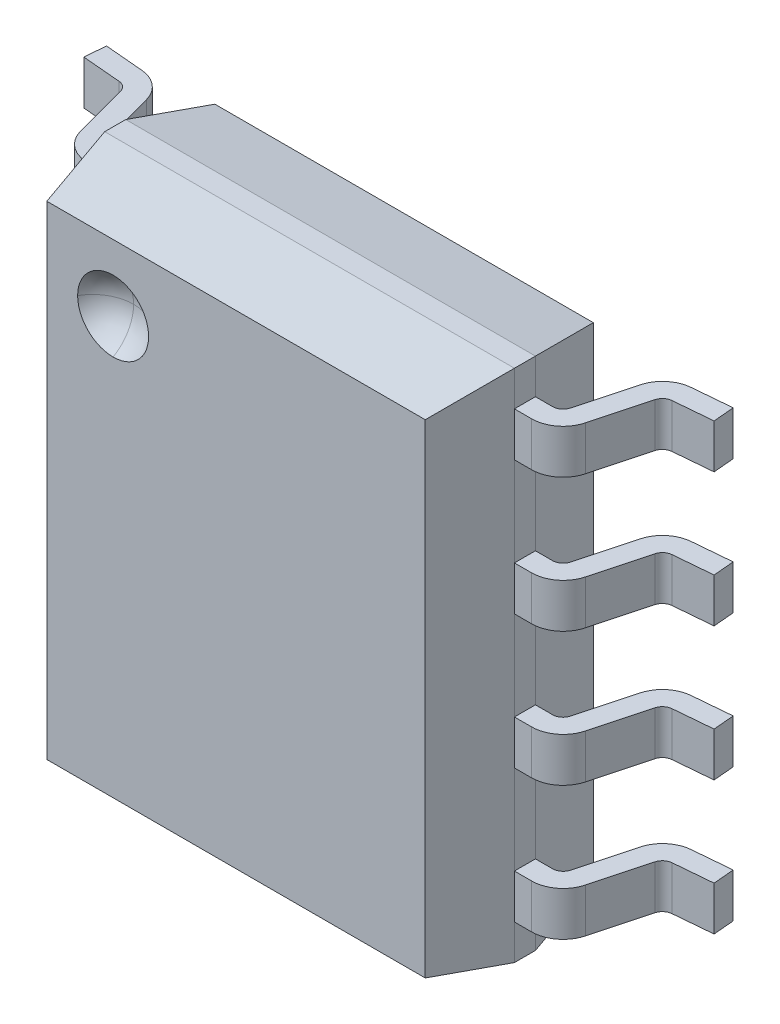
ISO-10303-21;
HEADER;
FILE_DESCRIPTION(('STEP AP214'),'2;1');
FILE_NAME('part.step','',(''),(''),'','','');
FILE_SCHEMA(('AUTOMOTIVE_DESIGN { 1 0 10303 214 1 1 1 1 }'));
ENDSEC;
DATA;
#1=APPLICATION_CONTEXT('core data for automotive mechanical design processes');
#2=APPLICATION_PROTOCOL_DEFINITION('international standard','automotive_design',2000,#1);
#3=PRODUCT_CONTEXT('',#1,'mechanical');
#4=PRODUCT('Part','Part','',(#3));
#5=PRODUCT_RELATED_PRODUCT_CATEGORY('part','',(#4));
#6=PRODUCT_DEFINITION_FORMATION('','',#4);
#7=PRODUCT_DEFINITION_CONTEXT('part definition',#1,'design');
#8=PRODUCT_DEFINITION('design','',#6,#7);
#9=PRODUCT_DEFINITION_SHAPE('','',#8);
#10=(LENGTH_UNIT() NAMED_UNIT(*) SI_UNIT(.MILLI.,.METRE.));
#11=(NAMED_UNIT(*) PLANE_ANGLE_UNIT() SI_UNIT($,.RADIAN.));
#12=(NAMED_UNIT(*) SI_UNIT($,.STERADIAN.) SOLID_ANGLE_UNIT());
#13=UNCERTAINTY_MEASURE_WITH_UNIT(LENGTH_MEASURE(1.E-05),#10,'distance_accuracy_value','');
#14=(GEOMETRIC_REPRESENTATION_CONTEXT(3) GLOBAL_UNCERTAINTY_ASSIGNED_CONTEXT((#13)) GLOBAL_UNIT_ASSIGNED_CONTEXT((#10,
#11,#12)) REPRESENTATION_CONTEXT('',''));
#15=CARTESIAN_POINT('',(0.,0.,0.));
#16=DIRECTION('',(0.,0.,1.));
#17=DIRECTION('',(1.,0.,0.));
#18=AXIS2_PLACEMENT_3D('',#15,#16,#17);
#19=CARTESIAN_POINT('',(6.83,15.57,1.945));
#20=DIRECTION('',(0.,-1.,0.));
#21=DIRECTION('',(0.,0.,1.));
#22=AXIS2_PLACEMENT_3D('',#19,#20,#21);
#23=SPHERICAL_SURFACE('',#22,0.39);
#24=CARTESIAN_POINT('',(6.83,15.57,1.945));
#25=DIRECTION('',(-1.,0.,0.));
#26=DIRECTION('',(0.,0.,1.));
#27=AXIS2_PLACEMENT_3D('',#24,#25,#26);
#28=CIRCLE('',#27,0.39);
#29=CARTESIAN_POINT('',(6.83,15.57,1.555));
#30=VERTEX_POINT('',#29);
#31=CARTESIAN_POINT('',(6.83,15.2322500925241,1.75));
#32=VERTEX_POINT('',#31);
#33=EDGE_CURVE('E2192',#30,#32,#28,.T.);
#34=ORIENTED_EDGE('',*,*,#33,.T.);
#35=CARTESIAN_POINT('',(6.83,15.57,1.75));
#36=DIRECTION('',(0.,0.,1.));
#37=DIRECTION('',(0.,1.,0.));
#38=AXIS2_PLACEMENT_3D('',#35,#36,#37);
#39=CIRCLE('',#38,0.337749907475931);
#40=CARTESIAN_POINT('',(7.16774990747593,15.57,1.75));
#41=VERTEX_POINT('',#40);
#42=EDGE_CURVE('E1761',#32,#41,#39,.T.);
#43=ORIENTED_EDGE('',*,*,#42,.T.);
#44=CARTESIAN_POINT('',(6.83,15.57,1.945));
#45=DIRECTION('',(0.,-1.,0.));
#46=DIRECTION('',(0.,0.,-1.));
#47=AXIS2_PLACEMENT_3D('',#44,#45,#46);
#48=CIRCLE('',#47,0.39);
#49=EDGE_CURVE('E2161',#30,#41,#48,.T.);
#50=ORIENTED_EDGE('',*,*,#49,.F.);
#51=EDGE_LOOP('',(#34,#43,#50));
#52=FACE_BOUND('',#51,.T.);
#53=ADVANCED_FACE('F18',(#52),#23,.F.);
#54=CARTESIAN_POINT('',(5.01743114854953,11.785,0.));
#55=DIRECTION('',(0.996194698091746,0.,0.0871557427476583));
#56=DIRECTION('',(0.,-1.,0.));
#57=AXIS2_PLACEMENT_3D('',#54,#55,#56);
#58=PLANE('',#57);
#59=DIRECTION('',(0.0871557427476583,0.,-0.996194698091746));
#60=VECTOR('',#59,1.);
#61=CARTESIAN_POINT('',(5.01743114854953,12.205,0.));
#62=LINE('',#61,#60);
#63=CARTESIAN_POINT('',(5.,12.205,0.199238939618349));
#64=VERTEX_POINT('',#63);
#65=CARTESIAN_POINT('',(5.01743114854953,12.205,0.));
#66=VERTEX_POINT('',#65);
#67=EDGE_CURVE('E1558',#64,#66,#62,.T.);
#68=ORIENTED_EDGE('',*,*,#67,.T.);
#69=DIRECTION('',(0.,1.,0.));
#70=VECTOR('',#69,1.);
#71=CARTESIAN_POINT('',(5.01743114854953,11.785,0.));
#72=LINE('',#71,#70);
#73=CARTESIAN_POINT('',(5.01743114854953,11.785,0.));
#74=VERTEX_POINT('',#73);
#75=EDGE_CURVE('E1027',#74,#66,#72,.T.);
#76=ORIENTED_EDGE('',*,*,#75,.F.);
#77=DIRECTION('',(0.0871557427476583,0.,-0.996194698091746));
#78=VECTOR('',#77,1.);
#79=CARTESIAN_POINT('',(5.01743114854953,11.785,0.));
#80=LINE('',#79,#78);
#81=CARTESIAN_POINT('',(5.,11.785,0.199238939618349));
#82=VERTEX_POINT('',#81);
#83=EDGE_CURVE('E1634',#82,#74,#80,.T.);
#84=ORIENTED_EDGE('',*,*,#83,.F.);
#85=DIRECTION('',(0.,1.,0.));
#86=VECTOR('',#85,1.);
#87=CARTESIAN_POINT('',(5.,11.785,0.199238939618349));
#88=LINE('',#87,#86);
#89=EDGE_CURVE('E11',#82,#64,#88,.T.);
#90=ORIENTED_EDGE('',*,*,#89,.T.);
#91=EDGE_LOOP('',(#68,#76,#84,#90));
#92=FACE_BOUND('',#91,.T.);
#93=ADVANCED_FACE('F1718',(#92),#58,.F.);
#94=CARTESIAN_POINT('',(5.,11.785,0.199238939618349));
#95=DIRECTION('',(0.0871557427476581,0.,-0.996194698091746));
#96=DIRECTION('',(0.,-1.,0.));
#97=AXIS2_PLACEMENT_3D('',#94,#95,#96);
#98=PLANE('',#97);
#99=DIRECTION('',(-0.996194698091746,0.,-0.0871557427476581));
#100=VECTOR('',#99,1.);
#101=CARTESIAN_POINT('',(5.,12.205,0.199238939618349));
#102=LINE('',#101,#100);
#103=CARTESIAN_POINT('',(5.36893782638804,12.205,0.231516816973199));
#104=VERTEX_POINT('',#103);
#105=EDGE_CURVE('E1553',#104,#64,#102,.T.);
#106=ORIENTED_EDGE('',*,*,#105,.T.);
#107=ORIENTED_EDGE('',*,*,#89,.F.);
#108=DIRECTION('',(-0.996194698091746,0.,-0.0871557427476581));
#109=VECTOR('',#108,1.);
#110=CARTESIAN_POINT('',(5.,11.785,0.199238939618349));
#111=LINE('',#110,#109);
#112=CARTESIAN_POINT('',(5.36893782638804,11.785,0.231516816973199));
#113=VERTEX_POINT('',#112);
#114=EDGE_CURVE('E1630',#113,#82,#111,.T.);
#115=ORIENTED_EDGE('',*,*,#114,.F.);
#116=DIRECTION('',(0.,1.,0.));
#117=VECTOR('',#116,1.);
#118=CARTESIAN_POINT('',(5.36893782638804,11.785,0.231516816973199));
#119=LINE('',#118,#117);
#120=EDGE_CURVE('E26',#113,#104,#119,.T.);
#121=ORIENTED_EDGE('',*,*,#120,.T.);
#122=EDGE_LOOP('',(#106,#107,#115,#121));
#123=FACE_BOUND('',#122,.T.);
#124=ADVANCED_FACE('F1707',(#123),#98,.F.);
#125=CARTESIAN_POINT('',(5.36022225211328,11.785,0.331136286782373));
#126=DIRECTION('',(0.,-1.,0.));
#127=DIRECTION('',(0.,0.,1.));
#128=AXIS2_PLACEMENT_3D('',#125,#126,#127);
#129=CYLINDRICAL_SURFACE('',#128,0.1);
#130=CARTESIAN_POINT('',(5.36022225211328,12.205,0.331136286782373));
#131=DIRECTION('',(0.,1.,0.));
#132=DIRECTION('',(0.,0.,-1.));
#133=AXIS2_PLACEMENT_3D('',#130,#131,#132);
#134=CIRCLE('',#133,0.1);
#135=CARTESIAN_POINT('',(5.45681483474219,12.205,0.305254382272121));
#136=VERTEX_POINT('',#135);
#137=EDGE_CURVE('E1557',#136,#104,#134,.T.);
#138=ORIENTED_EDGE('',*,*,#137,.T.);
#139=ORIENTED_EDGE('',*,*,#120,.F.);
#140=CARTESIAN_POINT('',(5.36022225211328,11.785,0.331136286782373));
#141=DIRECTION('',(0.,1.,0.));
#142=DIRECTION('',(0.,0.,-1.));
#143=AXIS2_PLACEMENT_3D('',#140,#141,#142);
#144=CIRCLE('',#143,0.1);
#145=CARTESIAN_POINT('',(5.45681483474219,11.785,0.305254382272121));
#146=VERTEX_POINT('',#145);
#147=EDGE_CURVE('E1626',#146,#113,#144,.T.);
#148=ORIENTED_EDGE('',*,*,#147,.F.);
#149=DIRECTION('',(0.,1.,0.));
#150=VECTOR('',#149,1.);
#151=CARTESIAN_POINT('',(5.45681483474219,11.785,0.305254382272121));
#152=LINE('',#151,#150);
#153=EDGE_CURVE('E50',#146,#136,#152,.T.);
#154=ORIENTED_EDGE('',*,*,#153,.T.);
#155=EDGE_LOOP('',(#138,#139,#148,#154));
#156=FACE_BOUND('',#155,.T.);
#157=ADVANCED_FACE('F1711',(#156),#129,.F.);
#158=CARTESIAN_POINT('',(5.45681483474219,11.785,0.305254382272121));
#159=DIRECTION('',(0.965925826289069,0.,-0.258819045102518));
#160=DIRECTION('',(0.,-1.,0.));
#161=AXIS2_PLACEMENT_3D('',#158,#159,#160);
#162=PLANE('',#161);
#163=DIRECTION('',(-0.258819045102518,0.,-0.965925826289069));
#164=VECTOR('',#163,1.);
#165=CARTESIAN_POINT('',(5.45681483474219,12.205,0.305254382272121));
#166=LINE('',#165,#164);
#167=CARTESIAN_POINT('',(5.59678917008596,12.205,0.827645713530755));
#168=VERTEX_POINT('',#167);
#169=EDGE_CURVE('E1635',#168,#136,#166,.T.);
#170=ORIENTED_EDGE('',*,*,#169,.T.);
#171=ORIENTED_EDGE('',*,*,#153,.F.);
#172=DIRECTION('',(-0.258819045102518,0.,-0.965925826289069));
#173=VECTOR('',#172,1.);
#174=CARTESIAN_POINT('',(5.45681483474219,11.785,0.305254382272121));
#175=LINE('',#174,#173);
#176=CARTESIAN_POINT('',(5.59678917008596,11.785,0.827645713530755));
#177=VERTEX_POINT('',#176);
#178=EDGE_CURVE('E1622',#177,#146,#175,.T.);
#179=ORIENTED_EDGE('',*,*,#178,.F.);
#180=DIRECTION('',(0.,1.,0.));
#181=VECTOR('',#180,1.);
#182=CARTESIAN_POINT('',(5.59678917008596,11.785,0.827645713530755));
#183=LINE('',#182,#181);
#184=EDGE_CURVE('E39',#177,#168,#183,.T.);
#185=ORIENTED_EDGE('',*,*,#184,.T.);
#186=EDGE_LOOP('',(#170,#171,#179,#185));
#187=FACE_BOUND('',#186,.T.);
#188=ADVANCED_FACE('F1725',(#187),#162,.F.);
#189=CARTESIAN_POINT('',(5.88656691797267,11.785,0.75));
#190=DIRECTION('',(0.,-1.,0.));
#191=DIRECTION('',(0.,0.,1.));
#192=AXIS2_PLACEMENT_3D('',#189,#190,#191);
#193=CYLINDRICAL_SURFACE('',#192,0.3);
#194=CARTESIAN_POINT('',(5.88656691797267,12.205,0.75));
#195=DIRECTION('',(0.,-1.,0.));
#196=DIRECTION('',(0.,0.,1.));
#197=AXIS2_PLACEMENT_3D('',#194,#195,#196);
#198=CIRCLE('',#197,0.3);
#199=CARTESIAN_POINT('',(5.88656691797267,12.205,1.05));
#200=VERTEX_POINT('',#199);
#201=EDGE_CURVE('E1638',#200,#168,#198,.T.);
#202=ORIENTED_EDGE('',*,*,#201,.T.);
#203=ORIENTED_EDGE('',*,*,#184,.F.);
#204=CARTESIAN_POINT('',(5.88656691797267,11.785,0.75));
#205=DIRECTION('',(0.,-1.,0.));
#206=DIRECTION('',(0.,0.,1.));
#207=AXIS2_PLACEMENT_3D('',#204,#205,#206);
#208=CIRCLE('',#207,0.3);
#209=CARTESIAN_POINT('',(5.88656691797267,11.785,1.05));
#210=VERTEX_POINT('',#209);
#211=EDGE_CURVE('E1618',#210,#177,#208,.T.);
#212=ORIENTED_EDGE('',*,*,#211,.F.);
#213=DIRECTION('',(0.,1.,0.));
#214=VECTOR('',#213,1.);
#215=CARTESIAN_POINT('',(5.88656691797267,11.785,1.05));
#216=LINE('',#215,#214);
#217=EDGE_CURVE('E1687',#210,#200,#216,.T.);
#218=ORIENTED_EDGE('',*,*,#217,.T.);
#219=EDGE_LOOP('',(#202,#203,#212,#218));
#220=FACE_BOUND('',#219,.T.);
#221=ADVANCED_FACE('F4288',(#220),#193,.T.);
#222=CARTESIAN_POINT('',(10.1134330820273,11.785,0.85));
#223=DIRECTION('',(0.,0.,1.));
#224=DIRECTION('',(1.,0.,0.));
#225=AXIS2_PLACEMENT_3D('',#222,#223,#224);
#226=PLANE('',#225);
#227=DIRECTION('',(0.,-1.,0.));
#228=VECTOR('',#227,1.);
#229=CARTESIAN_POINT('',(6.05,11.45,0.850000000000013));
#230=LINE('',#229,#228);
#231=CARTESIAN_POINT('',(6.05,12.205,0.850000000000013));
#232=VERTEX_POINT('',#231);
#233=CARTESIAN_POINT('',(6.05,11.785,0.850000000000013));
#234=VERTEX_POINT('',#233);
#235=EDGE_CURVE('E1830',#232,#234,#230,.T.);
#236=ORIENTED_EDGE('',*,*,#235,.T.);
#237=DIRECTION('',(1.,0.,0.));
#238=VECTOR('',#237,1.);
#239=CARTESIAN_POINT('',(10.1134330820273,11.785,0.85));
#240=LINE('',#239,#238);
#241=CARTESIAN_POINT('',(5.88656691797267,11.785,0.85));
#242=VERTEX_POINT('',#241);
#243=EDGE_CURVE('E1658',#242,#234,#240,.T.);
#244=ORIENTED_EDGE('',*,*,#243,.F.);
#245=DIRECTION('',(0.,1.,0.));
#246=VECTOR('',#245,1.);
#247=CARTESIAN_POINT('',(5.88656691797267,11.785,0.85));
#248=LINE('',#247,#246);
#249=CARTESIAN_POINT('',(5.88656691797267,12.205,0.85));
#250=VERTEX_POINT('',#249);
#251=EDGE_CURVE('E1696',#242,#250,#248,.T.);
#252=ORIENTED_EDGE('',*,*,#251,.T.);
#253=DIRECTION('',(1.,0.,0.));
#254=VECTOR('',#253,1.);
#255=CARTESIAN_POINT('',(10.1134330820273,12.205,0.85));
#256=LINE('',#255,#254);
#257=EDGE_CURVE('E1665',#250,#232,#256,.T.);
#258=ORIENTED_EDGE('',*,*,#257,.T.);
#259=EDGE_LOOP('',(#236,#244,#252,#258));
#260=FACE_BOUND('',#259,.T.);
#261=ADVANCED_FACE('F4283',(#260),#226,.F.);
#262=CARTESIAN_POINT('',(5.88656691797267,11.785,0.75));
#263=DIRECTION('',(0.,-1.,0.));
#264=DIRECTION('',(0.,0.,1.));
#265=AXIS2_PLACEMENT_3D('',#262,#263,#264);
#266=CYLINDRICAL_SURFACE('',#265,0.1);
#267=CARTESIAN_POINT('',(5.88656691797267,12.205,0.75));
#268=DIRECTION('',(0.,1.,0.));
#269=DIRECTION('',(0.,0.,-1.));
#270=AXIS2_PLACEMENT_3D('',#267,#268,#269);
#271=CIRCLE('',#270,0.1);
#272=CARTESIAN_POINT('',(5.78997433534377,12.205,0.775881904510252));
#273=VERTEX_POINT('',#272);
#274=EDGE_CURVE('E1668',#273,#250,#271,.T.);
#275=ORIENTED_EDGE('',*,*,#274,.T.);
#276=ORIENTED_EDGE('',*,*,#251,.F.);
#277=CARTESIAN_POINT('',(5.88656691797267,11.785,0.75));
#278=DIRECTION('',(0.,1.,0.));
#279=DIRECTION('',(0.,0.,-1.));
#280=AXIS2_PLACEMENT_3D('',#277,#278,#279);
#281=CIRCLE('',#280,0.1);
#282=CARTESIAN_POINT('',(5.78997433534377,11.785,0.775881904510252));
#283=VERTEX_POINT('',#282);
#284=EDGE_CURVE('E1654',#283,#242,#281,.T.);
#285=ORIENTED_EDGE('',*,*,#284,.F.);
#286=DIRECTION('',(0.,1.,0.));
#287=VECTOR('',#286,1.);
#288=CARTESIAN_POINT('',(5.78997433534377,11.785,0.775881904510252));
#289=LINE('',#288,#287);
#290=EDGE_CURVE('E1026',#283,#273,#289,.T.);
#291=ORIENTED_EDGE('',*,*,#290,.T.);
#292=EDGE_LOOP('',(#275,#276,#285,#291));
#293=FACE_BOUND('',#292,.T.);
#294=ADVANCED_FACE('F4287',(#293),#266,.F.);
#295=CARTESIAN_POINT('',(5.78997433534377,11.785,0.775881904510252));
#296=DIRECTION('',(-0.965925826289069,0.,0.258819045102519));
#297=DIRECTION('',(0.,1.,0.));
#298=AXIS2_PLACEMENT_3D('',#295,#296,#297);
#299=PLANE('',#298);
#300=DIRECTION('',(0.258819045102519,0.,0.965925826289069));
#301=VECTOR('',#300,1.);
#302=CARTESIAN_POINT('',(5.78997433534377,12.205,0.775881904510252));
#303=LINE('',#302,#301);
#304=CARTESIAN_POINT('',(5.65,12.205,0.253490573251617));
#305=VERTEX_POINT('',#304);
#306=EDGE_CURVE('E1669',#305,#273,#303,.T.);
#307=ORIENTED_EDGE('',*,*,#306,.T.);
#308=ORIENTED_EDGE('',*,*,#290,.F.);
#309=DIRECTION('',(0.258819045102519,0.,0.965925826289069));
#310=VECTOR('',#309,1.);
#311=CARTESIAN_POINT('',(5.78997433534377,11.785,0.775881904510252));
#312=LINE('',#311,#310);
#313=CARTESIAN_POINT('',(5.65,11.785,0.253490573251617));
#314=VERTEX_POINT('',#313);
#315=EDGE_CURVE('E1650',#314,#283,#312,.T.);
#316=ORIENTED_EDGE('',*,*,#315,.F.);
#317=DIRECTION('',(0.,1.,0.));
#318=VECTOR('',#317,1.);
#319=CARTESIAN_POINT('',(5.65,11.785,0.253490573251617));
#320=LINE('',#319,#318);
#321=EDGE_CURVE('E1023',#314,#305,#320,.T.);
#322=ORIENTED_EDGE('',*,*,#321,.T.);
#323=EDGE_LOOP('',(#307,#308,#316,#322));
#324=FACE_BOUND('',#323,.T.);
#325=ADVANCED_FACE('F4859',(#324),#299,.F.);
#326=CARTESIAN_POINT('',(5.36022225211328,11.785,0.331136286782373));
#327=DIRECTION('',(0.,-1.,0.));
#328=DIRECTION('',(0.,0.,1.));
#329=AXIS2_PLACEMENT_3D('',#326,#327,#328);
#330=CYLINDRICAL_SURFACE('',#329,0.3);
#331=CARTESIAN_POINT('',(5.36022225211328,12.205,0.331136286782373));
#332=DIRECTION('',(0.,-1.,0.));
#333=DIRECTION('',(0.,0.,1.));
#334=AXIS2_PLACEMENT_3D('',#331,#332,#333);
#335=CIRCLE('',#334,0.3);
#336=CARTESIAN_POINT('',(5.38636897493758,12.205,0.0322778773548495));
#337=VERTEX_POINT('',#336);
#338=EDGE_CURVE('E1673',#337,#305,#335,.T.);
#339=ORIENTED_EDGE('',*,*,#338,.T.);
#340=ORIENTED_EDGE('',*,*,#321,.F.);
#341=CARTESIAN_POINT('',(5.36022225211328,11.785,0.331136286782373));
#342=DIRECTION('',(0.,-1.,0.));
#343=DIRECTION('',(0.,0.,1.));
#344=AXIS2_PLACEMENT_3D('',#341,#342,#343);
#345=CIRCLE('',#344,0.3);
#346=CARTESIAN_POINT('',(5.38636897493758,11.785,0.0322778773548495));
#347=VERTEX_POINT('',#346);
#348=EDGE_CURVE('E1646',#347,#314,#345,.T.);
#349=ORIENTED_EDGE('',*,*,#348,.F.);
#350=DIRECTION('',(0.,1.,0.));
#351=VECTOR('',#350,1.);
#352=CARTESIAN_POINT('',(5.38636897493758,11.785,0.0322778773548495));
#353=LINE('',#352,#351);
#354=EDGE_CURVE('E1684',#347,#337,#353,.T.);
#355=ORIENTED_EDGE('',*,*,#354,.T.);
#356=EDGE_LOOP('',(#339,#340,#349,#355));
#357=FACE_BOUND('',#356,.T.);
#358=ADVANCED_FACE('F3864',(#357),#330,.T.);
#359=CARTESIAN_POINT('',(5.38636897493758,11.785,0.0322778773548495));
#360=DIRECTION('',(-0.0871557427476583,0.,0.996194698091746));
#361=DIRECTION('',(0.,1.,0.));
#362=AXIS2_PLACEMENT_3D('',#359,#360,#361);
#363=PLANE('',#362);
#364=DIRECTION('',(0.996194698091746,0.,0.0871557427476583));
#365=VECTOR('',#364,1.);
#366=CARTESIAN_POINT('',(5.38636897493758,12.205,0.0322778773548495));
#367=LINE('',#366,#365);
#368=EDGE_CURVE('E1677',#66,#337,#367,.T.);
#369=ORIENTED_EDGE('',*,*,#368,.T.);
#370=ORIENTED_EDGE('',*,*,#354,.F.);
#371=DIRECTION('',(0.996194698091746,0.,0.0871557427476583));
#372=VECTOR('',#371,1.);
#373=CARTESIAN_POINT('',(5.38636897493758,11.785,0.0322778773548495));
#374=LINE('',#373,#372);
#375=EDGE_CURVE('E1642',#74,#347,#374,.T.);
#376=ORIENTED_EDGE('',*,*,#375,.F.);
#377=ORIENTED_EDGE('',*,*,#75,.T.);
#378=EDGE_LOOP('',(#369,#370,#376,#377));
#379=FACE_BOUND('',#378,.T.);
#380=ADVANCED_FACE('F3859',(#379),#363,.F.);
#381=CARTESIAN_POINT('',(5.88656691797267,11.785,1.05));
#382=DIRECTION('',(0.,0.,-1.));
#383=DIRECTION('',(0.,-1.,0.));
#384=AXIS2_PLACEMENT_3D('',#381,#382,#383);
#385=PLANE('',#384);
#386=DIRECTION('',(0.,-1.,0.));
#387=VECTOR('',#386,1.);
#388=CARTESIAN_POINT('',(6.05,11.45,1.05));
#389=LINE('',#388,#387);
#390=CARTESIAN_POINT('',(6.05,12.205,1.05));
#391=VERTEX_POINT('',#390);
#392=CARTESIAN_POINT('',(6.05,11.785,1.05));
#393=VERTEX_POINT('',#392);
#394=EDGE_CURVE('E1733',#391,#393,#389,.T.);
#395=ORIENTED_EDGE('',*,*,#394,.F.);
#396=DIRECTION('',(-1.,0.,0.));
#397=VECTOR('',#396,1.);
#398=CARTESIAN_POINT('',(5.88656691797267,12.205,1.05));
#399=LINE('',#398,#397);
#400=EDGE_CURVE('E1661',#391,#200,#399,.T.);
#401=ORIENTED_EDGE('',*,*,#400,.T.);
#402=ORIENTED_EDGE('',*,*,#217,.F.);
#403=DIRECTION('',(-1.,0.,0.));
#404=VECTOR('',#403,1.);
#405=CARTESIAN_POINT('',(5.88656691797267,11.785,1.05));
#406=LINE('',#405,#404);
#407=EDGE_CURVE('E1614',#393,#210,#406,.T.);
#408=ORIENTED_EDGE('',*,*,#407,.F.);
#409=EDGE_LOOP('',(#395,#401,#402,#408));
#410=FACE_BOUND('',#409,.T.);
#411=ADVANCED_FACE('F1731',(#410),#385,.F.);
#412=CARTESIAN_POINT('',(5.36022225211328,12.205,0.331136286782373));
#413=DIRECTION('',(0.,-1.,0.));
#414=DIRECTION('',(-1.,0.,0.));
#415=AXIS2_PLACEMENT_3D('',#412,#413,#414);
#416=PLANE('',#415);
#417=ORIENTED_EDGE('',*,*,#400,.F.);
#418=DIRECTION('',(0.,0.,-1.));
#419=VECTOR('',#418,1.);
#420=CARTESIAN_POINT('',(6.05,12.205,1.75));
#421=LINE('',#420,#419);
#422=EDGE_CURVE('E1753',#391,#232,#421,.T.);
#423=ORIENTED_EDGE('',*,*,#422,.T.);
#424=ORIENTED_EDGE('',*,*,#257,.F.);
#425=ORIENTED_EDGE('',*,*,#274,.F.);
#426=ORIENTED_EDGE('',*,*,#306,.F.);
#427=ORIENTED_EDGE('',*,*,#338,.F.);
#428=ORIENTED_EDGE('',*,*,#368,.F.);
#429=ORIENTED_EDGE('',*,*,#67,.F.);
#430=ORIENTED_EDGE('',*,*,#105,.F.);
#431=ORIENTED_EDGE('',*,*,#137,.F.);
#432=ORIENTED_EDGE('',*,*,#169,.F.);
#433=ORIENTED_EDGE('',*,*,#201,.F.);
#434=EDGE_LOOP('',(#417,#423,#424,#425,#426,#427,#428,#429,#430,#431,#432,#433));
#435=FACE_BOUND('',#434,.T.);
#436=ADVANCED_FACE('F1714',(#435),#416,.F.);
#437=CARTESIAN_POINT('',(5.36022225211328,11.785,0.331136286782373));
#438=DIRECTION('',(0.,-1.,0.));
#439=DIRECTION('',(-1.,0.,0.));
#440=AXIS2_PLACEMENT_3D('',#437,#438,#439);
#441=PLANE('',#440);
#442=DIRECTION('',(0.,0.,-1.));
#443=VECTOR('',#442,1.);
#444=CARTESIAN_POINT('',(6.05,11.785,1.75));
#445=LINE('',#444,#443);
#446=EDGE_CURVE('E1959',#393,#234,#445,.T.);
#447=ORIENTED_EDGE('',*,*,#446,.F.);
#448=ORIENTED_EDGE('',*,*,#407,.T.);
#449=ORIENTED_EDGE('',*,*,#211,.T.);
#450=ORIENTED_EDGE('',*,*,#178,.T.);
#451=ORIENTED_EDGE('',*,*,#147,.T.);
#452=ORIENTED_EDGE('',*,*,#114,.T.);
#453=ORIENTED_EDGE('',*,*,#83,.T.);
#454=ORIENTED_EDGE('',*,*,#375,.T.);
#455=ORIENTED_EDGE('',*,*,#348,.T.);
#456=ORIENTED_EDGE('',*,*,#315,.T.);
#457=ORIENTED_EDGE('',*,*,#284,.T.);
#458=ORIENTED_EDGE('',*,*,#243,.T.);
#459=EDGE_LOOP('',(#447,#448,#449,#450,#451,#452,#453,#454,#455,#456,#457,#458));
#460=FACE_BOUND('',#459,.T.);
#461=ADVANCED_FACE('F1723',(#460),#441,.T.);
#462=CARTESIAN_POINT('',(5.36022225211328,11.785,0.331136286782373));
#463=DIRECTION('',(0.,-1.,0.));
#464=DIRECTION('',(-1.,0.,0.));
#465=AXIS2_PLACEMENT_3D('',#462,#463,#464);
#466=PLANE('',#465);
#467=DIRECTION('',(0.,0.,1.));
#468=VECTOR('',#467,1.);
#469=CARTESIAN_POINT('',(9.95,11.785,1.75));
#470=LINE('',#469,#468);
#471=CARTESIAN_POINT('',(9.95,11.785,0.850000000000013));
#472=VERTEX_POINT('',#471);
#473=CARTESIAN_POINT('',(9.95,11.785,1.05));
#474=VERTEX_POINT('',#473);
#475=EDGE_CURVE('E1899',#472,#474,#470,.T.);
#476=ORIENTED_EDGE('',*,*,#475,.F.);
#477=DIRECTION('',(1.,0.,0.));
#478=VECTOR('',#477,1.);
#479=CARTESIAN_POINT('',(10.1134330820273,11.785,0.85));
#480=LINE('',#479,#478);
#481=CARTESIAN_POINT('',(10.1134330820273,11.785,0.85));
#482=VERTEX_POINT('',#481);
#483=EDGE_CURVE('E1611',#472,#482,#480,.T.);
#484=ORIENTED_EDGE('',*,*,#483,.T.);
#485=CARTESIAN_POINT('',(10.1134330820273,11.785,0.75));
#486=DIRECTION('',(0.,1.,0.));
#487=DIRECTION('',(0.,0.,-1.));
#488=AXIS2_PLACEMENT_3D('',#485,#486,#487);
#489=CIRCLE('',#488,0.1);
#490=CARTESIAN_POINT('',(10.2100256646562,11.785,0.775881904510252));
#491=VERTEX_POINT('',#490);
#492=EDGE_CURVE('E1588',#482,#491,#489,.T.);
#493=ORIENTED_EDGE('',*,*,#492,.T.);
#494=DIRECTION('',(0.258819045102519,0.,-0.965925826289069));
#495=VECTOR('',#494,1.);
#496=CARTESIAN_POINT('',(10.35,11.785,0.253490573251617));
#497=LINE('',#496,#495);
#498=CARTESIAN_POINT('',(10.35,11.785,0.253490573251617));
#499=VERTEX_POINT('',#498);
#500=EDGE_CURVE('E1546',#491,#499,#497,.T.);
#501=ORIENTED_EDGE('',*,*,#500,.T.);
#502=CARTESIAN_POINT('',(10.6397777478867,11.785,0.331136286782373));
#503=DIRECTION('',(0.,-1.,0.));
#504=DIRECTION('',(0.,0.,1.));
#505=AXIS2_PLACEMENT_3D('',#502,#503,#504);
#506=CIRCLE('',#505,0.3);
#507=CARTESIAN_POINT('',(10.6136310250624,11.785,0.0322778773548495));
#508=VERTEX_POINT('',#507);
#509=EDGE_CURVE('E1535',#499,#508,#506,.T.);
#510=ORIENTED_EDGE('',*,*,#509,.T.);
#511=DIRECTION('',(0.996194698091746,0.,-0.0871557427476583));
#512=VECTOR('',#511,1.);
#513=CARTESIAN_POINT('',(10.9825688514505,11.785,0.));
#514=LINE('',#513,#512);
#515=CARTESIAN_POINT('',(10.9825688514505,11.785,0.));
#516=VERTEX_POINT('',#515);
#517=EDGE_CURVE('E1036',#508,#516,#514,.T.);
#518=ORIENTED_EDGE('',*,*,#517,.T.);
#519=DIRECTION('',(0.0871557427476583,0.,0.996194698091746));
#520=VECTOR('',#519,1.);
#521=CARTESIAN_POINT('',(11.,11.785,0.199238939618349));
#522=LINE('',#521,#520);
#523=CARTESIAN_POINT('',(11.,11.785,0.199238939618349));
#524=VERTEX_POINT('',#523);
#525=EDGE_CURVE('E1200',#516,#524,#522,.T.);
#526=ORIENTED_EDGE('',*,*,#525,.T.);
#527=DIRECTION('',(-0.996194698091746,0.,0.0871557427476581));
#528=VECTOR('',#527,1.);
#529=CARTESIAN_POINT('',(10.631062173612,11.785,0.231516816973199));
#530=LINE('',#529,#528);
#531=CARTESIAN_POINT('',(10.631062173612,11.785,0.231516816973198));
#532=VERTEX_POINT('',#531);
#533=EDGE_CURVE('E983',#524,#532,#530,.T.);
#534=ORIENTED_EDGE('',*,*,#533,.T.);
#535=CARTESIAN_POINT('',(10.6397777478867,11.785,0.331136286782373));
#536=DIRECTION('',(0.,1.,0.));
#537=DIRECTION('',(0.,0.,-1.));
#538=AXIS2_PLACEMENT_3D('',#535,#536,#537);
#539=CIRCLE('',#538,0.1);
#540=CARTESIAN_POINT('',(10.5431851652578,11.785,0.305254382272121));
#541=VERTEX_POINT('',#540);
#542=EDGE_CURVE('E1116',#532,#541,#539,.T.);
#543=ORIENTED_EDGE('',*,*,#542,.T.);
#544=DIRECTION('',(-0.258819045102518,0.,0.965925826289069));
#545=VECTOR('',#544,1.);
#546=CARTESIAN_POINT('',(10.403210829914,11.785,0.827645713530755));
#547=LINE('',#546,#545);
#548=CARTESIAN_POINT('',(10.403210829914,11.785,0.827645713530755));
#549=VERTEX_POINT('',#548);
#550=EDGE_CURVE('E1125',#541,#549,#547,.T.);
#551=ORIENTED_EDGE('',*,*,#550,.T.);
#552=CARTESIAN_POINT('',(10.1134330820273,11.785,0.75));
#553=DIRECTION('',(0.,-1.,0.));
#554=DIRECTION('',(0.,0.,1.));
#555=AXIS2_PLACEMENT_3D('',#552,#553,#554);
#556=CIRCLE('',#555,0.3);
#557=CARTESIAN_POINT('',(10.1134330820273,11.785,1.05));
#558=VERTEX_POINT('',#557);
#559=EDGE_CURVE('E1395',#549,#558,#556,.T.);
#560=ORIENTED_EDGE('',*,*,#559,.T.);
#561=DIRECTION('',(-1.,0.,0.));
#562=VECTOR('',#561,1.);
#563=CARTESIAN_POINT('',(5.88656691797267,11.785,1.05));
#564=LINE('',#563,#562);
#565=EDGE_CURVE('E1391',#558,#474,#564,.T.);
#566=ORIENTED_EDGE('',*,*,#565,.T.);
#567=EDGE_LOOP('',(#476,#484,#493,#501,#510,#518,#526,#534,#543,#551,#560,#566));
#568=FACE_BOUND('',#567,.T.);
#569=ADVANCED_FACE('F4299',(#568),#466,.T.);
#570=CARTESIAN_POINT('',(5.36022225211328,12.205,0.331136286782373));
#571=DIRECTION('',(0.,-1.,0.));
#572=DIRECTION('',(-1.,0.,0.));
#573=AXIS2_PLACEMENT_3D('',#570,#571,#572);
#574=PLANE('',#573);
#575=DIRECTION('',(1.,0.,0.));
#576=VECTOR('',#575,1.);
#577=CARTESIAN_POINT('',(10.1134330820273,12.205,0.85));
#578=LINE('',#577,#576);
#579=CARTESIAN_POINT('',(9.95,12.205,0.850000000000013));
#580=VERTEX_POINT('',#579);
#581=CARTESIAN_POINT('',(10.1134330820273,12.205,0.85));
#582=VERTEX_POINT('',#581);
#583=EDGE_CURVE('E1608',#580,#582,#578,.T.);
#584=ORIENTED_EDGE('',*,*,#583,.F.);
#585=DIRECTION('',(0.,0.,1.));
#586=VECTOR('',#585,1.);
#587=CARTESIAN_POINT('',(9.95,12.205,1.75));
#588=LINE('',#587,#586);
#589=CARTESIAN_POINT('',(9.95,12.205,1.05));
#590=VERTEX_POINT('',#589);
#591=EDGE_CURVE('E1784',#580,#590,#588,.T.);
#592=ORIENTED_EDGE('',*,*,#591,.T.);
#593=DIRECTION('',(-1.,0.,0.));
#594=VECTOR('',#593,1.);
#595=CARTESIAN_POINT('',(5.88656691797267,12.205,1.05));
#596=LINE('',#595,#594);
#597=CARTESIAN_POINT('',(10.1134330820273,12.205,1.05));
#598=VERTEX_POINT('',#597);
#599=EDGE_CURVE('E1394',#598,#590,#596,.T.);
#600=ORIENTED_EDGE('',*,*,#599,.F.);
#601=CARTESIAN_POINT('',(10.1134330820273,12.205,0.75));
#602=DIRECTION('',(0.,-1.,0.));
#603=DIRECTION('',(0.,0.,1.));
#604=AXIS2_PLACEMENT_3D('',#601,#602,#603);
#605=CIRCLE('',#604,0.3);
#606=CARTESIAN_POINT('',(10.403210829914,12.205,0.827645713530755));
#607=VERTEX_POINT('',#606);
#608=EDGE_CURVE('E1595',#607,#598,#605,.T.);
#609=ORIENTED_EDGE('',*,*,#608,.F.);
#610=DIRECTION('',(-0.258819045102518,0.,0.965925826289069));
#611=VECTOR('',#610,1.);
#612=CARTESIAN_POINT('',(10.403210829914,12.205,0.827645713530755));
#613=LINE('',#612,#611);
#614=CARTESIAN_POINT('',(10.5431851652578,12.205,0.305254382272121));
#615=VERTEX_POINT('',#614);
#616=EDGE_CURVE('E1120',#615,#607,#613,.T.);
#617=ORIENTED_EDGE('',*,*,#616,.F.);
#618=CARTESIAN_POINT('',(10.6397777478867,12.205,0.331136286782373));
#619=DIRECTION('',(0.,1.,0.));
#620=DIRECTION('',(0.,0.,-1.));
#621=AXIS2_PLACEMENT_3D('',#618,#619,#620);
#622=CIRCLE('',#621,0.1);
#623=CARTESIAN_POINT('',(10.631062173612,12.205,0.231516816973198));
#624=VERTEX_POINT('',#623);
#625=EDGE_CURVE('E1576',#624,#615,#622,.T.);
#626=ORIENTED_EDGE('',*,*,#625,.F.);
#627=DIRECTION('',(-0.996194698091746,0.,0.0871557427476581));
#628=VECTOR('',#627,1.);
#629=CARTESIAN_POINT('',(10.631062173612,12.205,0.231516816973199));
#630=LINE('',#629,#628);
#631=CARTESIAN_POINT('',(11.,12.205,0.199238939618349));
#632=VERTEX_POINT('',#631);
#633=EDGE_CURVE('E984',#632,#624,#630,.T.);
#634=ORIENTED_EDGE('',*,*,#633,.F.);
#635=DIRECTION('',(0.0871557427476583,0.,0.996194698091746));
#636=VECTOR('',#635,1.);
#637=CARTESIAN_POINT('',(11.,12.205,0.199238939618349));
#638=LINE('',#637,#636);
#639=CARTESIAN_POINT('',(10.9825688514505,12.205,0.));
#640=VERTEX_POINT('',#639);
#641=EDGE_CURVE('E1565',#640,#632,#638,.T.);
#642=ORIENTED_EDGE('',*,*,#641,.F.);
#643=DIRECTION('',(0.996194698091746,0.,-0.0871557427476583));
#644=VECTOR('',#643,1.);
#645=CARTESIAN_POINT('',(10.9825688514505,12.205,0.));
#646=LINE('',#645,#644);
#647=CARTESIAN_POINT('',(10.6136310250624,12.205,0.0322778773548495));
#648=VERTEX_POINT('',#647);
#649=EDGE_CURVE('E1037',#648,#640,#646,.T.);
#650=ORIENTED_EDGE('',*,*,#649,.F.);
#651=CARTESIAN_POINT('',(10.6397777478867,12.205,0.331136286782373));
#652=DIRECTION('',(0.,-1.,0.));
#653=DIRECTION('',(0.,0.,1.));
#654=AXIS2_PLACEMENT_3D('',#651,#652,#653);
#655=CIRCLE('',#654,0.3);
#656=CARTESIAN_POINT('',(10.35,12.205,0.253490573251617));
#657=VERTEX_POINT('',#656);
#658=EDGE_CURVE('E1482',#657,#648,#655,.T.);
#659=ORIENTED_EDGE('',*,*,#658,.F.);
#660=DIRECTION('',(0.258819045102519,0.,-0.965925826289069));
#661=VECTOR('',#660,1.);
#662=CARTESIAN_POINT('',(10.35,12.205,0.253490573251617));
#663=LINE('',#662,#661);
#664=CARTESIAN_POINT('',(10.2100256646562,12.205,0.775881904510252));
#665=VERTEX_POINT('',#664);
#666=EDGE_CURVE('E1538',#665,#657,#663,.T.);
#667=ORIENTED_EDGE('',*,*,#666,.F.);
#668=CARTESIAN_POINT('',(10.1134330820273,12.205,0.75));
#669=DIRECTION('',(0.,1.,0.));
#670=DIRECTION('',(0.,0.,-1.));
#671=AXIS2_PLACEMENT_3D('',#668,#669,#670);
#672=CIRCLE('',#671,0.1);
#673=EDGE_CURVE('E1129',#582,#665,#672,.T.);
#674=ORIENTED_EDGE('',*,*,#673,.F.);
#675=EDGE_LOOP('',(#584,#592,#600,#609,#617,#626,#634,#642,#650,#659,#667,#674));
#676=FACE_BOUND('',#675,.T.);
#677=ADVANCED_FACE('F4457',(#676),#574,.F.);
#678=CARTESIAN_POINT('',(10.1134330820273,11.785,0.85));
#679=DIRECTION('',(0.,0.,1.));
#680=DIRECTION('',(1.,0.,0.));
#681=AXIS2_PLACEMENT_3D('',#678,#679,#680);
#682=PLANE('',#681);
#683=DIRECTION('',(0.,-1.,0.));
#684=VECTOR('',#683,1.);
#685=CARTESIAN_POINT('',(9.95,11.45,0.85));
#686=LINE('',#685,#684);
#687=EDGE_CURVE('E2002',#580,#472,#686,.T.);
#688=ORIENTED_EDGE('',*,*,#687,.F.);
#689=ORIENTED_EDGE('',*,*,#583,.T.);
#690=DIRECTION('',(0.,1.,0.));
#691=VECTOR('',#690,1.);
#692=CARTESIAN_POINT('',(10.1134330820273,11.785,0.85));
#693=LINE('',#692,#691);
#694=EDGE_CURVE('E1591',#482,#582,#693,.T.);
#695=ORIENTED_EDGE('',*,*,#694,.F.);
#696=ORIENTED_EDGE('',*,*,#483,.F.);
#697=EDGE_LOOP('',(#688,#689,#695,#696));
#698=FACE_BOUND('',#697,.T.);
#699=ADVANCED_FACE('F4461',(#698),#682,.F.);
#700=CARTESIAN_POINT('',(5.88656691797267,11.785,1.05));
#701=DIRECTION('',(0.,0.,-1.));
#702=DIRECTION('',(0.,-1.,0.));
#703=AXIS2_PLACEMENT_3D('',#700,#701,#702);
#704=PLANE('',#703);
#705=DIRECTION('',(0.,-1.,0.));
#706=VECTOR('',#705,1.);
#707=CARTESIAN_POINT('',(9.95,11.45,1.05));
#708=LINE('',#707,#706);
#709=EDGE_CURVE('E1929',#590,#474,#708,.T.);
#710=ORIENTED_EDGE('',*,*,#709,.T.);
#711=ORIENTED_EDGE('',*,*,#565,.F.);
#712=DIRECTION('',(0.,1.,0.));
#713=VECTOR('',#712,1.);
#714=CARTESIAN_POINT('',(10.1134330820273,11.785,1.05));
#715=LINE('',#714,#713);
#716=EDGE_CURVE('E1599',#558,#598,#715,.T.);
#717=ORIENTED_EDGE('',*,*,#716,.T.);
#718=ORIENTED_EDGE('',*,*,#599,.T.);
#719=EDGE_LOOP('',(#710,#711,#717,#718));
#720=FACE_BOUND('',#719,.T.);
#721=ADVANCED_FACE('F4502',(#720),#704,.F.);
#722=CARTESIAN_POINT('',(10.1134330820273,11.785,0.75));
#723=DIRECTION('',(0.,-1.,0.));
#724=DIRECTION('',(0.,0.,1.));
#725=AXIS2_PLACEMENT_3D('',#722,#723,#724);
#726=CYLINDRICAL_SURFACE('',#725,0.3);
#727=ORIENTED_EDGE('',*,*,#608,.T.);
#728=ORIENTED_EDGE('',*,*,#716,.F.);
#729=ORIENTED_EDGE('',*,*,#559,.F.);
#730=DIRECTION('',(0.,1.,0.));
#731=VECTOR('',#730,1.);
#732=CARTESIAN_POINT('',(10.403210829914,11.785,0.827645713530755));
#733=LINE('',#732,#731);
#734=EDGE_CURVE('E1130',#549,#607,#733,.T.);
#735=ORIENTED_EDGE('',*,*,#734,.T.);
#736=EDGE_LOOP('',(#727,#728,#729,#735));
#737=FACE_BOUND('',#736,.T.);
#738=ADVANCED_FACE('F3741',(#737),#726,.T.);
#739=CARTESIAN_POINT('',(10.1134330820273,11.785,0.75));
#740=DIRECTION('',(0.,-1.,0.));
#741=DIRECTION('',(0.,0.,1.));
#742=AXIS2_PLACEMENT_3D('',#739,#740,#741);
#743=CYLINDRICAL_SURFACE('',#742,0.1);
#744=ORIENTED_EDGE('',*,*,#673,.T.);
#745=DIRECTION('',(0.,1.,0.));
#746=VECTOR('',#745,1.);
#747=CARTESIAN_POINT('',(10.2100256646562,11.785,0.775881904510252));
#748=LINE('',#747,#746);
#749=EDGE_CURVE('E1487',#491,#665,#748,.T.);
#750=ORIENTED_EDGE('',*,*,#749,.F.);
#751=ORIENTED_EDGE('',*,*,#492,.F.);
#752=ORIENTED_EDGE('',*,*,#694,.T.);
#753=EDGE_LOOP('',(#744,#750,#751,#752));
#754=FACE_BOUND('',#753,.T.);
#755=ADVANCED_FACE('F3737',(#754),#743,.F.);
#756=CARTESIAN_POINT('',(10.403210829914,11.785,0.827645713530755));
#757=DIRECTION('',(-0.965925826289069,0.,-0.258819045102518));
#758=DIRECTION('',(-0.258819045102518,0.,0.965925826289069));
#759=AXIS2_PLACEMENT_3D('',#756,#757,#758);
#760=PLANE('',#759);
#761=ORIENTED_EDGE('',*,*,#616,.T.);
#762=ORIENTED_EDGE('',*,*,#734,.F.);
#763=ORIENTED_EDGE('',*,*,#550,.F.);
#764=DIRECTION('',(0.,1.,0.));
#765=VECTOR('',#764,1.);
#766=CARTESIAN_POINT('',(10.5431851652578,11.785,0.305254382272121));
#767=LINE('',#766,#765);
#768=EDGE_CURVE('E1121',#541,#615,#767,.T.);
#769=ORIENTED_EDGE('',*,*,#768,.T.);
#770=EDGE_LOOP('',(#761,#762,#763,#769));
#771=FACE_BOUND('',#770,.T.);
#772=ADVANCED_FACE('F3729',(#771),#760,.F.);
#773=CARTESIAN_POINT('',(10.6397777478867,11.785,0.331136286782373));
#774=DIRECTION('',(0.,-1.,0.));
#775=DIRECTION('',(0.,0.,1.));
#776=AXIS2_PLACEMENT_3D('',#773,#774,#775);
#777=CYLINDRICAL_SURFACE('',#776,0.1);
#778=ORIENTED_EDGE('',*,*,#625,.T.);
#779=ORIENTED_EDGE('',*,*,#768,.F.);
#780=ORIENTED_EDGE('',*,*,#542,.F.);
#781=DIRECTION('',(0.,1.,0.));
#782=VECTOR('',#781,1.);
#783=CARTESIAN_POINT('',(10.631062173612,11.785,0.231516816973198));
#784=LINE('',#783,#782);
#785=EDGE_CURVE('E979',#532,#624,#784,.T.);
#786=ORIENTED_EDGE('',*,*,#785,.T.);
#787=EDGE_LOOP('',(#778,#779,#780,#786));
#788=FACE_BOUND('',#787,.T.);
#789=ADVANCED_FACE('F3723',(#788),#777,.F.);
#790=CARTESIAN_POINT('',(10.631062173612,11.785,0.231516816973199));
#791=DIRECTION('',(-0.0871557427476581,0.,-0.996194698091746));
#792=DIRECTION('',(-0.996194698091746,0.,0.0871557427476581));
#793=AXIS2_PLACEMENT_3D('',#790,#791,#792);
#794=PLANE('',#793);
#795=ORIENTED_EDGE('',*,*,#633,.T.);
#796=ORIENTED_EDGE('',*,*,#785,.F.);
#797=ORIENTED_EDGE('',*,*,#533,.F.);
#798=DIRECTION('',(0.,1.,0.));
#799=VECTOR('',#798,1.);
#800=CARTESIAN_POINT('',(11.,11.785,0.199238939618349));
#801=LINE('',#800,#799);
#802=EDGE_CURVE('E1569',#524,#632,#801,.T.);
#803=ORIENTED_EDGE('',*,*,#802,.T.);
#804=EDGE_LOOP('',(#795,#796,#797,#803));
#805=FACE_BOUND('',#804,.T.);
#806=ADVANCED_FACE('F3728',(#805),#794,.F.);
#807=CARTESIAN_POINT('',(11.,11.785,0.199238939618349));
#808=DIRECTION('',(-0.996194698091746,0.,0.0871557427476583));
#809=DIRECTION('',(0.,1.,0.));
#810=AXIS2_PLACEMENT_3D('',#807,#808,#809);
#811=PLANE('',#810);
#812=ORIENTED_EDGE('',*,*,#641,.T.);
#813=ORIENTED_EDGE('',*,*,#802,.F.);
#814=ORIENTED_EDGE('',*,*,#525,.F.);
#815=DIRECTION('',(0.,1.,0.));
#816=VECTOR('',#815,1.);
#817=CARTESIAN_POINT('',(10.9825688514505,11.785,0.));
#818=LINE('',#817,#816);
#819=EDGE_CURVE('E1032',#516,#640,#818,.T.);
#820=ORIENTED_EDGE('',*,*,#819,.T.);
#821=EDGE_LOOP('',(#812,#813,#814,#820));
#822=FACE_BOUND('',#821,.T.);
#823=ADVANCED_FACE('F4373',(#822),#811,.F.);
#824=CARTESIAN_POINT('',(10.9825688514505,11.785,0.));
#825=DIRECTION('',(0.0871557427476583,0.,0.996194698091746));
#826=DIRECTION('',(0.,-1.,0.));
#827=AXIS2_PLACEMENT_3D('',#824,#825,#826);
#828=PLANE('',#827);
#829=ORIENTED_EDGE('',*,*,#649,.T.);
#830=ORIENTED_EDGE('',*,*,#819,.F.);
#831=ORIENTED_EDGE('',*,*,#517,.F.);
#832=DIRECTION('',(0.,1.,0.));
#833=VECTOR('',#832,1.);
#834=CARTESIAN_POINT('',(10.6136310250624,11.785,0.0322778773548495));
#835=LINE('',#834,#833);
#836=EDGE_CURVE('E1486',#508,#648,#835,.T.);
#837=ORIENTED_EDGE('',*,*,#836,.T.);
#838=EDGE_LOOP('',(#829,#830,#831,#837));
#839=FACE_BOUND('',#838,.T.);
#840=ADVANCED_FACE('F4362',(#839),#828,.F.);
#841=CARTESIAN_POINT('',(10.6397777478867,11.785,0.331136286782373));
#842=DIRECTION('',(0.,-1.,0.));
#843=DIRECTION('',(0.,0.,1.));
#844=AXIS2_PLACEMENT_3D('',#841,#842,#843);
#845=CYLINDRICAL_SURFACE('',#844,0.3);
#846=ORIENTED_EDGE('',*,*,#658,.T.);
#847=ORIENTED_EDGE('',*,*,#836,.F.);
#848=ORIENTED_EDGE('',*,*,#509,.F.);
#849=DIRECTION('',(0.,1.,0.));
#850=VECTOR('',#849,1.);
#851=CARTESIAN_POINT('',(10.35,11.785,0.253490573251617));
#852=LINE('',#851,#850);
#853=EDGE_CURVE('E1542',#499,#657,#852,.T.);
#854=ORIENTED_EDGE('',*,*,#853,.T.);
#855=EDGE_LOOP('',(#846,#847,#848,#854));
#856=FACE_BOUND('',#855,.T.);
#857=ADVANCED_FACE('F4357',(#856),#845,.T.);
#858=CARTESIAN_POINT('',(10.35,11.785,0.253490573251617));
#859=DIRECTION('',(0.965925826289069,0.,0.258819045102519));
#860=DIRECTION('',(0.,-1.,0.));
#861=AXIS2_PLACEMENT_3D('',#858,#859,#860);
#862=PLANE('',#861);
#863=ORIENTED_EDGE('',*,*,#666,.T.);
#864=ORIENTED_EDGE('',*,*,#853,.F.);
#865=ORIENTED_EDGE('',*,*,#500,.F.);
#866=ORIENTED_EDGE('',*,*,#749,.T.);
#867=EDGE_LOOP('',(#863,#864,#865,#866));
#868=FACE_BOUND('',#867,.T.);
#869=ADVANCED_FACE('F4361',(#868),#862,.F.);
#870=CARTESIAN_POINT('',(5.01743114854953,13.055,0.));
#871=DIRECTION('',(0.996194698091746,0.,0.0871557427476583));
#872=DIRECTION('',(0.,-1.,0.));
#873=AXIS2_PLACEMENT_3D('',#870,#871,#872);
#874=PLANE('',#873);
#875=DIRECTION('',(0.0871557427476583,0.,-0.996194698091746));
#876=VECTOR('',#875,1.);
#877=CARTESIAN_POINT('',(5.01743114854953,13.475,0.));
#878=LINE('',#877,#876);
#879=CARTESIAN_POINT('',(5.,13.475,0.199238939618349));
#880=VERTEX_POINT('',#879);
#881=CARTESIAN_POINT('',(5.01743114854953,13.475,0.));
#882=VERTEX_POINT('',#881);
#883=EDGE_CURVE('E1495',#880,#882,#878,.T.);
#884=ORIENTED_EDGE('',*,*,#883,.T.);
#885=DIRECTION('',(0.,1.,0.));
#886=VECTOR('',#885,1.);
#887=CARTESIAN_POINT('',(5.01743114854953,13.055,0.));
#888=LINE('',#887,#886);
#889=CARTESIAN_POINT('',(5.01743114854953,13.055,0.));
#890=VERTEX_POINT('',#889);
#891=EDGE_CURVE('E1515',#890,#882,#888,.T.);
#892=ORIENTED_EDGE('',*,*,#891,.F.);
#893=DIRECTION('',(0.0871557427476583,0.,-0.996194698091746));
#894=VECTOR('',#893,1.);
#895=CARTESIAN_POINT('',(5.01743114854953,13.055,0.));
#896=LINE('',#895,#894);
#897=CARTESIAN_POINT('',(5.,13.055,0.199238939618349));
#898=VERTEX_POINT('',#897);
#899=EDGE_CURVE('E1453',#898,#890,#896,.T.);
#900=ORIENTED_EDGE('',*,*,#899,.F.);
#901=DIRECTION('',(0.,1.,0.));
#902=VECTOR('',#901,1.);
#903=CARTESIAN_POINT('',(5.,13.055,0.199238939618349));
#904=LINE('',#903,#902);
#905=EDGE_CURVE('E1333',#898,#880,#904,.T.);
#906=ORIENTED_EDGE('',*,*,#905,.T.);
#907=EDGE_LOOP('',(#884,#892,#900,#906));
#908=FACE_BOUND('',#907,.T.);
#909=ADVANCED_FACE('F4391',(#908),#874,.F.);
#910=CARTESIAN_POINT('',(5.,13.055,0.199238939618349));
#911=DIRECTION('',(0.0871557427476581,0.,-0.996194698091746));
#912=DIRECTION('',(0.,-1.,0.));
#913=AXIS2_PLACEMENT_3D('',#910,#911,#912);
#914=PLANE('',#913);
#915=DIRECTION('',(-0.996194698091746,0.,-0.0871557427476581));
#916=VECTOR('',#915,1.);
#917=CARTESIAN_POINT('',(5.,13.475,0.199238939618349));
#918=LINE('',#917,#916);
#919=CARTESIAN_POINT('',(5.36893782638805,13.475,0.231516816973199));
#920=VERTEX_POINT('',#919);
#921=EDGE_CURVE('E1499',#920,#880,#918,.T.);
#922=ORIENTED_EDGE('',*,*,#921,.T.);
#923=ORIENTED_EDGE('',*,*,#905,.F.);
#924=DIRECTION('',(-0.996194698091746,0.,-0.0871557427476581));
#925=VECTOR('',#924,1.);
#926=CARTESIAN_POINT('',(5.,13.055,0.199238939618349));
#927=LINE('',#926,#925);
#928=CARTESIAN_POINT('',(5.36893782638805,13.055,0.231516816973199));
#929=VERTEX_POINT('',#928);
#930=EDGE_CURVE('E1449',#929,#898,#927,.T.);
#931=ORIENTED_EDGE('',*,*,#930,.F.);
#932=DIRECTION('',(0.,1.,0.));
#933=VECTOR('',#932,1.);
#934=CARTESIAN_POINT('',(5.36893782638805,13.055,0.231516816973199));
#935=LINE('',#934,#933);
#936=EDGE_CURVE('E1330',#929,#920,#935,.T.);
#937=ORIENTED_EDGE('',*,*,#936,.T.);
#938=EDGE_LOOP('',(#922,#923,#931,#937));
#939=FACE_BOUND('',#938,.T.);
#940=ADVANCED_FACE('F4395',(#939),#914,.F.);
#941=CARTESIAN_POINT('',(5.36022225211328,13.055,0.331136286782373));
#942=DIRECTION('',(0.,-1.,0.));
#943=DIRECTION('',(0.,0.,1.));
#944=AXIS2_PLACEMENT_3D('',#941,#942,#943);
#945=CYLINDRICAL_SURFACE('',#944,0.1);
#946=CARTESIAN_POINT('',(5.36022225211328,13.475,0.331136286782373));
#947=DIRECTION('',(0.,1.,0.));
#948=DIRECTION('',(0.,0.,-1.));
#949=AXIS2_PLACEMENT_3D('',#946,#947,#948);
#950=CIRCLE('',#949,0.1);
#951=CARTESIAN_POINT('',(5.45681483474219,13.475,0.305254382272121));
#952=VERTEX_POINT('',#951);
#953=EDGE_CURVE('E1263',#952,#920,#950,.T.);
#954=ORIENTED_EDGE('',*,*,#953,.T.);
#955=ORIENTED_EDGE('',*,*,#936,.F.);
#956=CARTESIAN_POINT('',(5.36022225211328,13.055,0.331136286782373));
#957=DIRECTION('',(0.,1.,0.));
#958=DIRECTION('',(0.,0.,-1.));
#959=AXIS2_PLACEMENT_3D('',#956,#957,#958);
#960=CIRCLE('',#959,0.1);
#961=CARTESIAN_POINT('',(5.45681483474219,13.055,0.305254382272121));
#962=VERTEX_POINT('',#961);
#963=EDGE_CURVE('E1327',#962,#929,#960,.T.);
#964=ORIENTED_EDGE('',*,*,#963,.F.);
#965=DIRECTION('',(0.,1.,0.));
#966=VECTOR('',#965,1.);
#967=CARTESIAN_POINT('',(5.45681483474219,13.055,0.305254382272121));
#968=LINE('',#967,#966);
#969=EDGE_CURVE('E1334',#962,#952,#968,.T.);
#970=ORIENTED_EDGE('',*,*,#969,.T.);
#971=EDGE_LOOP('',(#954,#955,#964,#970));
#972=FACE_BOUND('',#971,.T.);
#973=ADVANCED_FACE('F4523',(#972),#945,.F.);
#974=CARTESIAN_POINT('',(5.45681483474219,13.055,0.305254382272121));
#975=DIRECTION('',(0.965925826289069,0.,-0.258819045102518));
#976=DIRECTION('',(0.,-1.,0.));
#977=AXIS2_PLACEMENT_3D('',#974,#975,#976);
#978=PLANE('',#977);
#979=DIRECTION('',(-0.258819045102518,0.,-0.965925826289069));
#980=VECTOR('',#979,1.);
#981=CARTESIAN_POINT('',(5.45681483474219,13.475,0.305254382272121));
#982=LINE('',#981,#980);
#983=CARTESIAN_POINT('',(5.59678917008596,13.475,0.827645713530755));
#984=VERTEX_POINT('',#983);
#985=EDGE_CURVE('E1258',#984,#952,#982,.T.);
#986=ORIENTED_EDGE('',*,*,#985,.T.);
#987=ORIENTED_EDGE('',*,*,#969,.F.);
#988=DIRECTION('',(-0.258819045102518,0.,-0.965925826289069));
#989=VECTOR('',#988,1.);
#990=CARTESIAN_POINT('',(5.45681483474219,13.055,0.305254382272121));
#991=LINE('',#990,#989);
#992=CARTESIAN_POINT('',(5.59678917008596,13.055,0.827645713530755));
#993=VERTEX_POINT('',#992);
#994=EDGE_CURVE('E1323',#993,#962,#991,.T.);
#995=ORIENTED_EDGE('',*,*,#994,.F.);
#996=DIRECTION('',(0.,1.,0.));
#997=VECTOR('',#996,1.);
#998=CARTESIAN_POINT('',(5.59678917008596,13.055,0.827645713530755));
#999=LINE('',#998,#997);
#1000=EDGE_CURVE('E1527',#993,#984,#999,.T.);
#1001=ORIENTED_EDGE('',*,*,#1000,.T.);
#1002=EDGE_LOOP('',(#986,#987,#995,#1001));
#1003=FACE_BOUND('',#1002,.T.);
#1004=ADVANCED_FACE('F4017',(#1003),#978,.F.);
#1005=CARTESIAN_POINT('',(5.88656691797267,13.055,0.75));
#1006=DIRECTION('',(0.,-1.,0.));
#1007=DIRECTION('',(0.,0.,1.));
#1008=AXIS2_PLACEMENT_3D('',#1005,#1006,#1007);
#1009=CYLINDRICAL_SURFACE('',#1008,0.3);
#1010=CARTESIAN_POINT('',(5.88656691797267,13.475,0.75));
#1011=DIRECTION('',(0.,-1.,0.));
#1012=DIRECTION('',(0.,0.,1.));
#1013=AXIS2_PLACEMENT_3D('',#1010,#1011,#1012);
#1014=CIRCLE('',#1013,0.3);
#1015=CARTESIAN_POINT('',(5.88656691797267,13.475,1.05));
#1016=VERTEX_POINT('',#1015);
#1017=EDGE_CURVE('E1262',#1016,#984,#1014,.T.);
#1018=ORIENTED_EDGE('',*,*,#1017,.T.);
#1019=ORIENTED_EDGE('',*,*,#1000,.F.);
#1020=CARTESIAN_POINT('',(5.88656691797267,13.055,0.75));
#1021=DIRECTION('',(0.,-1.,0.));
#1022=DIRECTION('',(0.,0.,1.));
#1023=AXIS2_PLACEMENT_3D('',#1020,#1021,#1022);
#1024=CIRCLE('',#1023,0.3);
#1025=CARTESIAN_POINT('',(5.88656691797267,13.055,1.05));
#1026=VERTEX_POINT('',#1025);
#1027=EDGE_CURVE('E1249',#1026,#993,#1024,.T.);
#1028=ORIENTED_EDGE('',*,*,#1027,.F.);
#1029=DIRECTION('',(0.,1.,0.));
#1030=VECTOR('',#1029,1.);
#1031=CARTESIAN_POINT('',(5.88656691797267,13.055,1.05));
#1032=LINE('',#1031,#1030);
#1033=EDGE_CURVE('E1509',#1026,#1016,#1032,.T.);
#1034=ORIENTED_EDGE('',*,*,#1033,.T.);
#1035=EDGE_LOOP('',(#1018,#1019,#1028,#1034));
#1036=FACE_BOUND('',#1035,.T.);
#1037=ADVANCED_FACE('F4011',(#1036),#1009,.T.);
#1038=CARTESIAN_POINT('',(10.1134330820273,13.055,0.85));
#1039=DIRECTION('',(0.,0.,1.));
#1040=DIRECTION('',(1.,0.,0.));
#1041=AXIS2_PLACEMENT_3D('',#1038,#1039,#1040);
#1042=PLANE('',#1041);
#1043=DIRECTION('',(0.,-1.,0.));
#1044=VECTOR('',#1043,1.);
#1045=CARTESIAN_POINT('',(6.05,11.45,0.850000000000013));
#1046=LINE('',#1045,#1044);
#1047=CARTESIAN_POINT('',(6.05,13.475,0.850000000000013));
#1048=VERTEX_POINT('',#1047);
#1049=CARTESIAN_POINT('',(6.05,13.055,0.850000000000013));
#1050=VERTEX_POINT('',#1049);
#1051=EDGE_CURVE('E1825',#1048,#1050,#1046,.T.);
#1052=ORIENTED_EDGE('',*,*,#1051,.T.);
#1053=DIRECTION('',(1.,0.,0.));
#1054=VECTOR('',#1053,1.);
#1055=CARTESIAN_POINT('',(10.1134330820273,13.055,0.85));
#1056=LINE('',#1055,#1054);
#1057=CARTESIAN_POINT('',(5.88656691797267,13.055,0.85));
#1058=VERTEX_POINT('',#1057);
#1059=EDGE_CURVE('E1473',#1058,#1050,#1056,.T.);
#1060=ORIENTED_EDGE('',*,*,#1059,.F.);
#1061=DIRECTION('',(0.,1.,0.));
#1062=VECTOR('',#1061,1.);
#1063=CARTESIAN_POINT('',(5.88656691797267,13.055,0.85));
#1064=LINE('',#1063,#1062);
#1065=CARTESIAN_POINT('',(5.88656691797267,13.475,0.85));
#1066=VERTEX_POINT('',#1065);
#1067=EDGE_CURVE('E1524',#1058,#1066,#1064,.T.);
#1068=ORIENTED_EDGE('',*,*,#1067,.T.);
#1069=DIRECTION('',(1.,0.,0.));
#1070=VECTOR('',#1069,1.);
#1071=CARTESIAN_POINT('',(10.1134330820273,13.475,0.85));
#1072=LINE('',#1071,#1070);
#1073=EDGE_CURVE('E1161',#1066,#1048,#1072,.T.);
#1074=ORIENTED_EDGE('',*,*,#1073,.T.);
#1075=EDGE_LOOP('',(#1052,#1060,#1068,#1074));
#1076=FACE_BOUND('',#1075,.T.);
#1077=ADVANCED_FACE('F4016',(#1076),#1042,.F.);
#1078=CARTESIAN_POINT('',(5.88656691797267,13.055,0.75));
#1079=DIRECTION('',(0.,-1.,0.));
#1080=DIRECTION('',(0.,0.,1.));
#1081=AXIS2_PLACEMENT_3D('',#1078,#1079,#1080);
#1082=CYLINDRICAL_SURFACE('',#1081,0.1);
#1083=CARTESIAN_POINT('',(5.88656691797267,13.475,0.75));
#1084=DIRECTION('',(0.,1.,0.));
#1085=DIRECTION('',(0.,0.,-1.));
#1086=AXIS2_PLACEMENT_3D('',#1083,#1084,#1085);
#1087=CIRCLE('',#1086,0.1);
#1088=CARTESIAN_POINT('',(5.78997433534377,13.475,0.775881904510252));
#1089=VERTEX_POINT('',#1088);
#1090=EDGE_CURVE('E1156',#1089,#1066,#1087,.T.);
#1091=ORIENTED_EDGE('',*,*,#1090,.T.);
#1092=ORIENTED_EDGE('',*,*,#1067,.F.);
#1093=CARTESIAN_POINT('',(5.88656691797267,13.055,0.75));
#1094=DIRECTION('',(0.,1.,0.));
#1095=DIRECTION('',(0.,0.,-1.));
#1096=AXIS2_PLACEMENT_3D('',#1093,#1094,#1095);
#1097=CIRCLE('',#1096,0.1);
#1098=CARTESIAN_POINT('',(5.78997433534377,13.055,0.775881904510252));
#1099=VERTEX_POINT('',#1098);
#1100=EDGE_CURVE('E1469',#1099,#1058,#1097,.T.);
#1101=ORIENTED_EDGE('',*,*,#1100,.F.);
#1102=DIRECTION('',(0.,1.,0.));
#1103=VECTOR('',#1102,1.);
#1104=CARTESIAN_POINT('',(5.78997433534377,13.055,0.775881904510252));
#1105=LINE('',#1104,#1103);
#1106=EDGE_CURVE('E1521',#1099,#1089,#1105,.T.);
#1107=ORIENTED_EDGE('',*,*,#1106,.T.);
#1108=EDGE_LOOP('',(#1091,#1092,#1101,#1107));
#1109=FACE_BOUND('',#1108,.T.);
#1110=ADVANCED_FACE('F4658',(#1109),#1082,.F.);
#1111=CARTESIAN_POINT('',(5.78997433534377,13.055,0.775881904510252));
#1112=DIRECTION('',(-0.965925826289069,0.,0.258819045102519));
#1113=DIRECTION('',(0.,1.,0.));
#1114=AXIS2_PLACEMENT_3D('',#1111,#1112,#1113);
#1115=PLANE('',#1114);
#1116=DIRECTION('',(0.258819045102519,0.,0.965925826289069));
#1117=VECTOR('',#1116,1.);
#1118=CARTESIAN_POINT('',(5.78997433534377,13.475,0.775881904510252));
#1119=LINE('',#1118,#1117);
#1120=CARTESIAN_POINT('',(5.65,13.475,0.253490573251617));
#1121=VERTEX_POINT('',#1120);
#1122=EDGE_CURVE('E1160',#1121,#1089,#1119,.T.);
#1123=ORIENTED_EDGE('',*,*,#1122,.T.);
#1124=ORIENTED_EDGE('',*,*,#1106,.F.);
#1125=DIRECTION('',(0.258819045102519,0.,0.965925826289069));
#1126=VECTOR('',#1125,1.);
#1127=CARTESIAN_POINT('',(5.78997433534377,13.055,0.775881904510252));
#1128=LINE('',#1127,#1126);
#1129=CARTESIAN_POINT('',(5.65,13.055,0.253490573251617));
#1130=VERTEX_POINT('',#1129);
#1131=EDGE_CURVE('E1465',#1130,#1099,#1128,.T.);
#1132=ORIENTED_EDGE('',*,*,#1131,.F.);
#1133=DIRECTION('',(0.,1.,0.));
#1134=VECTOR('',#1133,1.);
#1135=CARTESIAN_POINT('',(5.65,13.055,0.253490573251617));
#1136=LINE('',#1135,#1134);
#1137=EDGE_CURVE('E1518',#1130,#1121,#1136,.T.);
#1138=ORIENTED_EDGE('',*,*,#1137,.T.);
#1139=EDGE_LOOP('',(#1123,#1124,#1132,#1138));
#1140=FACE_BOUND('',#1139,.T.);
#1141=ADVANCED_FACE('F3958',(#1140),#1115,.F.);
#1142=CARTESIAN_POINT('',(5.36022225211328,13.055,0.331136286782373));
#1143=DIRECTION('',(0.,-1.,0.));
#1144=DIRECTION('',(0.,0.,1.));
#1145=AXIS2_PLACEMENT_3D('',#1142,#1143,#1144);
#1146=CYLINDRICAL_SURFACE('',#1145,0.3);
#1147=CARTESIAN_POINT('',(5.36022225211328,13.475,0.331136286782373));
#1148=DIRECTION('',(0.,-1.,0.));
#1149=DIRECTION('',(0.,0.,1.));
#1150=AXIS2_PLACEMENT_3D('',#1147,#1148,#1149);
#1151=CIRCLE('',#1150,0.3);
#1152=CARTESIAN_POINT('',(5.38636897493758,13.475,0.0322778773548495));
#1153=VERTEX_POINT('',#1152);
#1154=EDGE_CURVE('E1432',#1153,#1121,#1151,.T.);
#1155=ORIENTED_EDGE('',*,*,#1154,.T.);
#1156=ORIENTED_EDGE('',*,*,#1137,.F.);
#1157=CARTESIAN_POINT('',(5.36022225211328,13.055,0.331136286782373));
#1158=DIRECTION('',(0.,-1.,0.));
#1159=DIRECTION('',(0.,0.,1.));
#1160=AXIS2_PLACEMENT_3D('',#1157,#1158,#1159);
#1161=CIRCLE('',#1160,0.3);
#1162=CARTESIAN_POINT('',(5.38636897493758,13.055,0.0322778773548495));
#1163=VERTEX_POINT('',#1162);
#1164=EDGE_CURVE('E1461',#1163,#1130,#1161,.T.);
#1165=ORIENTED_EDGE('',*,*,#1164,.F.);
#1166=DIRECTION('',(0.,1.,0.));
#1167=VECTOR('',#1166,1.);
#1168=CARTESIAN_POINT('',(5.38636897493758,13.055,0.0322778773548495));
#1169=LINE('',#1168,#1167);
#1170=EDGE_CURVE('E1512',#1163,#1153,#1169,.T.);
#1171=ORIENTED_EDGE('',*,*,#1170,.T.);
#1172=EDGE_LOOP('',(#1155,#1156,#1165,#1171));
#1173=FACE_BOUND('',#1172,.T.);
#1174=ADVANCED_FACE('F3953',(#1173),#1146,.T.);
#1175=CARTESIAN_POINT('',(5.38636897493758,13.055,0.0322778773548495));
#1176=DIRECTION('',(-0.0871557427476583,0.,0.996194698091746));
#1177=DIRECTION('',(0.,1.,0.));
#1178=AXIS2_PLACEMENT_3D('',#1175,#1176,#1177);
#1179=PLANE('',#1178);
#1180=DIRECTION('',(0.996194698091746,0.,0.0871557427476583));
#1181=VECTOR('',#1180,1.);
#1182=CARTESIAN_POINT('',(5.38636897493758,13.475,0.0322778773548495));
#1183=LINE('',#1182,#1181);
#1184=EDGE_CURVE('E1491',#882,#1153,#1183,.T.);
#1185=ORIENTED_EDGE('',*,*,#1184,.T.);
#1186=ORIENTED_EDGE('',*,*,#1170,.F.);
#1187=DIRECTION('',(0.996194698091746,0.,0.0871557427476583));
#1188=VECTOR('',#1187,1.);
#1189=CARTESIAN_POINT('',(5.38636897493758,13.055,0.0322778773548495));
#1190=LINE('',#1189,#1188);
#1191=EDGE_CURVE('E1457',#890,#1163,#1190,.T.);
#1192=ORIENTED_EDGE('',*,*,#1191,.F.);
#1193=ORIENTED_EDGE('',*,*,#891,.T.);
#1194=EDGE_LOOP('',(#1185,#1186,#1192,#1193));
#1195=FACE_BOUND('',#1194,.T.);
#1196=ADVANCED_FACE('F3957',(#1195),#1179,.F.);
#1197=CARTESIAN_POINT('',(5.88656691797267,13.055,1.05));
#1198=DIRECTION('',(0.,0.,-1.));
#1199=DIRECTION('',(0.,-1.,0.));
#1200=AXIS2_PLACEMENT_3D('',#1197,#1198,#1199);
#1201=PLANE('',#1200);
#1202=DIRECTION('',(0.,-1.,0.));
#1203=VECTOR('',#1202,1.);
#1204=CARTESIAN_POINT('',(6.05,11.45,1.05));
#1205=LINE('',#1204,#1203);
#1206=CARTESIAN_POINT('',(6.05,13.475,1.05));
#1207=VERTEX_POINT('',#1206);
#1208=CARTESIAN_POINT('',(6.05,13.055,1.05));
#1209=VERTEX_POINT('',#1208);
#1210=EDGE_CURVE('E1739',#1207,#1209,#1205,.T.);
#1211=ORIENTED_EDGE('',*,*,#1210,.F.);
#1212=DIRECTION('',(-1.,0.,0.));
#1213=VECTOR('',#1212,1.);
#1214=CARTESIAN_POINT('',(5.88656691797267,13.475,1.05));
#1215=LINE('',#1214,#1213);
#1216=EDGE_CURVE('E1476',#1207,#1016,#1215,.T.);
#1217=ORIENTED_EDGE('',*,*,#1216,.T.);
#1218=ORIENTED_EDGE('',*,*,#1033,.F.);
#1219=DIRECTION('',(-1.,0.,0.));
#1220=VECTOR('',#1219,1.);
#1221=CARTESIAN_POINT('',(5.88656691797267,13.055,1.05));
#1222=LINE('',#1221,#1220);
#1223=EDGE_CURVE('E1245',#1209,#1026,#1222,.T.);
#1224=ORIENTED_EDGE('',*,*,#1223,.F.);
#1225=EDGE_LOOP('',(#1211,#1217,#1218,#1224));
#1226=FACE_BOUND('',#1225,.T.);
#1227=ADVANCED_FACE('F4751',(#1226),#1201,.F.);
#1228=CARTESIAN_POINT('',(5.36022225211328,13.475,0.331136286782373));
#1229=DIRECTION('',(0.,-1.,0.));
#1230=DIRECTION('',(-1.,0.,0.));
#1231=AXIS2_PLACEMENT_3D('',#1228,#1229,#1230);
#1232=PLANE('',#1231);
#1233=ORIENTED_EDGE('',*,*,#1216,.F.);
#1234=DIRECTION('',(0.,0.,-1.));
#1235=VECTOR('',#1234,1.);
#1236=CARTESIAN_POINT('',(6.05,13.475,1.75));
#1237=LINE('',#1236,#1235);
#1238=EDGE_CURVE('E1800',#1207,#1048,#1237,.T.);
#1239=ORIENTED_EDGE('',*,*,#1238,.T.);
#1240=ORIENTED_EDGE('',*,*,#1073,.F.);
#1241=ORIENTED_EDGE('',*,*,#1090,.F.);
#1242=ORIENTED_EDGE('',*,*,#1122,.F.);
#1243=ORIENTED_EDGE('',*,*,#1154,.F.);
#1244=ORIENTED_EDGE('',*,*,#1184,.F.);
#1245=ORIENTED_EDGE('',*,*,#883,.F.);
#1246=ORIENTED_EDGE('',*,*,#921,.F.);
#1247=ORIENTED_EDGE('',*,*,#953,.F.);
#1248=ORIENTED_EDGE('',*,*,#985,.F.);
#1249=ORIENTED_EDGE('',*,*,#1017,.F.);
#1250=EDGE_LOOP('',(#1233,#1239,#1240,#1241,#1242,#1243,#1244,#1245,#1246,#1247,#1248,#1249));
#1251=FACE_BOUND('',#1250,.T.);
#1252=ADVANCED_FACE('F4755',(#1251),#1232,.F.);
#1253=CARTESIAN_POINT('',(5.36022225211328,13.055,0.331136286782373));
#1254=DIRECTION('',(0.,-1.,0.));
#1255=DIRECTION('',(-1.,0.,0.));
#1256=AXIS2_PLACEMENT_3D('',#1253,#1254,#1255);
#1257=PLANE('',#1256);
#1258=DIRECTION('',(0.,0.,-1.));
#1259=VECTOR('',#1258,1.);
#1260=CARTESIAN_POINT('',(6.05,13.055,1.75));
#1261=LINE('',#1260,#1259);
#1262=EDGE_CURVE('E1752',#1209,#1050,#1261,.T.);
#1263=ORIENTED_EDGE('',*,*,#1262,.F.);
#1264=ORIENTED_EDGE('',*,*,#1223,.T.);
#1265=ORIENTED_EDGE('',*,*,#1027,.T.);
#1266=ORIENTED_EDGE('',*,*,#994,.T.);
#1267=ORIENTED_EDGE('',*,*,#963,.T.);
#1268=ORIENTED_EDGE('',*,*,#930,.T.);
#1269=ORIENTED_EDGE('',*,*,#899,.T.);
#1270=ORIENTED_EDGE('',*,*,#1191,.T.);
#1271=ORIENTED_EDGE('',*,*,#1164,.T.);
#1272=ORIENTED_EDGE('',*,*,#1131,.T.);
#1273=ORIENTED_EDGE('',*,*,#1100,.T.);
#1274=ORIENTED_EDGE('',*,*,#1059,.T.);
#1275=EDGE_LOOP('',(#1263,#1264,#1265,#1266,#1267,#1268,#1269,#1270,#1271,#1272,#1273,#1274));
#1276=FACE_BOUND('',#1275,.T.);
#1277=ADVANCED_FACE('F4951',(#1276),#1257,.T.);
#1278=CARTESIAN_POINT('',(5.36022225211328,13.055,0.331136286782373));
#1279=DIRECTION('',(0.,-1.,0.));
#1280=DIRECTION('',(-1.,0.,0.));
#1281=AXIS2_PLACEMENT_3D('',#1278,#1279,#1280);
#1282=PLANE('',#1281);
#1283=DIRECTION('',(0.,0.,1.));
#1284=VECTOR('',#1283,1.);
#1285=CARTESIAN_POINT('',(9.95,13.055,1.75));
#1286=LINE('',#1285,#1284);
#1287=CARTESIAN_POINT('',(9.95,13.055,0.850000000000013));
#1288=VERTEX_POINT('',#1287);
#1289=CARTESIAN_POINT('',(9.95,13.055,1.05));
#1290=VERTEX_POINT('',#1289);
#1291=EDGE_CURVE('E1776',#1288,#1290,#1286,.T.);
#1292=ORIENTED_EDGE('',*,*,#1291,.F.);
#1293=DIRECTION('',(1.,0.,0.));
#1294=VECTOR('',#1293,1.);
#1295=CARTESIAN_POINT('',(10.1134330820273,13.055,0.85));
#1296=LINE('',#1295,#1294);
#1297=CARTESIAN_POINT('',(10.1134330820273,13.055,0.85));
#1298=VERTEX_POINT('',#1297);
#1299=EDGE_CURVE('E1250',#1288,#1298,#1296,.T.);
#1300=ORIENTED_EDGE('',*,*,#1299,.T.);
#1301=CARTESIAN_POINT('',(10.1134330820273,13.055,0.75));
#1302=DIRECTION('',(0.,1.,0.));
#1303=DIRECTION('',(0.,0.,-1.));
#1304=AXIS2_PLACEMENT_3D('',#1301,#1302,#1303);
#1305=CIRCLE('',#1304,0.1);
#1306=CARTESIAN_POINT('',(10.2100256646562,13.055,0.775881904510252));
#1307=VERTEX_POINT('',#1306);
#1308=EDGE_CURVE('E1312',#1298,#1307,#1305,.T.);
#1309=ORIENTED_EDGE('',*,*,#1308,.T.);
#1310=DIRECTION('',(0.258819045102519,0.,-0.965925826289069));
#1311=VECTOR('',#1310,1.);
#1312=CARTESIAN_POINT('',(10.35,13.055,0.253490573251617));
#1313=LINE('',#1312,#1311);
#1314=CARTESIAN_POINT('',(10.35,13.055,0.253490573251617));
#1315=VERTEX_POINT('',#1314);
#1316=EDGE_CURVE('E1338',#1307,#1315,#1313,.T.);
#1317=ORIENTED_EDGE('',*,*,#1316,.T.);
#1318=CARTESIAN_POINT('',(10.6397777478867,13.055,0.331136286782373));
#1319=DIRECTION('',(0.,-1.,0.));
#1320=DIRECTION('',(0.,0.,1.));
#1321=AXIS2_PLACEMENT_3D('',#1318,#1319,#1320);
#1322=CIRCLE('',#1321,0.3);
#1323=CARTESIAN_POINT('',(10.6136310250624,13.055,0.0322778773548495));
#1324=VERTEX_POINT('',#1323);
#1325=EDGE_CURVE('E1354',#1315,#1324,#1322,.T.);
#1326=ORIENTED_EDGE('',*,*,#1325,.T.);
#1327=DIRECTION('',(0.996194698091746,0.,-0.0871557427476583));
#1328=VECTOR('',#1327,1.);
#1329=CARTESIAN_POINT('',(10.9825688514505,13.055,0.));
#1330=LINE('',#1329,#1328);
#1331=CARTESIAN_POINT('',(10.9825688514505,13.055,0.));
#1332=VERTEX_POINT('',#1331);
#1333=EDGE_CURVE('E1366',#1324,#1332,#1330,.T.);
#1334=ORIENTED_EDGE('',*,*,#1333,.T.);
#1335=DIRECTION('',(0.0871557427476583,0.,0.996194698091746));
#1336=VECTOR('',#1335,1.);
#1337=CARTESIAN_POINT('',(11.,13.055,0.199238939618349));
#1338=LINE('',#1337,#1336);
#1339=CARTESIAN_POINT('',(11.,13.055,0.199238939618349));
#1340=VERTEX_POINT('',#1339);
#1341=EDGE_CURVE('E1378',#1332,#1340,#1338,.T.);
#1342=ORIENTED_EDGE('',*,*,#1341,.T.);
#1343=DIRECTION('',(-0.996194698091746,0.,0.0871557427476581));
#1344=VECTOR('',#1343,1.);
#1345=CARTESIAN_POINT('',(10.631062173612,13.055,0.231516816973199));
#1346=LINE('',#1345,#1344);
#1347=CARTESIAN_POINT('',(10.631062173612,13.055,0.231516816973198));
#1348=VERTEX_POINT('',#1347);
#1349=EDGE_CURVE('E1390',#1340,#1348,#1346,.T.);
#1350=ORIENTED_EDGE('',*,*,#1349,.T.);
#1351=CARTESIAN_POINT('',(10.6397777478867,13.055,0.331136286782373));
#1352=DIRECTION('',(0.,1.,0.));
#1353=DIRECTION('',(0.,0.,-1.));
#1354=AXIS2_PLACEMENT_3D('',#1351,#1352,#1353);
#1355=CIRCLE('',#1354,0.1);
#1356=CARTESIAN_POINT('',(10.5431851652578,13.055,0.305254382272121));
#1357=VERTEX_POINT('',#1356);
#1358=EDGE_CURVE('E1279',#1348,#1357,#1355,.T.);
#1359=ORIENTED_EDGE('',*,*,#1358,.T.);
#1360=DIRECTION('',(-0.258819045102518,0.,0.965925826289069));
#1361=VECTOR('',#1360,1.);
#1362=CARTESIAN_POINT('',(10.403210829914,13.055,0.827645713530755));
#1363=LINE('',#1362,#1361);
#1364=CARTESIAN_POINT('',(10.403210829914,13.055,0.827645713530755));
#1365=VERTEX_POINT('',#1364);
#1366=EDGE_CURVE('E1416',#1357,#1365,#1363,.T.);
#1367=ORIENTED_EDGE('',*,*,#1366,.T.);
#1368=CARTESIAN_POINT('',(10.1134330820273,13.055,0.75));
#1369=DIRECTION('',(0.,-1.,0.));
#1370=DIRECTION('',(0.,0.,1.));
#1371=AXIS2_PLACEMENT_3D('',#1368,#1369,#1370);
#1372=CIRCLE('',#1371,0.3);
#1373=CARTESIAN_POINT('',(10.1134330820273,13.055,1.05));
#1374=VERTEX_POINT('',#1373);
#1375=EDGE_CURVE('E1142',#1365,#1374,#1372,.T.);
#1376=ORIENTED_EDGE('',*,*,#1375,.T.);
#1377=DIRECTION('',(-1.,0.,0.));
#1378=VECTOR('',#1377,1.);
#1379=CARTESIAN_POINT('',(5.88656691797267,13.055,1.05));
#1380=LINE('',#1379,#1378);
#1381=EDGE_CURVE('E1428',#1374,#1290,#1380,.T.);
#1382=ORIENTED_EDGE('',*,*,#1381,.T.);
#1383=EDGE_LOOP('',(#1292,#1300,#1309,#1317,#1326,#1334,#1342,#1350,#1359,#1367,#1376,#1382));
#1384=FACE_BOUND('',#1383,.T.);
#1385=ADVANCED_FACE('F4691',(#1384),#1282,.T.);
#1386=CARTESIAN_POINT('',(5.36022225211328,13.475,0.331136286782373));
#1387=DIRECTION('',(0.,-1.,0.));
#1388=DIRECTION('',(-1.,0.,0.));
#1389=AXIS2_PLACEMENT_3D('',#1386,#1387,#1388);
#1390=PLANE('',#1389);
#1391=DIRECTION('',(1.,0.,0.));
#1392=VECTOR('',#1391,1.);
#1393=CARTESIAN_POINT('',(10.1134330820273,13.475,0.85));
#1394=LINE('',#1393,#1392);
#1395=CARTESIAN_POINT('',(9.95,13.475,0.850000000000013));
#1396=VERTEX_POINT('',#1395);
#1397=CARTESIAN_POINT('',(10.1134330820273,13.475,0.85));
#1398=VERTEX_POINT('',#1397);
#1399=EDGE_CURVE('E1438',#1396,#1398,#1394,.T.);
#1400=ORIENTED_EDGE('',*,*,#1399,.F.);
#1401=DIRECTION('',(0.,0.,1.));
#1402=VECTOR('',#1401,1.);
#1403=CARTESIAN_POINT('',(9.95,13.475,1.75));
#1404=LINE('',#1403,#1402);
#1405=CARTESIAN_POINT('',(9.95,13.475,1.05));
#1406=VERTEX_POINT('',#1405);
#1407=EDGE_CURVE('E1834',#1396,#1406,#1404,.T.);
#1408=ORIENTED_EDGE('',*,*,#1407,.T.);
#1409=DIRECTION('',(-1.,0.,0.));
#1410=VECTOR('',#1409,1.);
#1411=CARTESIAN_POINT('',(5.88656691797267,13.475,1.05));
#1412=LINE('',#1411,#1410);
#1413=CARTESIAN_POINT('',(10.1134330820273,13.475,1.05));
#1414=VERTEX_POINT('',#1413);
#1415=EDGE_CURVE('E1435',#1414,#1406,#1412,.T.);
#1416=ORIENTED_EDGE('',*,*,#1415,.F.);
#1417=CARTESIAN_POINT('',(10.1134330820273,13.475,0.75));
#1418=DIRECTION('',(0.,-1.,0.));
#1419=DIRECTION('',(0.,0.,1.));
#1420=AXIS2_PLACEMENT_3D('',#1417,#1418,#1419);
#1421=CIRCLE('',#1420,0.3);
#1422=CARTESIAN_POINT('',(10.403210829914,13.475,0.827645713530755));
#1423=VERTEX_POINT('',#1422);
#1424=EDGE_CURVE('E1143',#1423,#1414,#1421,.T.);
#1425=ORIENTED_EDGE('',*,*,#1424,.F.);
#1426=DIRECTION('',(-0.258819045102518,0.,0.965925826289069));
#1427=VECTOR('',#1426,1.);
#1428=CARTESIAN_POINT('',(10.403210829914,13.475,0.827645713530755));
#1429=LINE('',#1428,#1427);
#1430=CARTESIAN_POINT('',(10.5431851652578,13.475,0.305254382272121));
#1431=VERTEX_POINT('',#1430);
#1432=EDGE_CURVE('E1283',#1431,#1423,#1429,.T.);
#1433=ORIENTED_EDGE('',*,*,#1432,.F.);
#1434=CARTESIAN_POINT('',(10.6397777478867,13.475,0.331136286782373));
#1435=DIRECTION('',(0.,1.,0.));
#1436=DIRECTION('',(0.,0.,-1.));
#1437=AXIS2_PLACEMENT_3D('',#1434,#1435,#1436);
#1438=CIRCLE('',#1437,0.1);
#1439=CARTESIAN_POINT('',(10.631062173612,13.475,0.231516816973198));
#1440=VERTEX_POINT('',#1439);
#1441=EDGE_CURVE('E1399',#1440,#1431,#1438,.T.);
#1442=ORIENTED_EDGE('',*,*,#1441,.F.);
#1443=DIRECTION('',(-0.996194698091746,0.,0.0871557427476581));
#1444=VECTOR('',#1443,1.);
#1445=CARTESIAN_POINT('',(10.631062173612,13.475,0.231516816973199));
#1446=LINE('',#1445,#1444);
#1447=CARTESIAN_POINT('',(11.,13.475,0.199238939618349));
#1448=VERTEX_POINT('',#1447);
#1449=EDGE_CURVE('E1382',#1448,#1440,#1446,.T.);
#1450=ORIENTED_EDGE('',*,*,#1449,.F.);
#1451=DIRECTION('',(0.0871557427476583,0.,0.996194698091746));
#1452=VECTOR('',#1451,1.);
#1453=CARTESIAN_POINT('',(11.,13.475,0.199238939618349));
#1454=LINE('',#1453,#1452);
#1455=CARTESIAN_POINT('',(10.9825688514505,13.475,0.));
#1456=VERTEX_POINT('',#1455);
#1457=EDGE_CURVE('E1370',#1456,#1448,#1454,.T.);
#1458=ORIENTED_EDGE('',*,*,#1457,.F.);
#1459=DIRECTION('',(0.996194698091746,0.,-0.0871557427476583));
#1460=VECTOR('',#1459,1.);
#1461=CARTESIAN_POINT('',(10.9825688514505,13.475,0.));
#1462=LINE('',#1461,#1460);
#1463=CARTESIAN_POINT('',(10.6136310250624,13.475,0.0322778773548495));
#1464=VERTEX_POINT('',#1463);
#1465=EDGE_CURVE('E1358',#1464,#1456,#1462,.T.);
#1466=ORIENTED_EDGE('',*,*,#1465,.F.);
#1467=CARTESIAN_POINT('',(10.6397777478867,13.475,0.331136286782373));
#1468=DIRECTION('',(0.,-1.,0.));
#1469=DIRECTION('',(0.,0.,1.));
#1470=AXIS2_PLACEMENT_3D('',#1467,#1468,#1469);
#1471=CIRCLE('',#1470,0.3);
#1472=CARTESIAN_POINT('',(10.35,13.475,0.253490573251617));
#1473=VERTEX_POINT('',#1472);
#1474=EDGE_CURVE('E1346',#1473,#1464,#1471,.T.);
#1475=ORIENTED_EDGE('',*,*,#1474,.F.);
#1476=DIRECTION('',(0.258819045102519,0.,-0.965925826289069));
#1477=VECTOR('',#1476,1.);
#1478=CARTESIAN_POINT('',(10.35,13.475,0.253490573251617));
#1479=LINE('',#1478,#1477);
#1480=CARTESIAN_POINT('',(10.2100256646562,13.475,0.775881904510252));
#1481=VERTEX_POINT('',#1480);
#1482=EDGE_CURVE('E962',#1481,#1473,#1479,.T.);
#1483=ORIENTED_EDGE('',*,*,#1482,.F.);
#1484=CARTESIAN_POINT('',(10.1134330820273,13.475,0.75));
#1485=DIRECTION('',(0.,1.,0.));
#1486=DIRECTION('',(0.,0.,-1.));
#1487=AXIS2_PLACEMENT_3D('',#1484,#1485,#1486);
#1488=CIRCLE('',#1487,0.1);
#1489=EDGE_CURVE('E1316',#1398,#1481,#1488,.T.);
#1490=ORIENTED_EDGE('',*,*,#1489,.F.);
#1491=EDGE_LOOP('',(#1400,#1408,#1416,#1425,#1433,#1442,#1450,#1458,#1466,#1475,#1483,#1490));
#1492=FACE_BOUND('',#1491,.T.);
#1493=ADVANCED_FACE('F4687',(#1492),#1390,.F.);
#1494=CARTESIAN_POINT('',(10.1134330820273,13.055,0.85));
#1495=DIRECTION('',(0.,0.,1.));
#1496=DIRECTION('',(1.,0.,0.));
#1497=AXIS2_PLACEMENT_3D('',#1494,#1495,#1496);
#1498=PLANE('',#1497);
#1499=DIRECTION('',(0.,-1.,0.));
#1500=VECTOR('',#1499,1.);
#1501=CARTESIAN_POINT('',(9.95,11.45,0.85));
#1502=LINE('',#1501,#1500);
#1503=EDGE_CURVE('E2033',#1396,#1288,#1502,.T.);
#1504=ORIENTED_EDGE('',*,*,#1503,.F.);
#1505=ORIENTED_EDGE('',*,*,#1399,.T.);
#1506=DIRECTION('',(0.,1.,0.));
#1507=VECTOR('',#1506,1.);
#1508=CARTESIAN_POINT('',(10.1134330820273,13.055,0.85));
#1509=LINE('',#1508,#1507);
#1510=EDGE_CURVE('E1315',#1298,#1398,#1509,.T.);
#1511=ORIENTED_EDGE('',*,*,#1510,.F.);
#1512=ORIENTED_EDGE('',*,*,#1299,.F.);
#1513=EDGE_LOOP('',(#1504,#1505,#1511,#1512));
#1514=FACE_BOUND('',#1513,.T.);
#1515=ADVANCED_FACE('F3803',(#1514),#1498,.F.);
#1516=CARTESIAN_POINT('',(5.88656691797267,13.055,1.05));
#1517=DIRECTION('',(0.,0.,-1.));
#1518=DIRECTION('',(0.,-1.,0.));
#1519=AXIS2_PLACEMENT_3D('',#1516,#1517,#1518);
#1520=PLANE('',#1519);
#1521=DIRECTION('',(0.,-1.,0.));
#1522=VECTOR('',#1521,1.);
#1523=CARTESIAN_POINT('',(9.95,11.45,1.05));
#1524=LINE('',#1523,#1522);
#1525=EDGE_CURVE('E1933',#1406,#1290,#1524,.T.);
#1526=ORIENTED_EDGE('',*,*,#1525,.T.);
#1527=ORIENTED_EDGE('',*,*,#1381,.F.);
#1528=DIRECTION('',(0.,1.,0.));
#1529=VECTOR('',#1528,1.);
#1530=CARTESIAN_POINT('',(10.1134330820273,13.055,1.05));
#1531=LINE('',#1530,#1529);
#1532=EDGE_CURVE('E1138',#1374,#1414,#1531,.T.);
#1533=ORIENTED_EDGE('',*,*,#1532,.T.);
#1534=ORIENTED_EDGE('',*,*,#1415,.T.);
#1535=EDGE_LOOP('',(#1526,#1527,#1533,#1534));
#1536=FACE_BOUND('',#1535,.T.);
#1537=ADVANCED_FACE('F3797',(#1536),#1520,.F.);
#1538=CARTESIAN_POINT('',(10.1134330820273,13.055,0.75));
#1539=DIRECTION('',(0.,-1.,0.));
#1540=DIRECTION('',(0.,0.,1.));
#1541=AXIS2_PLACEMENT_3D('',#1538,#1539,#1540);
#1542=CYLINDRICAL_SURFACE('',#1541,0.3);
#1543=ORIENTED_EDGE('',*,*,#1424,.T.);
#1544=ORIENTED_EDGE('',*,*,#1532,.F.);
#1545=ORIENTED_EDGE('',*,*,#1375,.F.);
#1546=DIRECTION('',(0.,1.,0.));
#1547=VECTOR('',#1546,1.);
#1548=CARTESIAN_POINT('',(10.403210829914,13.055,0.827645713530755));
#1549=LINE('',#1548,#1547);
#1550=EDGE_CURVE('E1412',#1365,#1423,#1549,.T.);
#1551=ORIENTED_EDGE('',*,*,#1550,.T.);
#1552=EDGE_LOOP('',(#1543,#1544,#1545,#1551));
#1553=FACE_BOUND('',#1552,.T.);
#1554=ADVANCED_FACE('F3802',(#1553),#1542,.T.);
#1555=CARTESIAN_POINT('',(10.1134330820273,13.055,0.75));
#1556=DIRECTION('',(0.,-1.,0.));
#1557=DIRECTION('',(0.,0.,1.));
#1558=AXIS2_PLACEMENT_3D('',#1555,#1556,#1557);
#1559=CYLINDRICAL_SURFACE('',#1558,0.1);
#1560=ORIENTED_EDGE('',*,*,#1489,.T.);
#1561=DIRECTION('',(0.,1.,0.));
#1562=VECTOR('',#1561,1.);
#1563=CARTESIAN_POINT('',(10.2100256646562,13.055,0.775881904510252));
#1564=LINE('',#1563,#1562);
#1565=EDGE_CURVE('E1342',#1307,#1481,#1564,.T.);
#1566=ORIENTED_EDGE('',*,*,#1565,.F.);
#1567=ORIENTED_EDGE('',*,*,#1308,.F.);
#1568=ORIENTED_EDGE('',*,*,#1510,.T.);
#1569=EDGE_LOOP('',(#1560,#1566,#1567,#1568));
#1570=FACE_BOUND('',#1569,.T.);
#1571=ADVANCED_FACE('F3899',(#1570),#1559,.F.);
#1572=CARTESIAN_POINT('',(10.403210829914,13.055,0.827645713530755));
#1573=DIRECTION('',(-0.965925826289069,0.,-0.258819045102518));
#1574=DIRECTION('',(-0.258819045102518,0.,0.965925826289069));
#1575=AXIS2_PLACEMENT_3D('',#1572,#1573,#1574);
#1576=PLANE('',#1575);
#1577=ORIENTED_EDGE('',*,*,#1432,.T.);
#1578=ORIENTED_EDGE('',*,*,#1550,.F.);
#1579=ORIENTED_EDGE('',*,*,#1366,.F.);
#1580=DIRECTION('',(0.,1.,0.));
#1581=VECTOR('',#1580,1.);
#1582=CARTESIAN_POINT('',(10.5431851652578,13.055,0.305254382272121));
#1583=LINE('',#1582,#1581);
#1584=EDGE_CURVE('E1284',#1357,#1431,#1583,.T.);
#1585=ORIENTED_EDGE('',*,*,#1584,.T.);
#1586=EDGE_LOOP('',(#1577,#1578,#1579,#1585));
#1587=FACE_BOUND('',#1586,.T.);
#1588=ADVANCED_FACE('F3754',(#1587),#1576,.F.);
#1589=CARTESIAN_POINT('',(10.6397777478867,13.055,0.331136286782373));
#1590=DIRECTION('',(0.,-1.,0.));
#1591=DIRECTION('',(0.,0.,1.));
#1592=AXIS2_PLACEMENT_3D('',#1589,#1590,#1591);
#1593=CYLINDRICAL_SURFACE('',#1592,0.1);
#1594=ORIENTED_EDGE('',*,*,#1441,.T.);
#1595=ORIENTED_EDGE('',*,*,#1584,.F.);
#1596=ORIENTED_EDGE('',*,*,#1358,.F.);
#1597=DIRECTION('',(0.,1.,0.));
#1598=VECTOR('',#1597,1.);
#1599=CARTESIAN_POINT('',(10.631062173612,13.055,0.231516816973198));
#1600=LINE('',#1599,#1598);
#1601=EDGE_CURVE('E1386',#1348,#1440,#1600,.T.);
#1602=ORIENTED_EDGE('',*,*,#1601,.T.);
#1603=EDGE_LOOP('',(#1594,#1595,#1596,#1602));
#1604=FACE_BOUND('',#1603,.T.);
#1605=ADVANCED_FACE('F3749',(#1604),#1593,.F.);
#1606=CARTESIAN_POINT('',(10.631062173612,13.055,0.231516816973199));
#1607=DIRECTION('',(-0.0871557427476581,0.,-0.996194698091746));
#1608=DIRECTION('',(-0.996194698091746,0.,0.0871557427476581));
#1609=AXIS2_PLACEMENT_3D('',#1606,#1607,#1608);
#1610=PLANE('',#1609);
#1611=ORIENTED_EDGE('',*,*,#1449,.T.);
#1612=ORIENTED_EDGE('',*,*,#1601,.F.);
#1613=ORIENTED_EDGE('',*,*,#1349,.F.);
#1614=DIRECTION('',(0.,1.,0.));
#1615=VECTOR('',#1614,1.);
#1616=CARTESIAN_POINT('',(11.,13.055,0.199238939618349));
#1617=LINE('',#1616,#1615);
#1618=EDGE_CURVE('E1374',#1340,#1448,#1617,.T.);
#1619=ORIENTED_EDGE('',*,*,#1618,.T.);
#1620=EDGE_LOOP('',(#1611,#1612,#1613,#1619));
#1621=FACE_BOUND('',#1620,.T.);
#1622=ADVANCED_FACE('F3753',(#1621),#1610,.F.);
#1623=CARTESIAN_POINT('',(11.,13.055,0.199238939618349));
#1624=DIRECTION('',(-0.996194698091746,0.,0.0871557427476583));
#1625=DIRECTION('',(0.,1.,0.));
#1626=AXIS2_PLACEMENT_3D('',#1623,#1624,#1625);
#1627=PLANE('',#1626);
#1628=ORIENTED_EDGE('',*,*,#1457,.T.);
#1629=ORIENTED_EDGE('',*,*,#1618,.F.);
#1630=ORIENTED_EDGE('',*,*,#1341,.F.);
#1631=DIRECTION('',(0.,1.,0.));
#1632=VECTOR('',#1631,1.);
#1633=CARTESIAN_POINT('',(10.9825688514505,13.055,0.));
#1634=LINE('',#1633,#1632);
#1635=EDGE_CURVE('E1362',#1332,#1456,#1634,.T.);
#1636=ORIENTED_EDGE('',*,*,#1635,.T.);
#1637=EDGE_LOOP('',(#1628,#1629,#1630,#1636));
#1638=FACE_BOUND('',#1637,.T.);
#1639=ADVANCED_FACE('F4065',(#1638),#1627,.F.);
#1640=CARTESIAN_POINT('',(10.9825688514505,13.055,0.));
#1641=DIRECTION('',(0.0871557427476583,0.,0.996194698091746));
#1642=DIRECTION('',(0.,-1.,0.));
#1643=AXIS2_PLACEMENT_3D('',#1640,#1641,#1642);
#1644=PLANE('',#1643);
#1645=ORIENTED_EDGE('',*,*,#1465,.T.);
#1646=ORIENTED_EDGE('',*,*,#1635,.F.);
#1647=ORIENTED_EDGE('',*,*,#1333,.F.);
#1648=DIRECTION('',(0.,1.,0.));
#1649=VECTOR('',#1648,1.);
#1650=CARTESIAN_POINT('',(10.6136310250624,13.055,0.0322778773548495));
#1651=LINE('',#1650,#1649);
#1652=EDGE_CURVE('E1350',#1324,#1464,#1651,.T.);
#1653=ORIENTED_EDGE('',*,*,#1652,.T.);
#1654=EDGE_LOOP('',(#1645,#1646,#1647,#1653));
#1655=FACE_BOUND('',#1654,.T.);
#1656=ADVANCED_FACE('F4059',(#1655),#1644,.F.);
#1657=CARTESIAN_POINT('',(10.6397777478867,13.055,0.331136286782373));
#1658=DIRECTION('',(0.,-1.,0.));
#1659=DIRECTION('',(0.,0.,1.));
#1660=AXIS2_PLACEMENT_3D('',#1657,#1658,#1659);
#1661=CYLINDRICAL_SURFACE('',#1660,0.3);
#1662=ORIENTED_EDGE('',*,*,#1474,.T.);
#1663=ORIENTED_EDGE('',*,*,#1652,.F.);
#1664=ORIENTED_EDGE('',*,*,#1325,.F.);
#1665=DIRECTION('',(0.,1.,0.));
#1666=VECTOR('',#1665,1.);
#1667=CARTESIAN_POINT('',(10.35,13.055,0.253490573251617));
#1668=LINE('',#1667,#1666);
#1669=EDGE_CURVE('E966',#1315,#1473,#1668,.T.);
#1670=ORIENTED_EDGE('',*,*,#1669,.T.);
#1671=EDGE_LOOP('',(#1662,#1663,#1664,#1670));
#1672=FACE_BOUND('',#1671,.T.);
#1673=ADVANCED_FACE('F4064',(#1672),#1661,.T.);
#1674=CARTESIAN_POINT('',(10.35,13.055,0.253490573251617));
#1675=DIRECTION('',(0.965925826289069,0.,0.258819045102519));
#1676=DIRECTION('',(0.,-1.,0.));
#1677=AXIS2_PLACEMENT_3D('',#1674,#1675,#1676);
#1678=PLANE('',#1677);
#1679=ORIENTED_EDGE('',*,*,#1482,.T.);
#1680=ORIENTED_EDGE('',*,*,#1669,.F.);
#1681=ORIENTED_EDGE('',*,*,#1316,.F.);
#1682=ORIENTED_EDGE('',*,*,#1565,.T.);
#1683=EDGE_LOOP('',(#1679,#1680,#1681,#1682));
#1684=FACE_BOUND('',#1683,.T.);
#1685=ADVANCED_FACE('F4880',(#1684),#1678,.F.);
#1686=CARTESIAN_POINT('',(5.01743114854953,14.325,0.));
#1687=DIRECTION('',(0.996194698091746,0.,0.0871557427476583));
#1688=DIRECTION('',(0.,-1.,0.));
#1689=AXIS2_PLACEMENT_3D('',#1686,#1687,#1688);
#1690=PLANE('',#1689);
#1691=DIRECTION('',(0.0871557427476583,0.,-0.996194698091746));
#1692=VECTOR('',#1691,1.);
#1693=CARTESIAN_POINT('',(5.01743114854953,14.745,0.));
#1694=LINE('',#1693,#1692);
#1695=CARTESIAN_POINT('',(5.,14.745,0.199238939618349));
#1696=VERTEX_POINT('',#1695);
#1697=CARTESIAN_POINT('',(5.01743114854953,14.745,0.));
#1698=VERTEX_POINT('',#1697);
#1699=EDGE_CURVE('E1288',#1696,#1698,#1694,.T.);
#1700=ORIENTED_EDGE('',*,*,#1699,.T.);
#1701=DIRECTION('',(0.,1.,0.));
#1702=VECTOR('',#1701,1.);
#1703=CARTESIAN_POINT('',(5.01743114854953,14.325,0.));
#1704=LINE('',#1703,#1702);
#1705=CARTESIAN_POINT('',(5.01743114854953,14.325,0.));
#1706=VERTEX_POINT('',#1705);
#1707=EDGE_CURVE('E946',#1706,#1698,#1704,.T.);
#1708=ORIENTED_EDGE('',*,*,#1707,.F.);
#1709=DIRECTION('',(0.0871557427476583,0.,-0.996194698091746));
#1710=VECTOR('',#1709,1.);
#1711=CARTESIAN_POINT('',(5.01743114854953,14.325,0.));
#1712=LINE('',#1711,#1710);
#1713=CARTESIAN_POINT('',(5.,14.325,0.199238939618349));
#1714=VERTEX_POINT('',#1713);
#1715=EDGE_CURVE('E1224',#1714,#1706,#1712,.T.);
#1716=ORIENTED_EDGE('',*,*,#1715,.F.);
#1717=DIRECTION('',(0.,1.,0.));
#1718=VECTOR('',#1717,1.);
#1719=CARTESIAN_POINT('',(5.,14.325,0.199238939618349));
#1720=LINE('',#1719,#1718);
#1721=EDGE_CURVE('E967',#1714,#1696,#1720,.T.);
#1722=ORIENTED_EDGE('',*,*,#1721,.T.);
#1723=EDGE_LOOP('',(#1700,#1708,#1716,#1722));
#1724=FACE_BOUND('',#1723,.T.);
#1725=ADVANCED_FACE('F4188',(#1724),#1690,.F.);
#1726=CARTESIAN_POINT('',(5.,14.325,0.199238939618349));
#1727=DIRECTION('',(0.0871557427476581,0.,-0.996194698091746));
#1728=DIRECTION('',(0.,-1.,0.));
#1729=AXIS2_PLACEMENT_3D('',#1726,#1727,#1728);
#1730=PLANE('',#1729);
#1731=DIRECTION('',(-0.996194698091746,0.,-0.0871557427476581));
#1732=VECTOR('',#1731,1.);
#1733=CARTESIAN_POINT('',(5.,14.745,0.199238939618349));
#1734=LINE('',#1733,#1732);
#1735=CARTESIAN_POINT('',(5.36893782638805,14.745,0.231516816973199));
#1736=VERTEX_POINT('',#1735);
#1737=EDGE_CURVE('E1292',#1736,#1696,#1734,.T.);
#1738=ORIENTED_EDGE('',*,*,#1737,.T.);
#1739=ORIENTED_EDGE('',*,*,#1721,.F.);
#1740=DIRECTION('',(-0.996194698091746,0.,-0.0871557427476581));
#1741=VECTOR('',#1740,1.);
#1742=CARTESIAN_POINT('',(5.,14.325,0.199238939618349));
#1743=LINE('',#1742,#1741);
#1744=CARTESIAN_POINT('',(5.36893782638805,14.325,0.231516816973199));
#1745=VERTEX_POINT('',#1744);
#1746=EDGE_CURVE('E1220',#1745,#1714,#1743,.T.);
#1747=ORIENTED_EDGE('',*,*,#1746,.F.);
#1748=DIRECTION('',(0.,1.,0.));
#1749=VECTOR('',#1748,1.);
#1750=CARTESIAN_POINT('',(5.36893782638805,14.325,0.231516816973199));
#1751=LINE('',#1750,#1749);
#1752=EDGE_CURVE('E1322',#1745,#1736,#1751,.T.);
#1753=ORIENTED_EDGE('',*,*,#1752,.T.);
#1754=EDGE_LOOP('',(#1738,#1739,#1747,#1753));
#1755=FACE_BOUND('',#1754,.T.);
#1756=ADVANCED_FACE('F4182',(#1755),#1730,.F.);
#1757=CARTESIAN_POINT('',(5.36022225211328,14.325,0.331136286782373));
#1758=DIRECTION('',(0.,-1.,0.));
#1759=DIRECTION('',(0.,0.,1.));
#1760=AXIS2_PLACEMENT_3D('',#1757,#1758,#1759);
#1761=CYLINDRICAL_SURFACE('',#1760,0.1);
#1762=CARTESIAN_POINT('',(5.36022225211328,14.745,0.331136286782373));
#1763=DIRECTION('',(0.,1.,0.));
#1764=DIRECTION('',(0.,0.,-1.));
#1765=AXIS2_PLACEMENT_3D('',#1762,#1763,#1764);
#1766=CIRCLE('',#1765,0.1);
#1767=CARTESIAN_POINT('',(5.45681483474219,14.745,0.305254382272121));
#1768=VERTEX_POINT('',#1767);
#1769=EDGE_CURVE('E958',#1768,#1736,#1766,.T.);
#1770=ORIENTED_EDGE('',*,*,#1769,.T.);
#1771=ORIENTED_EDGE('',*,*,#1752,.F.);
#1772=CARTESIAN_POINT('',(5.36022225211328,14.325,0.331136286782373));
#1773=DIRECTION('',(0.,1.,0.));
#1774=DIRECTION('',(0.,0.,-1.));
#1775=AXIS2_PLACEMENT_3D('',#1772,#1773,#1774);
#1776=CIRCLE('',#1775,0.1);
#1777=CARTESIAN_POINT('',(5.45681483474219,14.325,0.305254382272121));
#1778=VERTEX_POINT('',#1777);
#1779=EDGE_CURVE('E1219',#1778,#1745,#1776,.T.);
#1780=ORIENTED_EDGE('',*,*,#1779,.F.);
#1781=DIRECTION('',(0.,1.,0.));
#1782=VECTOR('',#1781,1.);
#1783=CARTESIAN_POINT('',(5.45681483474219,14.325,0.305254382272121));
#1784=LINE('',#1783,#1782);
#1785=EDGE_CURVE('E1319',#1778,#1768,#1784,.T.);
#1786=ORIENTED_EDGE('',*,*,#1785,.T.);
#1787=EDGE_LOOP('',(#1770,#1771,#1780,#1786));
#1788=FACE_BOUND('',#1787,.T.);
#1789=ADVANCED_FACE('F4187',(#1788),#1761,.F.);
#1790=CARTESIAN_POINT('',(5.45681483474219,14.325,0.305254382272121));
#1791=DIRECTION('',(0.965925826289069,0.,-0.258819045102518));
#1792=DIRECTION('',(0.,-1.,0.));
#1793=AXIS2_PLACEMENT_3D('',#1790,#1791,#1792);
#1794=PLANE('',#1793);
#1795=DIRECTION('',(-0.258819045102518,0.,-0.965925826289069));
#1796=VECTOR('',#1795,1.);
#1797=CARTESIAN_POINT('',(5.45681483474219,14.745,0.305254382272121));
#1798=LINE('',#1797,#1796);
#1799=CARTESIAN_POINT('',(5.59678917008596,14.745,0.827645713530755));
#1800=VERTEX_POINT('',#1799);
#1801=EDGE_CURVE('E953',#1800,#1768,#1798,.T.);
#1802=ORIENTED_EDGE('',*,*,#1801,.T.);
#1803=ORIENTED_EDGE('',*,*,#1785,.F.);
#1804=DIRECTION('',(-0.258819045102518,0.,-0.965925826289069));
#1805=VECTOR('',#1804,1.);
#1806=CARTESIAN_POINT('',(5.45681483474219,14.325,0.305254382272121));
#1807=LINE('',#1806,#1805);
#1808=CARTESIAN_POINT('',(5.59678917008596,14.325,0.827645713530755));
#1809=VERTEX_POINT('',#1808);
#1810=EDGE_CURVE('E1215',#1809,#1778,#1807,.T.);
#1811=ORIENTED_EDGE('',*,*,#1810,.F.);
#1812=DIRECTION('',(0.,1.,0.));
#1813=VECTOR('',#1812,1.);
#1814=CARTESIAN_POINT('',(5.59678917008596,14.325,0.827645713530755));
#1815=LINE('',#1814,#1813);
#1816=EDGE_CURVE('E936',#1809,#1800,#1815,.T.);
#1817=ORIENTED_EDGE('',*,*,#1816,.T.);
#1818=EDGE_LOOP('',(#1802,#1803,#1811,#1817));
#1819=FACE_BOUND('',#1818,.T.);
#1820=ADVANCED_FACE('F4243',(#1819),#1794,.F.);
#1821=CARTESIAN_POINT('',(5.88656691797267,14.325,0.75));
#1822=DIRECTION('',(0.,-1.,0.));
#1823=DIRECTION('',(0.,0.,1.));
#1824=AXIS2_PLACEMENT_3D('',#1821,#1822,#1823);
#1825=CYLINDRICAL_SURFACE('',#1824,0.3);
#1826=CARTESIAN_POINT('',(5.88656691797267,14.745,0.75));
#1827=DIRECTION('',(0.,-1.,0.));
#1828=DIRECTION('',(0.,0.,1.));
#1829=AXIS2_PLACEMENT_3D('',#1826,#1827,#1828);
#1830=CIRCLE('',#1829,0.3);
#1831=CARTESIAN_POINT('',(5.88656691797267,14.745,1.05));
#1832=VERTEX_POINT('',#1831);
#1833=EDGE_CURVE('E957',#1832,#1800,#1830,.T.);
#1834=ORIENTED_EDGE('',*,*,#1833,.T.);
#1835=ORIENTED_EDGE('',*,*,#1816,.F.);
#1836=CARTESIAN_POINT('',(5.88656691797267,14.325,0.75));
#1837=DIRECTION('',(0.,-1.,0.));
#1838=DIRECTION('',(0.,0.,1.));
#1839=AXIS2_PLACEMENT_3D('',#1836,#1837,#1838);
#1840=CIRCLE('',#1839,0.3);
#1841=CARTESIAN_POINT('',(5.88656691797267,14.325,1.05));
#1842=VERTEX_POINT('',#1841);
#1843=EDGE_CURVE('E1214',#1842,#1809,#1840,.T.);
#1844=ORIENTED_EDGE('',*,*,#1843,.F.);
#1845=DIRECTION('',(0.,1.,0.));
#1846=VECTOR('',#1845,1.);
#1847=CARTESIAN_POINT('',(5.88656691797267,14.325,1.05));
#1848=LINE('',#1847,#1846);
#1849=EDGE_CURVE('E1302',#1842,#1832,#1848,.T.);
#1850=ORIENTED_EDGE('',*,*,#1849,.T.);
#1851=EDGE_LOOP('',(#1834,#1835,#1844,#1850));
#1852=FACE_BOUND('',#1851,.T.);
#1853=ADVANCED_FACE('F4544',(#1852),#1825,.T.);
#1854=CARTESIAN_POINT('',(10.1134330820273,14.325,0.85));
#1855=DIRECTION('',(0.,0.,1.));
#1856=DIRECTION('',(1.,0.,0.));
#1857=AXIS2_PLACEMENT_3D('',#1854,#1855,#1856);
#1858=PLANE('',#1857);
#1859=DIRECTION('',(0.,-1.,0.));
#1860=VECTOR('',#1859,1.);
#1861=CARTESIAN_POINT('',(6.05,11.45,0.850000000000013));
#1862=LINE('',#1861,#1860);
#1863=CARTESIAN_POINT('',(6.05,14.745,0.850000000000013));
#1864=VERTEX_POINT('',#1863);
#1865=CARTESIAN_POINT('',(6.05,14.325,0.850000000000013));
#1866=VERTEX_POINT('',#1865);
#1867=EDGE_CURVE('E1829',#1864,#1866,#1862,.T.);
#1868=ORIENTED_EDGE('',*,*,#1867,.T.);
#1869=DIRECTION('',(1.,0.,0.));
#1870=VECTOR('',#1869,1.);
#1871=CARTESIAN_POINT('',(10.1134330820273,14.325,0.85));
#1872=LINE('',#1871,#1870);
#1873=CARTESIAN_POINT('',(5.88656691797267,14.325,0.85));
#1874=VERTEX_POINT('',#1873);
#1875=EDGE_CURVE('E1244',#1874,#1866,#1872,.T.);
#1876=ORIENTED_EDGE('',*,*,#1875,.F.);
#1877=DIRECTION('',(0.,1.,0.));
#1878=VECTOR('',#1877,1.);
#1879=CARTESIAN_POINT('',(5.88656691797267,14.325,0.85));
#1880=LINE('',#1879,#1878);
#1881=CARTESIAN_POINT('',(5.88656691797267,14.745,0.85));
#1882=VERTEX_POINT('',#1881);
#1883=EDGE_CURVE('E934',#1874,#1882,#1880,.T.);
#1884=ORIENTED_EDGE('',*,*,#1883,.T.);
#1885=DIRECTION('',(1.,0.,0.));
#1886=VECTOR('',#1885,1.);
#1887=CARTESIAN_POINT('',(10.1134330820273,14.745,0.85));
#1888=LINE('',#1887,#1886);
#1889=EDGE_CURVE('E1257',#1882,#1864,#1888,.T.);
#1890=ORIENTED_EDGE('',*,*,#1889,.T.);
#1891=EDGE_LOOP('',(#1868,#1876,#1884,#1890));
#1892=FACE_BOUND('',#1891,.T.);
#1893=ADVANCED_FACE('F4824',(#1892),#1858,.F.);
#1894=CARTESIAN_POINT('',(5.88656691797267,14.325,0.75));
#1895=DIRECTION('',(0.,-1.,0.));
#1896=DIRECTION('',(0.,0.,1.));
#1897=AXIS2_PLACEMENT_3D('',#1894,#1895,#1896);
#1898=CYLINDRICAL_SURFACE('',#1897,0.1);
#1899=CARTESIAN_POINT('',(5.88656691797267,14.745,0.75));
#1900=DIRECTION('',(0.,1.,0.));
#1901=DIRECTION('',(0.,0.,-1.));
#1902=AXIS2_PLACEMENT_3D('',#1899,#1900,#1901);
#1903=CIRCLE('',#1902,0.1);
#1904=CARTESIAN_POINT('',(5.78997433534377,14.745,0.775881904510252));
#1905=VERTEX_POINT('',#1904);
#1906=EDGE_CURVE('E1266',#1905,#1882,#1903,.T.);
#1907=ORIENTED_EDGE('',*,*,#1906,.T.);
#1908=ORIENTED_EDGE('',*,*,#1883,.F.);
#1909=CARTESIAN_POINT('',(5.88656691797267,14.325,0.75));
#1910=DIRECTION('',(0.,1.,0.));
#1911=DIRECTION('',(0.,0.,-1.));
#1912=AXIS2_PLACEMENT_3D('',#1909,#1910,#1911);
#1913=CIRCLE('',#1912,0.1);
#1914=CARTESIAN_POINT('',(5.78997433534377,14.325,0.775881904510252));
#1915=VERTEX_POINT('',#1914);
#1916=EDGE_CURVE('E1240',#1915,#1874,#1913,.T.);
#1917=ORIENTED_EDGE('',*,*,#1916,.F.);
#1918=DIRECTION('',(0.,1.,0.));
#1919=VECTOR('',#1918,1.);
#1920=CARTESIAN_POINT('',(5.78997433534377,14.325,0.775881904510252));
#1921=LINE('',#1920,#1919);
#1922=EDGE_CURVE('E937',#1915,#1905,#1921,.T.);
#1923=ORIENTED_EDGE('',*,*,#1922,.T.);
#1924=EDGE_LOOP('',(#1907,#1908,#1917,#1923));
#1925=FACE_BOUND('',#1924,.T.);
#1926=ADVANCED_FACE('F4828',(#1925),#1898,.F.);
#1927=CARTESIAN_POINT('',(5.78997433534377,14.325,0.775881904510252));
#1928=DIRECTION('',(-0.965925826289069,0.,0.258819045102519));
#1929=DIRECTION('',(0.,1.,0.));
#1930=AXIS2_PLACEMENT_3D('',#1927,#1928,#1929);
#1931=PLANE('',#1930);
#1932=DIRECTION('',(0.258819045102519,0.,0.965925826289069));
#1933=VECTOR('',#1932,1.);
#1934=CARTESIAN_POINT('',(5.78997433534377,14.745,0.775881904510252));
#1935=LINE('',#1934,#1933);
#1936=CARTESIAN_POINT('',(5.65,14.745,0.253490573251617));
#1937=VERTEX_POINT('',#1936);
#1938=EDGE_CURVE('E1270',#1937,#1905,#1935,.T.);
#1939=ORIENTED_EDGE('',*,*,#1938,.T.);
#1940=ORIENTED_EDGE('',*,*,#1922,.F.);
#1941=DIRECTION('',(0.258819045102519,0.,0.965925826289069));
#1942=VECTOR('',#1941,1.);
#1943=CARTESIAN_POINT('',(5.78997433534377,14.325,0.775881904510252));
#1944=LINE('',#1943,#1942);
#1945=CARTESIAN_POINT('',(5.65,14.325,0.253490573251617));
#1946=VERTEX_POINT('',#1945);
#1947=EDGE_CURVE('E1236',#1946,#1915,#1944,.T.);
#1948=ORIENTED_EDGE('',*,*,#1947,.F.);
#1949=DIRECTION('',(0.,1.,0.));
#1950=VECTOR('',#1949,1.);
#1951=CARTESIAN_POINT('',(5.65,14.325,0.253490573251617));
#1952=LINE('',#1951,#1950);
#1953=EDGE_CURVE('E943',#1946,#1937,#1952,.T.);
#1954=ORIENTED_EDGE('',*,*,#1953,.T.);
#1955=EDGE_LOOP('',(#1939,#1940,#1948,#1954));
#1956=FACE_BOUND('',#1955,.T.);
#1957=ADVANCED_FACE('F4575',(#1956),#1931,.F.);
#1958=CARTESIAN_POINT('',(5.36022225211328,14.325,0.331136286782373));
#1959=DIRECTION('',(0.,-1.,0.));
#1960=DIRECTION('',(0.,0.,1.));
#1961=AXIS2_PLACEMENT_3D('',#1958,#1959,#1960);
#1962=CYLINDRICAL_SURFACE('',#1961,0.3);
#1963=CARTESIAN_POINT('',(5.36022225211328,14.745,0.331136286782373));
#1964=DIRECTION('',(0.,-1.,0.));
#1965=DIRECTION('',(0.,0.,1.));
#1966=AXIS2_PLACEMENT_3D('',#1963,#1964,#1965);
#1967=CIRCLE('',#1966,0.3);
#1968=CARTESIAN_POINT('',(5.38636897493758,14.745,0.0322778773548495));
#1969=VERTEX_POINT('',#1968);
#1970=EDGE_CURVE('E1274',#1969,#1937,#1967,.T.);
#1971=ORIENTED_EDGE('',*,*,#1970,.T.);
#1972=ORIENTED_EDGE('',*,*,#1953,.F.);
#1973=CARTESIAN_POINT('',(5.36022225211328,14.325,0.331136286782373));
#1974=DIRECTION('',(0.,-1.,0.));
#1975=DIRECTION('',(0.,0.,1.));
#1976=AXIS2_PLACEMENT_3D('',#1973,#1974,#1975);
#1977=CIRCLE('',#1976,0.3);
#1978=CARTESIAN_POINT('',(5.38636897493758,14.325,0.0322778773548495));
#1979=VERTEX_POINT('',#1978);
#1980=EDGE_CURVE('E1232',#1979,#1946,#1977,.T.);
#1981=ORIENTED_EDGE('',*,*,#1980,.F.);
#1982=DIRECTION('',(0.,1.,0.));
#1983=VECTOR('',#1982,1.);
#1984=CARTESIAN_POINT('',(5.38636897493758,14.325,0.0322778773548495));
#1985=LINE('',#1984,#1983);
#1986=EDGE_CURVE('E1305',#1979,#1969,#1985,.T.);
#1987=ORIENTED_EDGE('',*,*,#1986,.T.);
#1988=EDGE_LOOP('',(#1971,#1972,#1981,#1987));
#1989=FACE_BOUND('',#1988,.T.);
#1990=ADVANCED_FACE('F3877',(#1989),#1962,.T.);
#1991=CARTESIAN_POINT('',(5.38636897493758,14.325,0.0322778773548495));
#1992=DIRECTION('',(-0.0871557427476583,0.,0.996194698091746));
#1993=DIRECTION('',(0.,1.,0.));
#1994=AXIS2_PLACEMENT_3D('',#1991,#1992,#1993);
#1995=PLANE('',#1994);
#1996=DIRECTION('',(0.996194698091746,0.,0.0871557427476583));
#1997=VECTOR('',#1996,1.);
#1998=CARTESIAN_POINT('',(5.38636897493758,14.745,0.0322778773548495));
#1999=LINE('',#1998,#1997);
#2000=EDGE_CURVE('E1278',#1698,#1969,#1999,.T.);
#2001=ORIENTED_EDGE('',*,*,#2000,.T.);
#2002=ORIENTED_EDGE('',*,*,#1986,.F.);
#2003=DIRECTION('',(0.996194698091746,0.,0.0871557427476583));
#2004=VECTOR('',#2003,1.);
#2005=CARTESIAN_POINT('',(5.38636897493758,14.325,0.0322778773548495));
#2006=LINE('',#2005,#2004);
#2007=EDGE_CURVE('E1228',#1706,#1979,#2006,.T.);
#2008=ORIENTED_EDGE('',*,*,#2007,.F.);
#2009=ORIENTED_EDGE('',*,*,#1707,.T.);
#2010=EDGE_LOOP('',(#2001,#2002,#2008,#2009));
#2011=FACE_BOUND('',#2010,.T.);
#2012=ADVANCED_FACE('F3872',(#2011),#1995,.F.);
#2013=CARTESIAN_POINT('',(5.88656691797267,14.325,1.05));
#2014=DIRECTION('',(0.,0.,-1.));
#2015=DIRECTION('',(0.,-1.,0.));
#2016=AXIS2_PLACEMENT_3D('',#2013,#2014,#2015);
#2017=PLANE('',#2016);
#2018=DIRECTION('',(0.,-1.,0.));
#2019=VECTOR('',#2018,1.);
#2020=CARTESIAN_POINT('',(6.05,11.45,1.05));
#2021=LINE('',#2020,#2019);
#2022=CARTESIAN_POINT('',(6.05,14.745,1.05));
#2023=VERTEX_POINT('',#2022);
#2024=CARTESIAN_POINT('',(6.05,14.325,1.05));
#2025=VERTEX_POINT('',#2024);
#2026=EDGE_CURVE('E2064',#2023,#2025,#2021,.T.);
#2027=ORIENTED_EDGE('',*,*,#2026,.F.);
#2028=DIRECTION('',(-1.,0.,0.));
#2029=VECTOR('',#2028,1.);
#2030=CARTESIAN_POINT('',(5.88656691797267,14.745,1.05));
#2031=LINE('',#2030,#2029);
#2032=EDGE_CURVE('E1253',#2023,#1832,#2031,.T.);
#2033=ORIENTED_EDGE('',*,*,#2032,.T.);
#2034=ORIENTED_EDGE('',*,*,#1849,.F.);
#2035=DIRECTION('',(-1.,0.,0.));
#2036=VECTOR('',#2035,1.);
#2037=CARTESIAN_POINT('',(5.88656691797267,14.325,1.05));
#2038=LINE('',#2037,#2036);
#2039=EDGE_CURVE('E1210',#2025,#1842,#2038,.T.);
#2040=ORIENTED_EDGE('',*,*,#2039,.F.);
#2041=EDGE_LOOP('',(#2027,#2033,#2034,#2040));
#2042=FACE_BOUND('',#2041,.T.);
#2043=ADVANCED_FACE('F3876',(#2042),#2017,.F.);
#2044=CARTESIAN_POINT('',(5.36022225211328,14.745,0.331136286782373));
#2045=DIRECTION('',(0.,-1.,0.));
#2046=DIRECTION('',(-1.,0.,0.));
#2047=AXIS2_PLACEMENT_3D('',#2044,#2045,#2046);
#2048=PLANE('',#2047);
#2049=ORIENTED_EDGE('',*,*,#2032,.F.);
#2050=DIRECTION('',(0.,0.,-1.));
#2051=VECTOR('',#2050,1.);
#2052=CARTESIAN_POINT('',(6.05,14.745,1.75));
#2053=LINE('',#2052,#2051);
#2054=EDGE_CURVE('E1869',#2023,#1864,#2053,.T.);
#2055=ORIENTED_EDGE('',*,*,#2054,.T.);
#2056=ORIENTED_EDGE('',*,*,#1889,.F.);
#2057=ORIENTED_EDGE('',*,*,#1906,.F.);
#2058=ORIENTED_EDGE('',*,*,#1938,.F.);
#2059=ORIENTED_EDGE('',*,*,#1970,.F.);
#2060=ORIENTED_EDGE('',*,*,#2000,.F.);
#2061=ORIENTED_EDGE('',*,*,#1699,.F.);
#2062=ORIENTED_EDGE('',*,*,#1737,.F.);
#2063=ORIENTED_EDGE('',*,*,#1769,.F.);
#2064=ORIENTED_EDGE('',*,*,#1801,.F.);
#2065=ORIENTED_EDGE('',*,*,#1833,.F.);
#2066=EDGE_LOOP('',(#2049,#2055,#2056,#2057,#2058,#2059,#2060,#2061,#2062,#2063,#2064,#2065));
#2067=FACE_BOUND('',#2066,.T.);
#2068=ADVANCED_FACE('F3977',(#2067),#2048,.F.);
#2069=CARTESIAN_POINT('',(5.36022225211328,14.325,0.331136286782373));
#2070=DIRECTION('',(0.,-1.,0.));
#2071=DIRECTION('',(-1.,0.,0.));
#2072=AXIS2_PLACEMENT_3D('',#2069,#2070,#2071);
#2073=PLANE('',#2072);
#2074=DIRECTION('',(0.,0.,-1.));
#2075=VECTOR('',#2074,1.);
#2076=CARTESIAN_POINT('',(6.05,14.325,1.75));
#2077=LINE('',#2076,#2075);
#2078=EDGE_CURVE('E1814',#2025,#1866,#2077,.T.);
#2079=ORIENTED_EDGE('',*,*,#2078,.F.);
#2080=ORIENTED_EDGE('',*,*,#2039,.T.);
#2081=ORIENTED_EDGE('',*,*,#1843,.T.);
#2082=ORIENTED_EDGE('',*,*,#1810,.T.);
#2083=ORIENTED_EDGE('',*,*,#1779,.T.);
#2084=ORIENTED_EDGE('',*,*,#1746,.T.);
#2085=ORIENTED_EDGE('',*,*,#1715,.T.);
#2086=ORIENTED_EDGE('',*,*,#2007,.T.);
#2087=ORIENTED_EDGE('',*,*,#1980,.T.);
#2088=ORIENTED_EDGE('',*,*,#1947,.T.);
#2089=ORIENTED_EDGE('',*,*,#1916,.T.);
#2090=ORIENTED_EDGE('',*,*,#1875,.T.);
#2091=EDGE_LOOP('',(#2079,#2080,#2081,#2082,#2083,#2084,#2085,#2086,#2087,#2088,#2089,#2090));
#2092=FACE_BOUND('',#2091,.T.);
#2093=ADVANCED_FACE('F3982',(#2092),#2073,.T.);
#2094=CARTESIAN_POINT('',(5.36022225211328,14.325,0.331136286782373));
#2095=DIRECTION('',(0.,-1.,0.));
#2096=DIRECTION('',(-1.,0.,0.));
#2097=AXIS2_PLACEMENT_3D('',#2094,#2095,#2096);
#2098=PLANE('',#2097);
#2099=DIRECTION('',(0.,0.,1.));
#2100=VECTOR('',#2099,1.);
#2101=CARTESIAN_POINT('',(9.95,14.325,1.75));
#2102=LINE('',#2101,#2100);
#2103=CARTESIAN_POINT('',(9.95,14.325,0.850000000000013));
#2104=VERTEX_POINT('',#2103);
#2105=CARTESIAN_POINT('',(9.95,14.325,1.05));
#2106=VERTEX_POINT('',#2105);
#2107=EDGE_CURVE('E1856',#2104,#2106,#2102,.T.);
#2108=ORIENTED_EDGE('',*,*,#2107,.F.);
#2109=DIRECTION('',(1.,0.,0.));
#2110=VECTOR('',#2109,1.);
#2111=CARTESIAN_POINT('',(10.1134330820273,14.325,0.85));
#2112=LINE('',#2111,#2110);
#2113=CARTESIAN_POINT('',(10.1134330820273,14.325,0.85));
#2114=VERTEX_POINT('',#2113);
#2115=EDGE_CURVE('E1207',#2104,#2114,#2112,.T.);
#2116=ORIENTED_EDGE('',*,*,#2115,.T.);
#2117=CARTESIAN_POINT('',(10.1134330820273,14.325,0.75));
#2118=DIRECTION('',(0.,1.,0.));
#2119=DIRECTION('',(0.,0.,-1.));
#2120=AXIS2_PLACEMENT_3D('',#2117,#2118,#2119);
#2121=CIRCLE('',#2120,0.1);
#2122=CARTESIAN_POINT('',(10.2100256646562,14.325,0.775881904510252));
#2123=VERTEX_POINT('',#2122);
#2124=EDGE_CURVE('E1180',#2114,#2123,#2121,.T.);
#2125=ORIENTED_EDGE('',*,*,#2124,.T.);
#2126=DIRECTION('',(0.258819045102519,0.,-0.965925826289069));
#2127=VECTOR('',#2126,1.);
#2128=CARTESIAN_POINT('',(10.35,14.325,0.253490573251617));
#2129=LINE('',#2128,#2127);
#2130=CARTESIAN_POINT('',(10.35,14.325,0.253490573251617));
#2131=VERTEX_POINT('',#2130);
#2132=EDGE_CURVE('E1091',#2123,#2131,#2129,.T.);
#2133=ORIENTED_EDGE('',*,*,#2132,.T.);
#2134=CARTESIAN_POINT('',(10.6397777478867,14.325,0.331136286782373));
#2135=DIRECTION('',(0.,-1.,0.));
#2136=DIRECTION('',(0.,0.,1.));
#2137=AXIS2_PLACEMENT_3D('',#2134,#2135,#2136);
#2138=CIRCLE('',#2137,0.3);
#2139=CARTESIAN_POINT('',(10.6136310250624,14.325,0.0322778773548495));
#2140=VERTEX_POINT('',#2139);
#2141=EDGE_CURVE('E950',#2131,#2140,#2138,.T.);
#2142=ORIENTED_EDGE('',*,*,#2141,.T.);
#2143=DIRECTION('',(0.996194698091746,0.,-0.0871557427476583));
#2144=VECTOR('',#2143,1.);
#2145=CARTESIAN_POINT('',(10.9825688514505,14.325,0.));
#2146=LINE('',#2145,#2144);
#2147=CARTESIAN_POINT('',(10.9825688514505,14.325,0.));
#2148=VERTEX_POINT('',#2147);
#2149=EDGE_CURVE('E1110',#2140,#2148,#2146,.T.);
#2150=ORIENTED_EDGE('',*,*,#2149,.T.);
#2151=DIRECTION('',(0.0871557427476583,0.,0.996194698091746));
#2152=VECTOR('',#2151,1.);
#2153=CARTESIAN_POINT('',(11.,14.325,0.199238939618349));
#2154=LINE('',#2153,#2152);
#2155=CARTESIAN_POINT('',(11.,14.325,0.199238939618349));
#2156=VERTEX_POINT('',#2155);
#2157=EDGE_CURVE('E1010',#2148,#2156,#2154,.T.);
#2158=ORIENTED_EDGE('',*,*,#2157,.T.);
#2159=DIRECTION('',(-0.996194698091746,0.,0.0871557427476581));
#2160=VECTOR('',#2159,1.);
#2161=CARTESIAN_POINT('',(10.631062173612,14.325,0.231516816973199));
#2162=LINE('',#2161,#2160);
#2163=CARTESIAN_POINT('',(10.631062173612,14.325,0.231516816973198));
#2164=VERTEX_POINT('',#2163);
#2165=EDGE_CURVE('E1137',#2156,#2164,#2162,.T.);
#2166=ORIENTED_EDGE('',*,*,#2165,.T.);
#2167=CARTESIAN_POINT('',(10.6397777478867,14.325,0.331136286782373));
#2168=DIRECTION('',(0.,1.,0.));
#2169=DIRECTION('',(0.,0.,-1.));
#2170=AXIS2_PLACEMENT_3D('',#2167,#2168,#2169);
#2171=CIRCLE('',#2170,0.1);
#2172=CARTESIAN_POINT('',(10.5431851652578,14.325,0.305254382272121));
#2173=VERTEX_POINT('',#2172);
#2174=EDGE_CURVE('E1155',#2164,#2173,#2171,.T.);
#2175=ORIENTED_EDGE('',*,*,#2174,.T.);
#2176=DIRECTION('',(-0.258819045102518,0.,0.965925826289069));
#2177=VECTOR('',#2176,1.);
#2178=CARTESIAN_POINT('',(10.403210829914,14.325,0.827645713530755));
#2179=LINE('',#2178,#2177);
#2180=CARTESIAN_POINT('',(10.403210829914,14.325,0.827645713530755));
#2181=VERTEX_POINT('',#2180);
#2182=EDGE_CURVE('E1173',#2173,#2181,#2179,.T.);
#2183=ORIENTED_EDGE('',*,*,#2182,.T.);
#2184=CARTESIAN_POINT('',(10.1134330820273,14.325,0.75));
#2185=DIRECTION('',(0.,-1.,0.));
#2186=DIRECTION('',(0.,0.,1.));
#2187=AXIS2_PLACEMENT_3D('',#2184,#2185,#2186);
#2188=CIRCLE('',#2187,0.3);
#2189=CARTESIAN_POINT('',(10.1134330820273,14.325,1.05));
#2190=VERTEX_POINT('',#2189);
#2191=EDGE_CURVE('E1192',#2181,#2190,#2188,.T.);
#2192=ORIENTED_EDGE('',*,*,#2191,.T.);
#2193=DIRECTION('',(-1.,0.,0.));
#2194=VECTOR('',#2193,1.);
#2195=CARTESIAN_POINT('',(5.88656691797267,14.325,1.05));
#2196=LINE('',#2195,#2194);
#2197=EDGE_CURVE('E1196',#2190,#2106,#2196,.T.);
#2198=ORIENTED_EDGE('',*,*,#2197,.T.);
#2199=EDGE_LOOP('',(#2108,#2116,#2125,#2133,#2142,#2150,#2158,#2166,#2175,#2183,#2192,#2198));
#2200=FACE_BOUND('',#2199,.T.);
#2201=ADVANCED_FACE('F4776',(#2200),#2098,.T.);
#2202=CARTESIAN_POINT('',(5.36022225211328,14.745,0.331136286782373));
#2203=DIRECTION('',(0.,-1.,0.));
#2204=DIRECTION('',(-1.,0.,0.));
#2205=AXIS2_PLACEMENT_3D('',#2202,#2203,#2204);
#2206=PLANE('',#2205);
#2207=DIRECTION('',(1.,0.,0.));
#2208=VECTOR('',#2207,1.);
#2209=CARTESIAN_POINT('',(10.1134330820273,14.745,0.85));
#2210=LINE('',#2209,#2208);
#2211=CARTESIAN_POINT('',(9.95,14.745,0.850000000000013));
#2212=VERTEX_POINT('',#2211);
#2213=CARTESIAN_POINT('',(10.1134330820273,14.745,0.85));
#2214=VERTEX_POINT('',#2213);
#2215=EDGE_CURVE('E1206',#2212,#2214,#2210,.T.);
#2216=ORIENTED_EDGE('',*,*,#2215,.F.);
#2217=DIRECTION('',(0.,0.,1.));
#2218=VECTOR('',#2217,1.);
#2219=CARTESIAN_POINT('',(9.95,14.745,1.75));
#2220=LINE('',#2219,#2218);
#2221=CARTESIAN_POINT('',(9.95,14.745,1.05));
#2222=VERTEX_POINT('',#2221);
#2223=EDGE_CURVE('E1903',#2212,#2222,#2220,.T.);
#2224=ORIENTED_EDGE('',*,*,#2223,.T.);
#2225=DIRECTION('',(-1.,0.,0.));
#2226=VECTOR('',#2225,1.);
#2227=CARTESIAN_POINT('',(5.88656691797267,14.745,1.05));
#2228=LINE('',#2227,#2226);
#2229=CARTESIAN_POINT('',(10.1134330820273,14.745,1.05));
#2230=VERTEX_POINT('',#2229);
#2231=EDGE_CURVE('E1203',#2230,#2222,#2228,.T.);
#2232=ORIENTED_EDGE('',*,*,#2231,.F.);
#2233=CARTESIAN_POINT('',(10.1134330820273,14.745,0.75));
#2234=DIRECTION('',(0.,-1.,0.));
#2235=DIRECTION('',(0.,0.,1.));
#2236=AXIS2_PLACEMENT_3D('',#2233,#2234,#2235);
#2237=CIRCLE('',#2236,0.3);
#2238=CARTESIAN_POINT('',(10.403210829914,14.745,0.827645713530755));
#2239=VERTEX_POINT('',#2238);
#2240=EDGE_CURVE('E1184',#2239,#2230,#2237,.T.);
#2241=ORIENTED_EDGE('',*,*,#2240,.F.);
#2242=DIRECTION('',(-0.258819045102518,0.,0.965925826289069));
#2243=VECTOR('',#2242,1.);
#2244=CARTESIAN_POINT('',(10.403210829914,14.745,0.827645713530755));
#2245=LINE('',#2244,#2243);
#2246=CARTESIAN_POINT('',(10.5431851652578,14.745,0.305254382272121));
#2247=VERTEX_POINT('',#2246);
#2248=EDGE_CURVE('E1165',#2247,#2239,#2245,.T.);
#2249=ORIENTED_EDGE('',*,*,#2248,.F.);
#2250=CARTESIAN_POINT('',(10.6397777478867,14.745,0.331136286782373));
#2251=DIRECTION('',(0.,1.,0.));
#2252=DIRECTION('',(0.,0.,-1.));
#2253=AXIS2_PLACEMENT_3D('',#2250,#2251,#2252);
#2254=CIRCLE('',#2253,0.1);
#2255=CARTESIAN_POINT('',(10.631062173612,14.745,0.231516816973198));
#2256=VERTEX_POINT('',#2255);
#2257=EDGE_CURVE('E1147',#2256,#2247,#2254,.T.);
#2258=ORIENTED_EDGE('',*,*,#2257,.F.);
#2259=DIRECTION('',(-0.996194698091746,0.,0.0871557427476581));
#2260=VECTOR('',#2259,1.);
#2261=CARTESIAN_POINT('',(10.631062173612,14.745,0.231516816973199));
#2262=LINE('',#2261,#2260);
#2263=CARTESIAN_POINT('',(11.,14.745,0.199238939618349));
#2264=VERTEX_POINT('',#2263);
#2265=EDGE_CURVE('E1005',#2264,#2256,#2262,.T.);
#2266=ORIENTED_EDGE('',*,*,#2265,.F.);
#2267=DIRECTION('',(0.0871557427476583,0.,0.996194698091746));
#2268=VECTOR('',#2267,1.);
#2269=CARTESIAN_POINT('',(11.,14.745,0.199238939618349));
#2270=LINE('',#2269,#2268);
#2271=CARTESIAN_POINT('',(10.9825688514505,14.745,0.));
#2272=VERTEX_POINT('',#2271);
#2273=EDGE_CURVE('E1111',#2272,#2264,#2270,.T.);
#2274=ORIENTED_EDGE('',*,*,#2273,.F.);
#2275=DIRECTION('',(0.996194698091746,0.,-0.0871557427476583));
#2276=VECTOR('',#2275,1.);
#2277=CARTESIAN_POINT('',(10.9825688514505,14.745,0.));
#2278=LINE('',#2277,#2276);
#2279=CARTESIAN_POINT('',(10.6136310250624,14.745,0.0322778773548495));
#2280=VERTEX_POINT('',#2279);
#2281=EDGE_CURVE('E1102',#2280,#2272,#2278,.T.);
#2282=ORIENTED_EDGE('',*,*,#2281,.F.);
#2283=CARTESIAN_POINT('',(10.6397777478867,14.745,0.331136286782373));
#2284=DIRECTION('',(0.,-1.,0.));
#2285=DIRECTION('',(0.,0.,1.));
#2286=AXIS2_PLACEMENT_3D('',#2283,#2284,#2285);
#2287=CIRCLE('',#2286,0.3);
#2288=CARTESIAN_POINT('',(10.35,14.745,0.253490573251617));
#2289=VERTEX_POINT('',#2288);
#2290=EDGE_CURVE('E951',#2289,#2280,#2287,.T.);
#2291=ORIENTED_EDGE('',*,*,#2290,.F.);
#2292=DIRECTION('',(0.258819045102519,0.,-0.965925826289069));
#2293=VECTOR('',#2292,1.);
#2294=CARTESIAN_POINT('',(10.35,14.745,0.253490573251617));
#2295=LINE('',#2294,#2293);
#2296=CARTESIAN_POINT('',(10.2100256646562,14.745,0.775881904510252));
#2297=VERTEX_POINT('',#2296);
#2298=EDGE_CURVE('E1083',#2297,#2289,#2295,.T.);
#2299=ORIENTED_EDGE('',*,*,#2298,.F.);
#2300=CARTESIAN_POINT('',(10.1134330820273,14.745,0.75));
#2301=DIRECTION('',(0.,1.,0.));
#2302=DIRECTION('',(0.,0.,-1.));
#2303=AXIS2_PLACEMENT_3D('',#2300,#2301,#2302);
#2304=CIRCLE('',#2303,0.1);
#2305=EDGE_CURVE('E1177',#2214,#2297,#2304,.T.);
#2306=ORIENTED_EDGE('',*,*,#2305,.F.);
#2307=EDGE_LOOP('',(#2216,#2224,#2232,#2241,#2249,#2258,#2266,#2274,#2282,#2291,#2299,#2306));
#2308=FACE_BOUND('',#2307,.T.);
#2309=ADVANCED_FACE('F4408',(#2308),#2206,.F.);
#2310=CARTESIAN_POINT('',(10.1134330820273,14.325,0.85));
#2311=DIRECTION('',(0.,0.,1.));
#2312=DIRECTION('',(1.,0.,0.));
#2313=AXIS2_PLACEMENT_3D('',#2310,#2311,#2312);
#2314=PLANE('',#2313);
#2315=DIRECTION('',(0.,-1.,0.));
#2316=VECTOR('',#2315,1.);
#2317=CARTESIAN_POINT('',(9.95,11.45,0.85));
#2318=LINE('',#2317,#2316);
#2319=EDGE_CURVE('E2037',#2212,#2104,#2318,.T.);
#2320=ORIENTED_EDGE('',*,*,#2319,.F.);
#2321=ORIENTED_EDGE('',*,*,#2215,.T.);
#2322=DIRECTION('',(0.,1.,0.));
#2323=VECTOR('',#2322,1.);
#2324=CARTESIAN_POINT('',(10.1134330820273,14.325,0.85));
#2325=LINE('',#2324,#2323);
#2326=EDGE_CURVE('E1183',#2114,#2214,#2325,.T.);
#2327=ORIENTED_EDGE('',*,*,#2326,.F.);
#2328=ORIENTED_EDGE('',*,*,#2115,.F.);
#2329=EDGE_LOOP('',(#2320,#2321,#2327,#2328));
#2330=FACE_BOUND('',#2329,.T.);
#2331=ADVANCED_FACE('F4403',(#2330),#2314,.F.);
#2332=CARTESIAN_POINT('',(5.88656691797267,14.325,1.05));
#2333=DIRECTION('',(0.,0.,-1.));
#2334=DIRECTION('',(0.,-1.,0.));
#2335=AXIS2_PLACEMENT_3D('',#2332,#2333,#2334);
#2336=PLANE('',#2335);
#2337=DIRECTION('',(0.,-1.,0.));
#2338=VECTOR('',#2337,1.);
#2339=CARTESIAN_POINT('',(9.95,11.45,1.05));
#2340=LINE('',#2339,#2338);
#2341=EDGE_CURVE('E2077',#2222,#2106,#2340,.T.);
#2342=ORIENTED_EDGE('',*,*,#2341,.T.);
#2343=ORIENTED_EDGE('',*,*,#2197,.F.);
#2344=DIRECTION('',(0.,1.,0.));
#2345=VECTOR('',#2344,1.);
#2346=CARTESIAN_POINT('',(10.1134330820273,14.325,1.05));
#2347=LINE('',#2346,#2345);
#2348=EDGE_CURVE('E1188',#2190,#2230,#2347,.T.);
#2349=ORIENTED_EDGE('',*,*,#2348,.T.);
#2350=ORIENTED_EDGE('',*,*,#2231,.T.);
#2351=EDGE_LOOP('',(#2342,#2343,#2349,#2350));
#2352=FACE_BOUND('',#2351,.T.);
#2353=ADVANCED_FACE('F4407',(#2352),#2336,.F.);
#2354=CARTESIAN_POINT('',(10.1134330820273,14.325,0.75));
#2355=DIRECTION('',(0.,-1.,0.));
#2356=DIRECTION('',(0.,0.,1.));
#2357=AXIS2_PLACEMENT_3D('',#2354,#2355,#2356);
#2358=CYLINDRICAL_SURFACE('',#2357,0.3);
#2359=ORIENTED_EDGE('',*,*,#2240,.T.);
#2360=ORIENTED_EDGE('',*,*,#2348,.F.);
#2361=ORIENTED_EDGE('',*,*,#2191,.F.);
#2362=DIRECTION('',(0.,1.,0.));
#2363=VECTOR('',#2362,1.);
#2364=CARTESIAN_POINT('',(10.403210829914,14.325,0.827645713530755));
#2365=LINE('',#2364,#2363);
#2366=EDGE_CURVE('E1169',#2181,#2239,#2365,.T.);
#2367=ORIENTED_EDGE('',*,*,#2366,.T.);
#2368=EDGE_LOOP('',(#2359,#2360,#2361,#2367));
#2369=FACE_BOUND('',#2368,.T.);
#2370=ADVANCED_FACE('F4733',(#2369),#2358,.T.);
#2371=CARTESIAN_POINT('',(10.1134330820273,14.325,0.75));
#2372=DIRECTION('',(0.,-1.,0.));
#2373=DIRECTION('',(0.,0.,1.));
#2374=AXIS2_PLACEMENT_3D('',#2371,#2372,#2373);
#2375=CYLINDRICAL_SURFACE('',#2374,0.1);
#2376=ORIENTED_EDGE('',*,*,#2305,.T.);
#2377=DIRECTION('',(0.,1.,0.));
#2378=VECTOR('',#2377,1.);
#2379=CARTESIAN_POINT('',(10.2100256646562,14.325,0.775881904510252));
#2380=LINE('',#2379,#2378);
#2381=EDGE_CURVE('E1092',#2123,#2297,#2380,.T.);
#2382=ORIENTED_EDGE('',*,*,#2381,.F.);
#2383=ORIENTED_EDGE('',*,*,#2124,.F.);
#2384=ORIENTED_EDGE('',*,*,#2326,.T.);
#2385=EDGE_LOOP('',(#2376,#2382,#2383,#2384));
#2386=FACE_BOUND('',#2385,.T.);
#2387=ADVANCED_FACE('F4713',(#2386),#2375,.F.);
#2388=CARTESIAN_POINT('',(10.403210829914,14.325,0.827645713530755));
#2389=DIRECTION('',(-0.965925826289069,0.,-0.258819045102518));
#2390=DIRECTION('',(-0.258819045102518,0.,0.965925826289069));
#2391=AXIS2_PLACEMENT_3D('',#2388,#2389,#2390);
#2392=PLANE('',#2391);
#2393=ORIENTED_EDGE('',*,*,#2248,.T.);
#2394=ORIENTED_EDGE('',*,*,#2366,.F.);
#2395=ORIENTED_EDGE('',*,*,#2182,.F.);
#2396=DIRECTION('',(0.,1.,0.));
#2397=VECTOR('',#2396,1.);
#2398=CARTESIAN_POINT('',(10.5431851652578,14.325,0.305254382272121));
#2399=LINE('',#2398,#2397);
#2400=EDGE_CURVE('E1151',#2173,#2247,#2399,.T.);
#2401=ORIENTED_EDGE('',*,*,#2400,.T.);
#2402=EDGE_LOOP('',(#2393,#2394,#2395,#2401));
#2403=FACE_BOUND('',#2402,.T.);
#2404=ADVANCED_FACE('F4702',(#2403),#2392,.F.);
#2405=CARTESIAN_POINT('',(10.6397777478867,14.325,0.331136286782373));
#2406=DIRECTION('',(0.,-1.,0.));
#2407=DIRECTION('',(0.,0.,1.));
#2408=AXIS2_PLACEMENT_3D('',#2405,#2406,#2407);
#2409=CYLINDRICAL_SURFACE('',#2408,0.1);
#2410=ORIENTED_EDGE('',*,*,#2257,.T.);
#2411=ORIENTED_EDGE('',*,*,#2400,.F.);
#2412=ORIENTED_EDGE('',*,*,#2174,.F.);
#2413=DIRECTION('',(0.,1.,0.));
#2414=VECTOR('',#2413,1.);
#2415=CARTESIAN_POINT('',(10.631062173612,14.325,0.231516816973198));
#2416=LINE('',#2415,#2414);
#2417=EDGE_CURVE('E1009',#2164,#2256,#2416,.T.);
#2418=ORIENTED_EDGE('',*,*,#2417,.T.);
#2419=EDGE_LOOP('',(#2410,#2411,#2412,#2418));
#2420=FACE_BOUND('',#2419,.T.);
#2421=ADVANCED_FACE('F4669',(#2420),#2409,.F.);
#2422=CARTESIAN_POINT('',(10.631062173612,14.325,0.231516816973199));
#2423=DIRECTION('',(-0.0871557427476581,0.,-0.996194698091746));
#2424=DIRECTION('',(-0.996194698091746,0.,0.0871557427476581));
#2425=AXIS2_PLACEMENT_3D('',#2422,#2423,#2424);
#2426=PLANE('',#2425);
#2427=ORIENTED_EDGE('',*,*,#2265,.T.);
#2428=ORIENTED_EDGE('',*,*,#2417,.F.);
#2429=ORIENTED_EDGE('',*,*,#2165,.F.);
#2430=DIRECTION('',(0.,1.,0.));
#2431=VECTOR('',#2430,1.);
#2432=CARTESIAN_POINT('',(11.,14.325,0.199238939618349));
#2433=LINE('',#2432,#2431);
#2434=EDGE_CURVE('E1115',#2156,#2264,#2433,.T.);
#2435=ORIENTED_EDGE('',*,*,#2434,.T.);
#2436=EDGE_LOOP('',(#2427,#2428,#2429,#2435));
#2437=FACE_BOUND('',#2436,.T.);
#2438=ADVANCED_FACE('F4030',(#2437),#2426,.F.);
#2439=CARTESIAN_POINT('',(11.,14.325,0.199238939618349));
#2440=DIRECTION('',(-0.996194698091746,0.,0.0871557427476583));
#2441=DIRECTION('',(0.,1.,0.));
#2442=AXIS2_PLACEMENT_3D('',#2439,#2440,#2441);
#2443=PLANE('',#2442);
#2444=ORIENTED_EDGE('',*,*,#2273,.T.);
#2445=ORIENTED_EDGE('',*,*,#2434,.F.);
#2446=ORIENTED_EDGE('',*,*,#2157,.F.);
#2447=DIRECTION('',(0.,1.,0.));
#2448=VECTOR('',#2447,1.);
#2449=CARTESIAN_POINT('',(10.9825688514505,14.325,0.));
#2450=LINE('',#2449,#2448);
#2451=EDGE_CURVE('E1106',#2148,#2272,#2450,.T.);
#2452=ORIENTED_EDGE('',*,*,#2451,.T.);
#2453=EDGE_LOOP('',(#2444,#2445,#2446,#2452));
#2454=FACE_BOUND('',#2453,.T.);
#2455=ADVANCED_FACE('F4025',(#2454),#2443,.F.);
#2456=CARTESIAN_POINT('',(10.9825688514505,14.325,0.));
#2457=DIRECTION('',(0.0871557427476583,0.,0.996194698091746));
#2458=DIRECTION('',(0.,-1.,0.));
#2459=AXIS2_PLACEMENT_3D('',#2456,#2457,#2458);
#2460=PLANE('',#2459);
#2461=ORIENTED_EDGE('',*,*,#2281,.T.);
#2462=ORIENTED_EDGE('',*,*,#2451,.F.);
#2463=ORIENTED_EDGE('',*,*,#2149,.F.);
#2464=DIRECTION('',(0.,1.,0.));
#2465=VECTOR('',#2464,1.);
#2466=CARTESIAN_POINT('',(10.6136310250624,14.325,0.0322778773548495));
#2467=LINE('',#2466,#2465);
#2468=EDGE_CURVE('E947',#2140,#2280,#2467,.T.);
#2469=ORIENTED_EDGE('',*,*,#2468,.T.);
#2470=EDGE_LOOP('',(#2461,#2462,#2463,#2469));
#2471=FACE_BOUND('',#2470,.T.);
#2472=ADVANCED_FACE('F4029',(#2471),#2460,.F.);
#2473=CARTESIAN_POINT('',(10.6397777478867,14.325,0.331136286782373));
#2474=DIRECTION('',(0.,-1.,0.));
#2475=DIRECTION('',(0.,0.,1.));
#2476=AXIS2_PLACEMENT_3D('',#2473,#2474,#2475);
#2477=CYLINDRICAL_SURFACE('',#2476,0.3);
#2478=ORIENTED_EDGE('',*,*,#2290,.T.);
#2479=ORIENTED_EDGE('',*,*,#2468,.F.);
#2480=ORIENTED_EDGE('',*,*,#2141,.F.);
#2481=DIRECTION('',(0.,1.,0.));
#2482=VECTOR('',#2481,1.);
#2483=CARTESIAN_POINT('',(10.35,14.325,0.253490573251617));
#2484=LINE('',#2483,#2482);
#2485=EDGE_CURVE('E1087',#2131,#2289,#2484,.T.);
#2486=ORIENTED_EDGE('',*,*,#2485,.T.);
#2487=EDGE_LOOP('',(#2478,#2479,#2480,#2486));
#2488=FACE_BOUND('',#2487,.T.);
#2489=ADVANCED_FACE('F4232',(#2488),#2477,.T.);
#2490=CARTESIAN_POINT('',(10.35,14.325,0.253490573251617));
#2491=DIRECTION('',(0.965925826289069,0.,0.258819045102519));
#2492=DIRECTION('',(0.,-1.,0.));
#2493=AXIS2_PLACEMENT_3D('',#2490,#2491,#2492);
#2494=PLANE('',#2493);
#2495=ORIENTED_EDGE('',*,*,#2298,.T.);
#2496=ORIENTED_EDGE('',*,*,#2485,.F.);
#2497=ORIENTED_EDGE('',*,*,#2132,.F.);
#2498=ORIENTED_EDGE('',*,*,#2381,.T.);
#2499=EDGE_LOOP('',(#2495,#2496,#2497,#2498));
#2500=FACE_BOUND('',#2499,.T.);
#2501=ADVANCED_FACE('F4311',(#2500),#2494,.F.);
#2502=CARTESIAN_POINT('',(5.01743114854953,15.595,0.));
#2503=DIRECTION('',(0.996194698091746,0.,0.0871557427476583));
#2504=DIRECTION('',(0.,-1.,0.));
#2505=AXIS2_PLACEMENT_3D('',#2502,#2503,#2504);
#2506=PLANE('',#2505);
#2507=DIRECTION('',(0.0871557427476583,0.,-0.996194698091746));
#2508=VECTOR('',#2507,1.);
#2509=CARTESIAN_POINT('',(5.01743114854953,16.015,0.));
#2510=LINE('',#2509,#2508);
#2511=CARTESIAN_POINT('',(5.,16.015,0.199238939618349));
#2512=VERTEX_POINT('',#2511);
#2513=CARTESIAN_POINT('',(5.01743114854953,16.015,0.));
#2514=VERTEX_POINT('',#2513);
#2515=EDGE_CURVE('E1844',#2512,#2514,#2510,.T.);
#2516=ORIENTED_EDGE('',*,*,#2515,.T.);
#2517=DIRECTION('',(0.,1.,0.));
#2518=VECTOR('',#2517,1.);
#2519=CARTESIAN_POINT('',(5.01743114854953,15.595,0.));
#2520=LINE('',#2519,#2518);
#2521=CARTESIAN_POINT('',(5.01743114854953,15.595,0.));
#2522=VERTEX_POINT('',#2521);
#2523=EDGE_CURVE('E1059',#2522,#2514,#2520,.T.);
#2524=ORIENTED_EDGE('',*,*,#2523,.F.);
#2525=DIRECTION('',(0.0871557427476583,0.,-0.996194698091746));
#2526=VECTOR('',#2525,1.);
#2527=CARTESIAN_POINT('',(5.01743114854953,15.595,0.));
#2528=LINE('',#2527,#2526);
#2529=CARTESIAN_POINT('',(5.,15.595,0.199238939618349));
#2530=VERTEX_POINT('',#2529);
#2531=EDGE_CURVE('E998',#2530,#2522,#2528,.T.);
#2532=ORIENTED_EDGE('',*,*,#2531,.F.);
#2533=DIRECTION('',(0.,1.,0.));
#2534=VECTOR('',#2533,1.);
#2535=CARTESIAN_POINT('',(5.,15.595,0.199238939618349));
#2536=LINE('',#2535,#2534);
#2537=EDGE_CURVE('E1080',#2530,#2512,#2536,.T.);
#2538=ORIENTED_EDGE('',*,*,#2537,.T.);
#2539=EDGE_LOOP('',(#2516,#2524,#2532,#2538));
#2540=FACE_BOUND('',#2539,.T.);
#2541=ADVANCED_FACE('F4306',(#2540),#2506,.F.);
#2542=CARTESIAN_POINT('',(5.,15.595,0.199238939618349));
#2543=DIRECTION('',(0.0871557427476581,0.,-0.996194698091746));
#2544=DIRECTION('',(0.,-1.,0.));
#2545=AXIS2_PLACEMENT_3D('',#2542,#2543,#2544);
#2546=PLANE('',#2545);
#2547=DIRECTION('',(-0.996194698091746,0.,-0.0871557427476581));
#2548=VECTOR('',#2547,1.);
#2549=CARTESIAN_POINT('',(5.,16.015,0.199238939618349));
#2550=LINE('',#2549,#2548);
#2551=CARTESIAN_POINT('',(5.36893782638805,16.015,0.231516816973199));
#2552=VERTEX_POINT('',#2551);
#2553=EDGE_CURVE('E1868',#2552,#2512,#2550,.T.);
#2554=ORIENTED_EDGE('',*,*,#2553,.T.);
#2555=ORIENTED_EDGE('',*,*,#2537,.F.);
#2556=DIRECTION('',(-0.996194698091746,0.,-0.0871557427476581));
#2557=VECTOR('',#2556,1.);
#2558=CARTESIAN_POINT('',(5.,15.595,0.199238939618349));
#2559=LINE('',#2558,#2557);
#2560=CARTESIAN_POINT('',(5.36893782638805,15.595,0.231516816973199));
#2561=VERTEX_POINT('',#2560);
#2562=EDGE_CURVE('E994',#2561,#2530,#2559,.T.);
#2563=ORIENTED_EDGE('',*,*,#2562,.F.);
#2564=DIRECTION('',(0.,1.,0.));
#2565=VECTOR('',#2564,1.);
#2566=CARTESIAN_POINT('',(5.36893782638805,15.595,0.231516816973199));
#2567=LINE('',#2566,#2565);
#2568=EDGE_CURVE('E1077',#2561,#2552,#2567,.T.);
#2569=ORIENTED_EDGE('',*,*,#2568,.T.);
#2570=EDGE_LOOP('',(#2554,#2555,#2563,#2569));
#2571=FACE_BOUND('',#2570,.T.);
#2572=ADVANCED_FACE('F4310',(#2571),#2546,.F.);
#2573=CARTESIAN_POINT('',(5.36022225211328,15.595,0.331136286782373));
#2574=DIRECTION('',(0.,-1.,0.));
#2575=DIRECTION('',(0.,0.,1.));
#2576=AXIS2_PLACEMENT_3D('',#2573,#2574,#2575);
#2577=CYLINDRICAL_SURFACE('',#2576,0.1);
#2578=CARTESIAN_POINT('',(5.36022225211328,16.015,0.331136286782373));
#2579=DIRECTION('',(0.,1.,0.));
#2580=DIRECTION('',(0.,0.,-1.));
#2581=AXIS2_PLACEMENT_3D('',#2578,#2579,#2580);
#2582=CIRCLE('',#2581,0.1);
#2583=CARTESIAN_POINT('',(5.45681483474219,16.015,0.305254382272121));
#2584=VERTEX_POINT('',#2583);
#2585=EDGE_CURVE('E1051',#2584,#2552,#2582,.T.);
#2586=ORIENTED_EDGE('',*,*,#2585,.T.);
#2587=ORIENTED_EDGE('',*,*,#2568,.F.);
#2588=CARTESIAN_POINT('',(5.36022225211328,15.595,0.331136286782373));
#2589=DIRECTION('',(0.,1.,0.));
#2590=DIRECTION('',(0.,0.,-1.));
#2591=AXIS2_PLACEMENT_3D('',#2588,#2589,#2590);
#2592=CIRCLE('',#2591,0.1);
#2593=CARTESIAN_POINT('',(5.45681483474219,15.595,0.305254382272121));
#2594=VERTEX_POINT('',#2593);
#2595=EDGE_CURVE('E999',#2594,#2561,#2592,.T.);
#2596=ORIENTED_EDGE('',*,*,#2595,.F.);
#2597=DIRECTION('',(0.,1.,0.));
#2598=VECTOR('',#2597,1.);
#2599=CARTESIAN_POINT('',(5.45681483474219,15.595,0.305254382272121));
#2600=LINE('',#2599,#2598);
#2601=EDGE_CURVE('E1074',#2594,#2584,#2600,.T.);
#2602=ORIENTED_EDGE('',*,*,#2601,.T.);
#2603=EDGE_LOOP('',(#2586,#2587,#2596,#2602));
#2604=FACE_BOUND('',#2603,.T.);
#2605=ADVANCED_FACE('F4597',(#2604),#2577,.F.);
#2606=CARTESIAN_POINT('',(5.45681483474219,15.595,0.305254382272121));
#2607=DIRECTION('',(0.965925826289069,0.,-0.258819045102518));
#2608=DIRECTION('',(0.,-1.,0.));
#2609=AXIS2_PLACEMENT_3D('',#2606,#2607,#2608);
#2610=PLANE('',#2609);
#2611=DIRECTION('',(-0.258819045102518,0.,-0.965925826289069));
#2612=VECTOR('',#2611,1.);
#2613=CARTESIAN_POINT('',(5.45681483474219,16.015,0.305254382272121));
#2614=LINE('',#2613,#2612);
#2615=CARTESIAN_POINT('',(5.59678917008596,16.015,0.827645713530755));
#2616=VERTEX_POINT('',#2615);
#2617=EDGE_CURVE('E1046',#2616,#2584,#2614,.T.);
#2618=ORIENTED_EDGE('',*,*,#2617,.T.);
#2619=ORIENTED_EDGE('',*,*,#2601,.F.);
#2620=DIRECTION('',(-0.258819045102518,0.,-0.965925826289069));
#2621=VECTOR('',#2620,1.);
#2622=CARTESIAN_POINT('',(5.45681483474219,15.595,0.305254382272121));
#2623=LINE('',#2622,#2621);
#2624=CARTESIAN_POINT('',(5.59678917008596,15.595,0.827645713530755));
#2625=VERTEX_POINT('',#2624);
#2626=EDGE_CURVE('E993',#2625,#2594,#2623,.T.);
#2627=ORIENTED_EDGE('',*,*,#2626,.F.);
#2628=DIRECTION('',(0.,1.,0.));
#2629=VECTOR('',#2628,1.);
#2630=CARTESIAN_POINT('',(5.59678917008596,15.595,0.827645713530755));
#2631=LINE('',#2630,#2629);
#2632=EDGE_CURVE('E1071',#2625,#2616,#2631,.T.);
#2633=ORIENTED_EDGE('',*,*,#2632,.T.);
#2634=EDGE_LOOP('',(#2618,#2619,#2627,#2633));
#2635=FACE_BOUND('',#2634,.T.);
#2636=ADVANCED_FACE('F4586',(#2635),#2610,.F.);
#2637=CARTESIAN_POINT('',(5.88656691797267,15.595,0.75));
#2638=DIRECTION('',(0.,-1.,0.));
#2639=DIRECTION('',(0.,0.,1.));
#2640=AXIS2_PLACEMENT_3D('',#2637,#2638,#2639);
#2641=CYLINDRICAL_SURFACE('',#2640,0.3);
#2642=CARTESIAN_POINT('',(5.88656691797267,16.015,0.75));
#2643=DIRECTION('',(0.,-1.,0.));
#2644=DIRECTION('',(0.,0.,1.));
#2645=AXIS2_PLACEMENT_3D('',#2642,#2643,#2644);
#2646=CIRCLE('',#2645,0.3);
#2647=CARTESIAN_POINT('',(5.88656691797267,16.015,1.05));
#2648=VERTEX_POINT('',#2647);
#2649=EDGE_CURVE('E1050',#2648,#2616,#2646,.T.);
#2650=ORIENTED_EDGE('',*,*,#2649,.T.);
#2651=ORIENTED_EDGE('',*,*,#2632,.F.);
#2652=CARTESIAN_POINT('',(5.88656691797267,15.595,0.75));
#2653=DIRECTION('',(0.,-1.,0.));
#2654=DIRECTION('',(0.,0.,1.));
#2655=AXIS2_PLACEMENT_3D('',#2652,#2653,#2654);
#2656=CIRCLE('',#2655,0.3);
#2657=CARTESIAN_POINT('',(5.88656691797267,15.595,1.05));
#2658=VERTEX_POINT('',#2657);
#2659=EDGE_CURVE('E989',#2658,#2625,#2656,.T.);
#2660=ORIENTED_EDGE('',*,*,#2659,.F.);
#2661=DIRECTION('',(0.,1.,0.));
#2662=VECTOR('',#2661,1.);
#2663=CARTESIAN_POINT('',(5.88656691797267,15.595,1.05));
#2664=LINE('',#2663,#2662);
#2665=EDGE_CURVE('E1055',#2658,#2648,#2664,.T.);
#2666=ORIENTED_EDGE('',*,*,#2665,.T.);
#2667=EDGE_LOOP('',(#2650,#2651,#2660,#2666));
#2668=FACE_BOUND('',#2667,.T.);
#2669=ADVANCED_FACE('F3945',(#2668),#2641,.T.);
#2670=CARTESIAN_POINT('',(10.1134330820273,15.595,0.85));
#2671=DIRECTION('',(0.,0.,1.));
#2672=DIRECTION('',(1.,0.,0.));
#2673=AXIS2_PLACEMENT_3D('',#2670,#2671,#2672);
#2674=PLANE('',#2673);
#2675=DIRECTION('',(0.,-1.,0.));
#2676=VECTOR('',#2675,1.);
#2677=CARTESIAN_POINT('',(6.05,11.45,0.850000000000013));
#2678=LINE('',#2677,#2676);
#2679=CARTESIAN_POINT('',(6.05,16.015,0.850000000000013));
#2680=VERTEX_POINT('',#2679);
#2681=CARTESIAN_POINT('',(6.05,15.595,0.850000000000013));
#2682=VERTEX_POINT('',#2681);
#2683=EDGE_CURVE('E1852',#2680,#2682,#2678,.T.);
#2684=ORIENTED_EDGE('',*,*,#2683,.T.);
#2685=DIRECTION('',(1.,0.,0.));
#2686=VECTOR('',#2685,1.);
#2687=CARTESIAN_POINT('',(10.1134330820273,15.595,0.85));
#2688=LINE('',#2687,#2686);
#2689=CARTESIAN_POINT('',(5.88656691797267,15.595,0.85));
#2690=VERTEX_POINT('',#2689);
#2691=EDGE_CURVE('E1011',#2690,#2682,#2688,.T.);
#2692=ORIENTED_EDGE('',*,*,#2691,.F.);
#2693=DIRECTION('',(0.,1.,0.));
#2694=VECTOR('',#2693,1.);
#2695=CARTESIAN_POINT('',(5.88656691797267,15.595,0.85));
#2696=LINE('',#2695,#2694);
#2697=CARTESIAN_POINT('',(5.88656691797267,16.015,0.85));
#2698=VERTEX_POINT('',#2697);
#2699=EDGE_CURVE('E1068',#2690,#2698,#2696,.T.);
#2700=ORIENTED_EDGE('',*,*,#2699,.T.);
#2701=DIRECTION('',(1.,0.,0.));
#2702=VECTOR('',#2701,1.);
#2703=CARTESIAN_POINT('',(10.1134330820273,16.015,0.85));
#2704=LINE('',#2703,#2702);
#2705=EDGE_CURVE('E1019',#2698,#2680,#2704,.T.);
#2706=ORIENTED_EDGE('',*,*,#2705,.T.);
#2707=EDGE_LOOP('',(#2684,#2692,#2700,#2706));
#2708=FACE_BOUND('',#2707,.T.);
#2709=ADVANCED_FACE('F3939',(#2708),#2674,.F.);
#2710=CARTESIAN_POINT('',(5.88656691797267,15.595,0.75));
#2711=DIRECTION('',(0.,-1.,0.));
#2712=DIRECTION('',(0.,0.,1.));
#2713=AXIS2_PLACEMENT_3D('',#2710,#2711,#2712);
#2714=CYLINDRICAL_SURFACE('',#2713,0.1);
#2715=CARTESIAN_POINT('',(5.88656691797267,16.015,0.75));
#2716=DIRECTION('',(0.,1.,0.));
#2717=DIRECTION('',(0.,0.,-1.));
#2718=AXIS2_PLACEMENT_3D('',#2715,#2716,#2717);
#2719=CIRCLE('',#2718,0.1);
#2720=CARTESIAN_POINT('',(5.78997433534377,16.015,0.775881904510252));
#2721=VERTEX_POINT('',#2720);
#2722=EDGE_CURVE('E1022',#2721,#2698,#2719,.T.);
#2723=ORIENTED_EDGE('',*,*,#2722,.T.);
#2724=ORIENTED_EDGE('',*,*,#2699,.F.);
#2725=CARTESIAN_POINT('',(5.88656691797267,15.595,0.75));
#2726=DIRECTION('',(0.,1.,0.));
#2727=DIRECTION('',(0.,0.,-1.));
#2728=AXIS2_PLACEMENT_3D('',#2725,#2726,#2727);
#2729=CIRCLE('',#2728,0.1);
#2730=CARTESIAN_POINT('',(5.78997433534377,15.595,0.775881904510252));
#2731=VERTEX_POINT('',#2730);
#2732=EDGE_CURVE('E1015',#2731,#2690,#2729,.T.);
#2733=ORIENTED_EDGE('',*,*,#2732,.F.);
#2734=DIRECTION('',(0.,1.,0.));
#2735=VECTOR('',#2734,1.);
#2736=CARTESIAN_POINT('',(5.78997433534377,15.595,0.775881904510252));
#2737=LINE('',#2736,#2735);
#2738=EDGE_CURVE('E1065',#2731,#2721,#2737,.T.);
#2739=ORIENTED_EDGE('',*,*,#2738,.T.);
#2740=EDGE_LOOP('',(#2723,#2724,#2733,#2739));
#2741=FACE_BOUND('',#2740,.T.);
#2742=ADVANCED_FACE('F3944',(#2741),#2714,.F.);
#2743=CARTESIAN_POINT('',(5.78997433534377,15.595,0.775881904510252));
#2744=DIRECTION('',(-0.965925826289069,0.,0.258819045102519));
#2745=DIRECTION('',(0.,1.,0.));
#2746=AXIS2_PLACEMENT_3D('',#2743,#2744,#2745);
#2747=PLANE('',#2746);
#2748=DIRECTION('',(0.258819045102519,0.,0.965925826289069));
#2749=VECTOR('',#2748,1.);
#2750=CARTESIAN_POINT('',(5.78997433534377,16.015,0.775881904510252));
#2751=LINE('',#2750,#2749);
#2752=CARTESIAN_POINT('',(5.65,16.015,0.253490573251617));
#2753=VERTEX_POINT('',#2752);
#2754=EDGE_CURVE('E1031',#2753,#2721,#2751,.T.);
#2755=ORIENTED_EDGE('',*,*,#2754,.T.);
#2756=ORIENTED_EDGE('',*,*,#2738,.F.);
#2757=DIRECTION('',(0.258819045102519,0.,0.965925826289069));
#2758=VECTOR('',#2757,1.);
#2759=CARTESIAN_POINT('',(5.78997433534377,15.595,0.775881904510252));
#2760=LINE('',#2759,#2758);
#2761=CARTESIAN_POINT('',(5.65,15.595,0.253490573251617));
#2762=VERTEX_POINT('',#2761);
#2763=EDGE_CURVE('E1915',#2762,#2731,#2760,.T.);
#2764=ORIENTED_EDGE('',*,*,#2763,.F.);
#2765=DIRECTION('',(0.,1.,0.));
#2766=VECTOR('',#2765,1.);
#2767=CARTESIAN_POINT('',(5.65,15.595,0.253490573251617));
#2768=LINE('',#2767,#2766);
#2769=EDGE_CURVE('E1062',#2762,#2753,#2768,.T.);
#2770=ORIENTED_EDGE('',*,*,#2769,.T.);
#2771=EDGE_LOOP('',(#2755,#2756,#2764,#2770));
#2772=FACE_BOUND('',#2771,.T.);
#2773=ADVANCED_FACE('F4123',(#2772),#2747,.F.);
#2774=CARTESIAN_POINT('',(5.36022225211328,15.595,0.331136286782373));
#2775=DIRECTION('',(0.,-1.,0.));
#2776=DIRECTION('',(0.,0.,1.));
#2777=AXIS2_PLACEMENT_3D('',#2774,#2775,#2776);
#2778=CYLINDRICAL_SURFACE('',#2777,0.3);
#2779=CARTESIAN_POINT('',(5.36022225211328,16.015,0.331136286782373));
#2780=DIRECTION('',(0.,-1.,0.));
#2781=DIRECTION('',(0.,0.,1.));
#2782=AXIS2_PLACEMENT_3D('',#2779,#2780,#2781);
#2783=CIRCLE('',#2782,0.3);
#2784=CARTESIAN_POINT('',(5.38636897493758,16.015,0.0322778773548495));
#2785=VERTEX_POINT('',#2784);
#2786=EDGE_CURVE('E1041',#2785,#2753,#2783,.T.);
#2787=ORIENTED_EDGE('',*,*,#2786,.T.);
#2788=ORIENTED_EDGE('',*,*,#2769,.F.);
#2789=CARTESIAN_POINT('',(5.36022225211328,15.595,0.331136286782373));
#2790=DIRECTION('',(0.,-1.,0.));
#2791=DIRECTION('',(0.,0.,1.));
#2792=AXIS2_PLACEMENT_3D('',#2789,#2790,#2791);
#2793=CIRCLE('',#2792,0.3);
#2794=CARTESIAN_POINT('',(5.38636897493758,15.595,0.0322778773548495));
#2795=VERTEX_POINT('',#2794);
#2796=EDGE_CURVE('E1004',#2795,#2762,#2793,.T.);
#2797=ORIENTED_EDGE('',*,*,#2796,.F.);
#2798=DIRECTION('',(0.,1.,0.));
#2799=VECTOR('',#2798,1.);
#2800=CARTESIAN_POINT('',(5.38636897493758,15.595,0.0322778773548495));
#2801=LINE('',#2800,#2799);
#2802=EDGE_CURVE('E1056',#2795,#2785,#2801,.T.);
#2803=ORIENTED_EDGE('',*,*,#2802,.T.);
#2804=EDGE_LOOP('',(#2787,#2788,#2797,#2803));
#2805=FACE_BOUND('',#2804,.T.);
#2806=ADVANCED_FACE('F4117',(#2805),#2778,.T.);
#2807=CARTESIAN_POINT('',(5.38636897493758,15.595,0.0322778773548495));
#2808=DIRECTION('',(-0.0871557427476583,0.,0.996194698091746));
#2809=DIRECTION('',(0.,1.,0.));
#2810=AXIS2_PLACEMENT_3D('',#2807,#2808,#2809);
#2811=PLANE('',#2810);
#2812=DIRECTION('',(0.996194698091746,0.,0.0871557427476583));
#2813=VECTOR('',#2812,1.);
#2814=CARTESIAN_POINT('',(5.38636897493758,16.015,0.0322778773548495));
#2815=LINE('',#2814,#2813);
#2816=EDGE_CURVE('E1045',#2514,#2785,#2815,.T.);
#2817=ORIENTED_EDGE('',*,*,#2816,.T.);
#2818=ORIENTED_EDGE('',*,*,#2802,.F.);
#2819=DIRECTION('',(0.996194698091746,0.,0.0871557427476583));
#2820=VECTOR('',#2819,1.);
#2821=CARTESIAN_POINT('',(5.38636897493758,15.595,0.0322778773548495));
#2822=LINE('',#2821,#2820);
#2823=EDGE_CURVE('E1000',#2522,#2795,#2822,.T.);
#2824=ORIENTED_EDGE('',*,*,#2823,.F.);
#2825=ORIENTED_EDGE('',*,*,#2523,.T.);
#2826=EDGE_LOOP('',(#2817,#2818,#2824,#2825));
#2827=FACE_BOUND('',#2826,.T.);
#2828=ADVANCED_FACE('F4122',(#2827),#2811,.F.);
#2829=CARTESIAN_POINT('',(5.88656691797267,15.595,1.05));
#2830=DIRECTION('',(0.,0.,-1.));
#2831=DIRECTION('',(0.,-1.,0.));
#2832=AXIS2_PLACEMENT_3D('',#2829,#2830,#2831);
#2833=PLANE('',#2832);
#2834=DIRECTION('',(0.,-1.,0.));
#2835=VECTOR('',#2834,1.);
#2836=CARTESIAN_POINT('',(6.05,11.45,1.05));
#2837=LINE('',#2836,#2835);
#2838=CARTESIAN_POINT('',(6.05,16.015,1.05));
#2839=VERTEX_POINT('',#2838);
#2840=CARTESIAN_POINT('',(6.05,15.595,1.05));
#2841=VERTEX_POINT('',#2840);
#2842=EDGE_CURVE('E1978',#2839,#2841,#2837,.T.);
#2843=ORIENTED_EDGE('',*,*,#2842,.F.);
#2844=DIRECTION('',(-1.,0.,0.));
#2845=VECTOR('',#2844,1.);
#2846=CARTESIAN_POINT('',(5.88656691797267,16.015,1.05));
#2847=LINE('',#2846,#2845);
#2848=EDGE_CURVE('E1014',#2839,#2648,#2847,.T.);
#2849=ORIENTED_EDGE('',*,*,#2848,.T.);
#2850=ORIENTED_EDGE('',*,*,#2665,.F.);
#2851=DIRECTION('',(-1.,0.,0.));
#2852=VECTOR('',#2851,1.);
#2853=CARTESIAN_POINT('',(5.88656691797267,15.595,1.05));
#2854=LINE('',#2853,#2852);
#2855=EDGE_CURVE('E985',#2841,#2658,#2854,.T.);
#2856=ORIENTED_EDGE('',*,*,#2855,.F.);
#2857=EDGE_LOOP('',(#2843,#2849,#2850,#2856));
#2858=FACE_BOUND('',#2857,.T.);
#2859=ADVANCED_FACE('F4472',(#2858),#2833,.F.);
#2860=CARTESIAN_POINT('',(5.36022225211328,16.015,0.331136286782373));
#2861=DIRECTION('',(0.,-1.,0.));
#2862=DIRECTION('',(-1.,0.,0.));
#2863=AXIS2_PLACEMENT_3D('',#2860,#2861,#2862);
#2864=PLANE('',#2863);
#2865=ORIENTED_EDGE('',*,*,#2848,.F.);
#2866=DIRECTION('',(0.,0.,-1.));
#2867=VECTOR('',#2866,1.);
#2868=CARTESIAN_POINT('',(6.05,16.015,1.75));
#2869=LINE('',#2868,#2867);
#2870=EDGE_CURVE('E1801',#2839,#2680,#2869,.T.);
#2871=ORIENTED_EDGE('',*,*,#2870,.T.);
#2872=ORIENTED_EDGE('',*,*,#2705,.F.);
#2873=ORIENTED_EDGE('',*,*,#2722,.F.);
#2874=ORIENTED_EDGE('',*,*,#2754,.F.);
#2875=ORIENTED_EDGE('',*,*,#2786,.F.);
#2876=ORIENTED_EDGE('',*,*,#2816,.F.);
#2877=ORIENTED_EDGE('',*,*,#2515,.F.);
#2878=ORIENTED_EDGE('',*,*,#2553,.F.);
#2879=ORIENTED_EDGE('',*,*,#2585,.F.);
#2880=ORIENTED_EDGE('',*,*,#2617,.F.);
#2881=ORIENTED_EDGE('',*,*,#2649,.F.);
#2882=EDGE_LOOP('',(#2865,#2871,#2872,#2873,#2874,#2875,#2876,#2877,#2878,#2879,#2880,#2881));
#2883=FACE_BOUND('',#2882,.T.);
#2884=ADVANCED_FACE('F4430',(#2883),#2864,.F.);
#2885=CARTESIAN_POINT('',(5.36022225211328,15.595,0.331136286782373));
#2886=DIRECTION('',(0.,-1.,0.));
#2887=DIRECTION('',(-1.,0.,0.));
#2888=AXIS2_PLACEMENT_3D('',#2885,#2886,#2887);
#2889=PLANE('',#2888);
#2890=DIRECTION('',(0.,0.,-1.));
#2891=VECTOR('',#2890,1.);
#2892=CARTESIAN_POINT('',(6.05,15.595,1.75));
#2893=LINE('',#2892,#2891);
#2894=EDGE_CURVE('E1885',#2841,#2682,#2893,.T.);
#2895=ORIENTED_EDGE('',*,*,#2894,.F.);
#2896=ORIENTED_EDGE('',*,*,#2855,.T.);
#2897=ORIENTED_EDGE('',*,*,#2659,.T.);
#2898=ORIENTED_EDGE('',*,*,#2626,.T.);
#2899=ORIENTED_EDGE('',*,*,#2595,.T.);
#2900=ORIENTED_EDGE('',*,*,#2562,.T.);
#2901=ORIENTED_EDGE('',*,*,#2531,.T.);
#2902=ORIENTED_EDGE('',*,*,#2823,.T.);
#2903=ORIENTED_EDGE('',*,*,#2796,.T.);
#2904=ORIENTED_EDGE('',*,*,#2763,.T.);
#2905=ORIENTED_EDGE('',*,*,#2732,.T.);
#2906=ORIENTED_EDGE('',*,*,#2691,.T.);
#2907=EDGE_LOOP('',(#2895,#2896,#2897,#2898,#2899,#2900,#2901,#2902,#2903,#2904,#2905,#2906));
#2908=FACE_BOUND('',#2907,.T.);
#2909=ADVANCED_FACE('F4419',(#2908),#2889,.T.);
#2910=CARTESIAN_POINT('',(5.36022225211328,15.595,0.331136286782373));
#2911=DIRECTION('',(0.,-1.,0.));
#2912=DIRECTION('',(-1.,0.,0.));
#2913=AXIS2_PLACEMENT_3D('',#2910,#2911,#2912);
#2914=PLANE('',#2913);
#2915=DIRECTION('',(0.,0.,1.));
#2916=VECTOR('',#2915,1.);
#2917=CARTESIAN_POINT('',(9.95,15.595,1.75));
#2918=LINE('',#2917,#2916);
#2919=CARTESIAN_POINT('',(9.95,15.595,0.850000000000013));
#2920=VERTEX_POINT('',#2919);
#2921=CARTESIAN_POINT('',(9.95,15.595,1.05));
#2922=VERTEX_POINT('',#2921);
#2923=EDGE_CURVE('E1925',#2920,#2922,#2918,.T.);
#2924=ORIENTED_EDGE('',*,*,#2923,.F.);
#2925=DIRECTION('',(1.,0.,0.));
#2926=VECTOR('',#2925,1.);
#2927=CARTESIAN_POINT('',(10.1134330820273,15.595,0.85));
#2928=LINE('',#2927,#2926);
#2929=CARTESIAN_POINT('',(10.1134330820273,15.595,0.85));
#2930=VERTEX_POINT('',#2929);
#2931=EDGE_CURVE('E978',#2920,#2930,#2928,.T.);
#2932=ORIENTED_EDGE('',*,*,#2931,.T.);
#2933=CARTESIAN_POINT('',(10.1134330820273,15.595,0.75));
#2934=DIRECTION('',(0.,1.,0.));
#2935=DIRECTION('',(0.,0.,-1.));
#2936=AXIS2_PLACEMENT_3D('',#2933,#2934,#2935);
#2937=CIRCLE('',#2936,0.1);
#2938=CARTESIAN_POINT('',(10.2100256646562,15.595,0.775881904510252));
#2939=VERTEX_POINT('',#2938);
#2940=EDGE_CURVE('E970',#2930,#2939,#2937,.T.);
#2941=ORIENTED_EDGE('',*,*,#2940,.T.);
#2942=DIRECTION('',(0.258819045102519,0.,-0.965925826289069));
#2943=VECTOR('',#2942,1.);
#2944=CARTESIAN_POINT('',(10.35,15.595,0.253490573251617));
#2945=LINE('',#2944,#2943);
#2946=CARTESIAN_POINT('',(10.35,15.595,0.253490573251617));
#2947=VERTEX_POINT('',#2946);
#2948=EDGE_CURVE('E1914',#2939,#2947,#2945,.T.);
#2949=ORIENTED_EDGE('',*,*,#2948,.T.);
#2950=CARTESIAN_POINT('',(10.6397777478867,15.595,0.331136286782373));
#2951=DIRECTION('',(0.,-1.,0.));
#2952=DIRECTION('',(0.,0.,1.));
#2953=AXIS2_PLACEMENT_3D('',#2950,#2951,#2952);
#2954=CIRCLE('',#2953,0.3);
#2955=CARTESIAN_POINT('',(10.6136310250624,15.595,0.0322778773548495));
#2956=VERTEX_POINT('',#2955);
#2957=EDGE_CURVE('E2097',#2947,#2956,#2954,.T.);
#2958=ORIENTED_EDGE('',*,*,#2957,.T.);
#2959=DIRECTION('',(0.996194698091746,0.,-0.0871557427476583));
#2960=VECTOR('',#2959,1.);
#2961=CARTESIAN_POINT('',(10.9825688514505,15.595,0.));
#2962=LINE('',#2961,#2960);
#2963=CARTESIAN_POINT('',(10.9825688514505,15.595,0.));
#2964=VERTEX_POINT('',#2963);
#2965=EDGE_CURVE('E2109',#2956,#2964,#2962,.T.);
#2966=ORIENTED_EDGE('',*,*,#2965,.T.);
#2967=DIRECTION('',(0.0871557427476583,0.,0.996194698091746));
#2968=VECTOR('',#2967,1.);
#2969=CARTESIAN_POINT('',(11.,15.595,0.199238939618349));
#2970=LINE('',#2969,#2968);
#2971=CARTESIAN_POINT('',(11.,15.595,0.199238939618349));
#2972=VERTEX_POINT('',#2971);
#2973=EDGE_CURVE('E1994',#2964,#2972,#2970,.T.);
#2974=ORIENTED_EDGE('',*,*,#2973,.T.);
#2975=DIRECTION('',(-0.996194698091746,0.,0.0871557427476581));
#2976=VECTOR('',#2975,1.);
#2977=CARTESIAN_POINT('',(10.631062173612,15.595,0.231516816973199));
#2978=LINE('',#2977,#2976);
#2979=CARTESIAN_POINT('',(10.631062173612,15.595,0.231516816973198));
#2980=VERTEX_POINT('',#2979);
#2981=EDGE_CURVE('E924',#2972,#2980,#2978,.T.);
#2982=ORIENTED_EDGE('',*,*,#2981,.T.);
#2983=CARTESIAN_POINT('',(10.6397777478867,15.595,0.331136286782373));
#2984=DIRECTION('',(0.,1.,0.));
#2985=DIRECTION('',(0.,0.,-1.));
#2986=AXIS2_PLACEMENT_3D('',#2983,#2984,#2985);
#2987=CIRCLE('',#2986,0.1);
#2988=CARTESIAN_POINT('',(10.5431851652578,15.595,0.305254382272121));
#2989=VERTEX_POINT('',#2988);
#2990=EDGE_CURVE('E908',#2980,#2989,#2987,.T.);
#2991=ORIENTED_EDGE('',*,*,#2990,.T.);
#2992=DIRECTION('',(-0.258819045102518,0.,0.965925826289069));
#2993=VECTOR('',#2992,1.);
#2994=CARTESIAN_POINT('',(10.403210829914,15.595,0.827645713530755));
#2995=LINE('',#2994,#2993);
#2996=CARTESIAN_POINT('',(10.403210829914,15.595,0.827645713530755));
#2997=VERTEX_POINT('',#2996);
#2998=EDGE_CURVE('E914',#2989,#2997,#2995,.T.);
#2999=ORIENTED_EDGE('',*,*,#2998,.T.);
#3000=CARTESIAN_POINT('',(10.1134330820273,15.595,0.75));
#3001=DIRECTION('',(0.,-1.,0.));
#3002=DIRECTION('',(0.,0.,1.));
#3003=AXIS2_PLACEMENT_3D('',#3000,#3001,#3002);
#3004=CIRCLE('',#3003,0.3);
#3005=CARTESIAN_POINT('',(10.1134330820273,15.595,1.05));
#3006=VERTEX_POINT('',#3005);
#3007=EDGE_CURVE('E942',#2997,#3006,#3004,.T.);
#3008=ORIENTED_EDGE('',*,*,#3007,.T.);
#3009=DIRECTION('',(-1.,0.,0.));
#3010=VECTOR('',#3009,1.);
#3011=CARTESIAN_POINT('',(5.88656691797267,15.595,1.05));
#3012=LINE('',#3011,#3010);
#3013=EDGE_CURVE('E971',#3006,#2922,#3012,.T.);
#3014=ORIENTED_EDGE('',*,*,#3013,.T.);
#3015=EDGE_LOOP('',(#2924,#2932,#2941,#2949,#2958,#2966,#2974,#2982,#2991,#2999,#3008,#3014));
#3016=FACE_BOUND('',#3015,.T.);
#3017=ADVANCED_FACE('F3922',(#3016),#2914,.T.);
#3018=CARTESIAN_POINT('',(5.36022225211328,16.015,0.331136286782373));
#3019=DIRECTION('',(0.,-1.,0.));
#3020=DIRECTION('',(-1.,0.,0.));
#3021=AXIS2_PLACEMENT_3D('',#3018,#3019,#3020);
#3022=PLANE('',#3021);
#3023=DIRECTION('',(1.,0.,0.));
#3024=VECTOR('',#3023,1.);
#3025=CARTESIAN_POINT('',(10.1134330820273,16.015,0.85));
#3026=LINE('',#3025,#3024);
#3027=CARTESIAN_POINT('',(9.95,16.015,0.850000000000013));
#3028=VERTEX_POINT('',#3027);
#3029=CARTESIAN_POINT('',(10.1134330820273,16.015,0.85));
#3030=VERTEX_POINT('',#3029);
#3031=EDGE_CURVE('E975',#3028,#3030,#3026,.T.);
#3032=ORIENTED_EDGE('',*,*,#3031,.F.);
#3033=DIRECTION('',(0.,0.,1.));
#3034=VECTOR('',#3033,1.);
#3035=CARTESIAN_POINT('',(9.95,16.015,1.75));
#3036=LINE('',#3035,#3034);
#3037=CARTESIAN_POINT('',(9.95,16.015,1.05));
#3038=VERTEX_POINT('',#3037);
#3039=EDGE_CURVE('E1940',#3028,#3038,#3036,.T.);
#3040=ORIENTED_EDGE('',*,*,#3039,.T.);
#3041=DIRECTION('',(-1.,0.,0.));
#3042=VECTOR('',#3041,1.);
#3043=CARTESIAN_POINT('',(5.88656691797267,16.015,1.05));
#3044=LINE('',#3043,#3042);
#3045=CARTESIAN_POINT('',(10.1134330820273,16.015,1.05));
#3046=VERTEX_POINT('',#3045);
#3047=EDGE_CURVE('E974',#3046,#3038,#3044,.T.);
#3048=ORIENTED_EDGE('',*,*,#3047,.F.);
#3049=CARTESIAN_POINT('',(10.1134330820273,16.015,0.75));
#3050=DIRECTION('',(0.,-1.,0.));
#3051=DIRECTION('',(0.,0.,1.));
#3052=AXIS2_PLACEMENT_3D('',#3049,#3050,#3051);
#3053=CIRCLE('',#3052,0.3);
#3054=CARTESIAN_POINT('',(10.403210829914,16.015,0.827645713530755));
#3055=VERTEX_POINT('',#3054);
#3056=EDGE_CURVE('E902',#3055,#3046,#3053,.T.);
#3057=ORIENTED_EDGE('',*,*,#3056,.F.);
#3058=DIRECTION('',(-0.258819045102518,0.,0.965925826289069));
#3059=VECTOR('',#3058,1.);
#3060=CARTESIAN_POINT('',(10.403210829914,16.015,0.827645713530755));
#3061=LINE('',#3060,#3059);
#3062=CARTESIAN_POINT('',(10.5431851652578,16.015,0.305254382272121));
#3063=VERTEX_POINT('',#3062);
#3064=EDGE_CURVE('E895',#3063,#3055,#3061,.T.);
#3065=ORIENTED_EDGE('',*,*,#3064,.F.);
#3066=CARTESIAN_POINT('',(10.6397777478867,16.015,0.331136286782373));
#3067=DIRECTION('',(0.,1.,0.));
#3068=DIRECTION('',(0.,0.,-1.));
#3069=AXIS2_PLACEMENT_3D('',#3066,#3067,#3068);
#3070=CIRCLE('',#3069,0.1);
#3071=CARTESIAN_POINT('',(10.631062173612,16.015,0.231516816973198));
#3072=VERTEX_POINT('',#3071);
#3073=EDGE_CURVE('E899',#3072,#3063,#3070,.T.);
#3074=ORIENTED_EDGE('',*,*,#3073,.F.);
#3075=DIRECTION('',(-0.996194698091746,0.,0.0871557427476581));
#3076=VECTOR('',#3075,1.);
#3077=CARTESIAN_POINT('',(10.631062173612,16.015,0.231516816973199));
#3078=LINE('',#3077,#3076);
#3079=CARTESIAN_POINT('',(11.,16.015,0.199238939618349));
#3080=VERTEX_POINT('',#3079);
#3081=EDGE_CURVE('E1928',#3080,#3072,#3078,.T.);
#3082=ORIENTED_EDGE('',*,*,#3081,.F.);
#3083=DIRECTION('',(0.0871557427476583,0.,0.996194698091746));
#3084=VECTOR('',#3083,1.);
#3085=CARTESIAN_POINT('',(11.,16.015,0.199238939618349));
#3086=LINE('',#3085,#3084);
#3087=CARTESIAN_POINT('',(10.9825688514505,16.015,0.));
#3088=VERTEX_POINT('',#3087);
#3089=EDGE_CURVE('E2121',#3088,#3080,#3086,.T.);
#3090=ORIENTED_EDGE('',*,*,#3089,.F.);
#3091=DIRECTION('',(0.996194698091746,0.,-0.0871557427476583));
#3092=VECTOR('',#3091,1.);
#3093=CARTESIAN_POINT('',(10.9825688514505,16.015,0.));
#3094=LINE('',#3093,#3092);
#3095=CARTESIAN_POINT('',(10.6136310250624,16.015,0.0322778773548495));
#3096=VERTEX_POINT('',#3095);
#3097=EDGE_CURVE('E2101',#3096,#3088,#3094,.T.);
#3098=ORIENTED_EDGE('',*,*,#3097,.F.);
#3099=CARTESIAN_POINT('',(10.6397777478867,16.015,0.331136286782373));
#3100=DIRECTION('',(0.,-1.,0.));
#3101=DIRECTION('',(0.,0.,1.));
#3102=AXIS2_PLACEMENT_3D('',#3099,#3100,#3101);
#3103=CIRCLE('',#3102,0.3);
#3104=CARTESIAN_POINT('',(10.35,16.015,0.253490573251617));
#3105=VERTEX_POINT('',#3104);
#3106=EDGE_CURVE('E2092',#3105,#3096,#3103,.T.);
#3107=ORIENTED_EDGE('',*,*,#3106,.F.);
#3108=DIRECTION('',(0.258819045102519,0.,-0.965925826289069));
#3109=VECTOR('',#3108,1.);
#3110=CARTESIAN_POINT('',(10.35,16.015,0.253490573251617));
#3111=LINE('',#3110,#3109);
#3112=CARTESIAN_POINT('',(10.2100256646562,16.015,0.775881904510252));
#3113=VERTEX_POINT('',#3112);
#3114=EDGE_CURVE('E1791',#3113,#3105,#3111,.T.);
#3115=ORIENTED_EDGE('',*,*,#3114,.F.);
#3116=CARTESIAN_POINT('',(10.1134330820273,16.015,0.75));
#3117=DIRECTION('',(0.,1.,0.));
#3118=DIRECTION('',(0.,0.,-1.));
#3119=AXIS2_PLACEMENT_3D('',#3116,#3117,#3118);
#3120=CIRCLE('',#3119,0.1);
#3121=EDGE_CURVE('E961',#3030,#3113,#3120,.T.);
#3122=ORIENTED_EDGE('',*,*,#3121,.F.);
#3123=EDGE_LOOP('',(#3032,#3040,#3048,#3057,#3065,#3074,#3082,#3090,#3098,#3107,#3115,#3122));
#3124=FACE_BOUND('',#3123,.T.);
#3125=ADVANCED_FACE('F897',(#3124),#3022,.F.);
#3126=CARTESIAN_POINT('',(10.1134330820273,15.595,0.85));
#3127=DIRECTION('',(0.,0.,1.));
#3128=DIRECTION('',(1.,0.,0.));
#3129=AXIS2_PLACEMENT_3D('',#3126,#3127,#3128);
#3130=PLANE('',#3129);
#3131=DIRECTION('',(0.,-1.,0.));
#3132=VECTOR('',#3131,1.);
#3133=CARTESIAN_POINT('',(9.95,11.45,0.85));
#3134=LINE('',#3133,#3132);
#3135=EDGE_CURVE('E2052',#3028,#2920,#3134,.T.);
#3136=ORIENTED_EDGE('',*,*,#3135,.F.);
#3137=ORIENTED_EDGE('',*,*,#3031,.T.);
#3138=DIRECTION('',(0.,1.,0.));
#3139=VECTOR('',#3138,1.);
#3140=CARTESIAN_POINT('',(10.1134330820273,15.595,0.85));
#3141=LINE('',#3140,#3139);
#3142=EDGE_CURVE('E2127',#2930,#3030,#3141,.T.);
#3143=ORIENTED_EDGE('',*,*,#3142,.F.);
#3144=ORIENTED_EDGE('',*,*,#2931,.F.);
#3145=EDGE_LOOP('',(#3136,#3137,#3143,#3144));
#3146=FACE_BOUND('',#3145,.T.);
#3147=ADVANCED_FACE('F3921',(#3146),#3130,.F.);
#3148=CARTESIAN_POINT('',(5.88656691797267,15.595,1.05));
#3149=DIRECTION('',(0.,0.,-1.));
#3150=DIRECTION('',(0.,-1.,0.));
#3151=AXIS2_PLACEMENT_3D('',#3148,#3149,#3150);
#3152=PLANE('',#3151);
#3153=DIRECTION('',(0.,-1.,0.));
#3154=VECTOR('',#3153,1.);
#3155=CARTESIAN_POINT('',(9.95,11.45,1.05));
#3156=LINE('',#3155,#3154);
#3157=EDGE_CURVE('E1796',#3038,#2922,#3156,.T.);
#3158=ORIENTED_EDGE('',*,*,#3157,.T.);
#3159=ORIENTED_EDGE('',*,*,#3013,.F.);
#3160=DIRECTION('',(0.,1.,0.));
#3161=VECTOR('',#3160,1.);
#3162=CARTESIAN_POINT('',(10.1134330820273,15.595,1.05));
#3163=LINE('',#3162,#3161);
#3164=EDGE_CURVE('E938',#3006,#3046,#3163,.T.);
#3165=ORIENTED_EDGE('',*,*,#3164,.T.);
#3166=ORIENTED_EDGE('',*,*,#3047,.T.);
#3167=EDGE_LOOP('',(#3158,#3159,#3165,#3166));
#3168=FACE_BOUND('',#3167,.T.);
#3169=ADVANCED_FACE('F4164',(#3168),#3152,.F.);
#3170=CARTESIAN_POINT('',(10.1134330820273,15.595,0.75));
#3171=DIRECTION('',(0.,-1.,0.));
#3172=DIRECTION('',(0.,0.,1.));
#3173=AXIS2_PLACEMENT_3D('',#3170,#3171,#3172);
#3174=CYLINDRICAL_SURFACE('',#3173,0.3);
#3175=ORIENTED_EDGE('',*,*,#3056,.T.);
#3176=ORIENTED_EDGE('',*,*,#3164,.F.);
#3177=ORIENTED_EDGE('',*,*,#3007,.F.);
#3178=DIRECTION('',(0.,1.,0.));
#3179=VECTOR('',#3178,1.);
#3180=CARTESIAN_POINT('',(10.403210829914,15.595,0.827645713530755));
#3181=LINE('',#3180,#3179);
#3182=EDGE_CURVE('E907',#2997,#3055,#3181,.T.);
#3183=ORIENTED_EDGE('',*,*,#3182,.T.);
#3184=EDGE_LOOP('',(#3175,#3176,#3177,#3183));
#3185=FACE_BOUND('',#3184,.T.);
#3186=ADVANCED_FACE('F4341',(#3185),#3174,.T.);
#3187=CARTESIAN_POINT('',(10.1134330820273,15.595,0.75));
#3188=DIRECTION('',(0.,-1.,0.));
#3189=DIRECTION('',(0.,0.,1.));
#3190=AXIS2_PLACEMENT_3D('',#3187,#3188,#3189);
#3191=CYLINDRICAL_SURFACE('',#3190,0.1);
#3192=ORIENTED_EDGE('',*,*,#3121,.T.);
#3193=DIRECTION('',(0.,1.,0.));
#3194=VECTOR('',#3193,1.);
#3195=CARTESIAN_POINT('',(10.2100256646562,15.595,0.775881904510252));
#3196=LINE('',#3195,#3194);
#3197=EDGE_CURVE('E2084',#2939,#3113,#3196,.T.);
#3198=ORIENTED_EDGE('',*,*,#3197,.F.);
#3199=ORIENTED_EDGE('',*,*,#2940,.F.);
#3200=ORIENTED_EDGE('',*,*,#3142,.T.);
#3201=EDGE_LOOP('',(#3192,#3198,#3199,#3200));
#3202=FACE_BOUND('',#3201,.T.);
#3203=ADVANCED_FACE('F4331',(#3202),#3191,.F.);
#3204=CARTESIAN_POINT('',(10.403210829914,15.595,0.827645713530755));
#3205=DIRECTION('',(-0.965925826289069,0.,-0.258819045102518));
#3206=DIRECTION('',(-0.258819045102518,0.,0.965925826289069));
#3207=AXIS2_PLACEMENT_3D('',#3204,#3205,#3206);
#3208=PLANE('',#3207);
#3209=ORIENTED_EDGE('',*,*,#3064,.T.);
#3210=ORIENTED_EDGE('',*,*,#3182,.F.);
#3211=ORIENTED_EDGE('',*,*,#2998,.F.);
#3212=DIRECTION('',(0.,1.,0.));
#3213=VECTOR('',#3212,1.);
#3214=CARTESIAN_POINT('',(10.5431851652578,15.595,0.305254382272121));
#3215=LINE('',#3214,#3213);
#3216=EDGE_CURVE('E911',#2989,#3063,#3215,.T.);
#3217=ORIENTED_EDGE('',*,*,#3216,.T.);
#3218=EDGE_LOOP('',(#3209,#3210,#3211,#3217));
#3219=FACE_BOUND('',#3218,.T.);
#3220=ADVANCED_FACE('F912',(#3219),#3208,.F.);
#3221=CARTESIAN_POINT('',(10.6397777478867,15.595,0.331136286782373));
#3222=DIRECTION('',(0.,-1.,0.));
#3223=DIRECTION('',(0.,0.,1.));
#3224=AXIS2_PLACEMENT_3D('',#3221,#3222,#3223);
#3225=CYLINDRICAL_SURFACE('',#3224,0.1);
#3226=ORIENTED_EDGE('',*,*,#3073,.T.);
#3227=ORIENTED_EDGE('',*,*,#3216,.F.);
#3228=ORIENTED_EDGE('',*,*,#2990,.F.);
#3229=DIRECTION('',(0.,1.,0.));
#3230=VECTOR('',#3229,1.);
#3231=CARTESIAN_POINT('',(10.631062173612,15.595,0.231516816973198));
#3232=LINE('',#3231,#3230);
#3233=EDGE_CURVE('E921',#2980,#3072,#3232,.T.);
#3234=ORIENTED_EDGE('',*,*,#3233,.T.);
#3235=EDGE_LOOP('',(#3226,#3227,#3228,#3234));
#3236=FACE_BOUND('',#3235,.T.);
#3237=ADVANCED_FACE('F919',(#3236),#3225,.F.);
#3238=CARTESIAN_POINT('',(10.631062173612,15.595,0.231516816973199));
#3239=DIRECTION('',(-0.0871557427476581,0.,-0.996194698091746));
#3240=DIRECTION('',(-0.996194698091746,0.,0.0871557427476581));
#3241=AXIS2_PLACEMENT_3D('',#3238,#3239,#3240);
#3242=PLANE('',#3241);
#3243=ORIENTED_EDGE('',*,*,#3081,.T.);
#3244=ORIENTED_EDGE('',*,*,#3233,.F.);
#3245=ORIENTED_EDGE('',*,*,#2981,.F.);
#3246=DIRECTION('',(0.,1.,0.));
#3247=VECTOR('',#3246,1.);
#3248=CARTESIAN_POINT('',(11.,15.595,0.199238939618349));
#3249=LINE('',#3248,#3247);
#3250=EDGE_CURVE('E2088',#2972,#3080,#3249,.T.);
#3251=ORIENTED_EDGE('',*,*,#3250,.T.);
#3252=EDGE_LOOP('',(#3243,#3244,#3245,#3251));
#3253=FACE_BOUND('',#3252,.T.);
#3254=ADVANCED_FACE('F4265',(#3253),#3242,.F.);
#3255=CARTESIAN_POINT('',(11.,15.595,0.199238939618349));
#3256=DIRECTION('',(-0.996194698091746,0.,0.0871557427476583));
#3257=DIRECTION('',(0.,1.,0.));
#3258=AXIS2_PLACEMENT_3D('',#3255,#3256,#3257);
#3259=PLANE('',#3258);
#3260=ORIENTED_EDGE('',*,*,#3089,.T.);
#3261=ORIENTED_EDGE('',*,*,#3250,.F.);
#3262=ORIENTED_EDGE('',*,*,#2973,.F.);
#3263=DIRECTION('',(0.,1.,0.));
#3264=VECTOR('',#3263,1.);
#3265=CARTESIAN_POINT('',(10.9825688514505,15.595,0.));
#3266=LINE('',#3265,#3264);
#3267=EDGE_CURVE('E2105',#2964,#3088,#3266,.T.);
#3268=ORIENTED_EDGE('',*,*,#3267,.T.);
#3269=EDGE_LOOP('',(#3260,#3261,#3262,#3268));
#3270=FACE_BOUND('',#3269,.T.);
#3271=ADVANCED_FACE('F4254',(#3270),#3259,.F.);
#3272=CARTESIAN_POINT('',(10.9825688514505,15.595,0.));
#3273=DIRECTION('',(0.0871557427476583,0.,0.996194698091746));
#3274=DIRECTION('',(0.,-1.,0.));
#3275=AXIS2_PLACEMENT_3D('',#3272,#3273,#3274);
#3276=PLANE('',#3275);
#3277=ORIENTED_EDGE('',*,*,#3097,.T.);
#3278=ORIENTED_EDGE('',*,*,#3267,.F.);
#3279=ORIENTED_EDGE('',*,*,#2965,.F.);
#3280=DIRECTION('',(0.,1.,0.));
#3281=VECTOR('',#3280,1.);
#3282=CARTESIAN_POINT('',(10.6136310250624,15.595,0.0322778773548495));
#3283=LINE('',#3282,#3281);
#3284=EDGE_CURVE('E2093',#2956,#3096,#3283,.T.);
#3285=ORIENTED_EDGE('',*,*,#3284,.T.);
#3286=EDGE_LOOP('',(#3277,#3278,#3279,#3285));
#3287=FACE_BOUND('',#3286,.T.);
#3288=ADVANCED_FACE('F4221',(#3287),#3276,.F.);
#3289=CARTESIAN_POINT('',(10.6397777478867,15.595,0.331136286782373));
#3290=DIRECTION('',(0.,-1.,0.));
#3291=DIRECTION('',(0.,0.,1.));
#3292=AXIS2_PLACEMENT_3D('',#3289,#3290,#3291);
#3293=CYLINDRICAL_SURFACE('',#3292,0.3);
#3294=ORIENTED_EDGE('',*,*,#3106,.T.);
#3295=ORIENTED_EDGE('',*,*,#3284,.F.);
#3296=ORIENTED_EDGE('',*,*,#2957,.F.);
#3297=DIRECTION('',(0.,1.,0.));
#3298=VECTOR('',#3297,1.);
#3299=CARTESIAN_POINT('',(10.35,15.595,0.253490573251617));
#3300=LINE('',#3299,#3298);
#3301=EDGE_CURVE('E1795',#2947,#3105,#3300,.T.);
#3302=ORIENTED_EDGE('',*,*,#3301,.T.);
#3303=EDGE_LOOP('',(#3294,#3295,#3296,#3302));
#3304=FACE_BOUND('',#3303,.T.);
#3305=ADVANCED_FACE('F4210',(#3304),#3293,.T.);
#3306=CARTESIAN_POINT('',(10.35,15.595,0.253490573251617));
#3307=DIRECTION('',(0.965925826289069,0.,0.258819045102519));
#3308=DIRECTION('',(0.,-1.,0.));
#3309=AXIS2_PLACEMENT_3D('',#3306,#3307,#3308);
#3310=PLANE('',#3309);
#3311=ORIENTED_EDGE('',*,*,#3114,.T.);
#3312=ORIENTED_EDGE('',*,*,#3301,.F.);
#3313=ORIENTED_EDGE('',*,*,#2948,.F.);
#3314=ORIENTED_EDGE('',*,*,#3197,.T.);
#3315=EDGE_LOOP('',(#3311,#3312,#3313,#3314));
#3316=FACE_BOUND('',#3315,.T.);
#3317=ADVANCED_FACE('F4199',(#3316),#3310,.F.);
#3318=CARTESIAN_POINT('',(9.80121040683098,11.45,1.75));
#3319=DIRECTION('',(-0.978147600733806,0.,-0.207911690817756));
#3320=DIRECTION('',(-0.207911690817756,0.,0.978147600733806));
#3321=AXIS2_PLACEMENT_3D('',#3318,#3319,#3320);
#3322=PLANE('',#3321);
#3323=DIRECTION('',(0.203558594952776,-0.203558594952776,-0.957667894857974));
#3324=VECTOR('',#3323,1.);
#3325=CARTESIAN_POINT('',(9.78839920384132,11.6116007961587,1.81027197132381));
#3326=LINE('',#3325,#3324);
#3327=CARTESIAN_POINT('',(9.80121040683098,11.598789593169,1.75));
#3328=VERTEX_POINT('',#3327);
#3329=CARTESIAN_POINT('',(9.95,11.45,1.05));
#3330=VERTEX_POINT('',#3329);
#3331=EDGE_CURVE('E2074',#3328,#3330,#3326,.T.);
#3332=ORIENTED_EDGE('',*,*,#3331,.T.);
#3333=DIRECTION('',(0.,-1.,0.));
#3334=VECTOR('',#3333,1.);
#3335=CARTESIAN_POINT('',(9.95,11.45,1.05));
#3336=LINE('',#3335,#3334);
#3337=EDGE_CURVE('E1895',#474,#3330,#3336,.T.);
#3338=ORIENTED_EDGE('',*,*,#3337,.F.);
#3339=ORIENTED_EDGE('',*,*,#709,.F.);
#3340=DIRECTION('',(0.,-1.,0.));
#3341=VECTOR('',#3340,1.);
#3342=CARTESIAN_POINT('',(9.95,11.45,1.05));
#3343=LINE('',#3342,#3341);
#3344=EDGE_CURVE('E1780',#1290,#590,#3343,.T.);
#3345=ORIENTED_EDGE('',*,*,#3344,.F.);
#3346=ORIENTED_EDGE('',*,*,#1525,.F.);
#3347=DIRECTION('',(0.,-1.,0.));
#3348=VECTOR('',#3347,1.);
#3349=CARTESIAN_POINT('',(9.95,11.45,1.05));
#3350=LINE('',#3349,#3348);
#3351=EDGE_CURVE('E1860',#2106,#1406,#3350,.T.);
#3352=ORIENTED_EDGE('',*,*,#3351,.F.);
#3353=ORIENTED_EDGE('',*,*,#2341,.F.);
#3354=DIRECTION('',(0.,-1.,0.));
#3355=VECTOR('',#3354,1.);
#3356=CARTESIAN_POINT('',(9.95,11.45,1.05));
#3357=LINE('',#3356,#3355);
#3358=EDGE_CURVE('E1806',#2922,#2222,#3357,.T.);
#3359=ORIENTED_EDGE('',*,*,#3358,.F.);
#3360=ORIENTED_EDGE('',*,*,#3157,.F.);
#3361=DIRECTION('',(0.,-1.,0.));
#3362=VECTOR('',#3361,1.);
#3363=CARTESIAN_POINT('',(9.95,11.45,1.05));
#3364=LINE('',#3363,#3362);
#3365=CARTESIAN_POINT('',(9.95,16.35,1.05));
#3366=VERTEX_POINT('',#3365);
#3367=EDGE_CURVE('E1971',#3366,#3038,#3364,.T.);
#3368=ORIENTED_EDGE('',*,*,#3367,.F.);
#3369=DIRECTION('',(-0.203558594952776,-0.203558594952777,0.957667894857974));
#3370=VECTOR('',#3369,1.);
#3371=CARTESIAN_POINT('',(9.80737566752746,16.2073756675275,1.7209947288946));
#3372=LINE('',#3371,#3370);
#3373=CARTESIAN_POINT('',(9.80121040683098,16.201210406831,1.75));
#3374=VERTEX_POINT('',#3373);
#3375=EDGE_CURVE('E1934',#3366,#3374,#3372,.T.);
#3376=ORIENTED_EDGE('',*,*,#3375,.T.);
#3377=DIRECTION('',(0.,1.,0.));
#3378=VECTOR('',#3377,1.);
#3379=CARTESIAN_POINT('',(9.80121040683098,11.45,1.75));
#3380=LINE('',#3379,#3378);
#3381=EDGE_CURVE('E1772',#3328,#3374,#3380,.T.);
#3382=ORIENTED_EDGE('',*,*,#3381,.F.);
#3383=EDGE_LOOP('',(#3332,#3338,#3339,#3345,#3346,#3352,#3353,#3359,#3360,#3368,#3376,#3382));
#3384=FACE_BOUND('',#3383,.T.);
#3385=ADVANCED_FACE('F2228',(#3384),#3322,.F.);
#3386=CARTESIAN_POINT('',(9.95,16.201210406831,1.75));
#3387=DIRECTION('',(0.,-0.978147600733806,-0.207911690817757));
#3388=DIRECTION('',(0.,0.207911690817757,-0.978147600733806));
#3389=AXIS2_PLACEMENT_3D('',#3386,#3387,#3388);
#3390=PLANE('',#3389);
#3391=DIRECTION('',(0.203558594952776,-0.203558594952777,0.957667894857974));
#3392=VECTOR('',#3391,1.);
#3393=CARTESIAN_POINT('',(6.35422512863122,16.0457748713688,2.48126670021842));
#3394=LINE('',#3393,#3392);
#3395=CARTESIAN_POINT('',(6.05,16.35,1.05));
#3396=VERTEX_POINT('',#3395);
#3397=CARTESIAN_POINT('',(6.19878959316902,16.201210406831,1.75));
#3398=VERTEX_POINT('',#3397);
#3399=EDGE_CURVE('E1975',#3396,#3398,#3394,.T.);
#3400=ORIENTED_EDGE('',*,*,#3399,.T.);
#3401=DIRECTION('',(-1.,0.,0.));
#3402=VECTOR('',#3401,1.);
#3403=CARTESIAN_POINT('',(9.95,16.201210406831,1.75));
#3404=LINE('',#3403,#3402);
#3405=EDGE_CURVE('E2201',#3374,#3398,#3404,.T.);
#3406=ORIENTED_EDGE('',*,*,#3405,.F.);
#3407=ORIENTED_EDGE('',*,*,#3375,.F.);
#3408=DIRECTION('',(1.,0.,0.));
#3409=VECTOR('',#3408,1.);
#3410=CARTESIAN_POINT('',(6.05,16.35,1.05));
#3411=LINE('',#3410,#3409);
#3412=EDGE_CURVE('E1877',#3396,#3366,#3411,.T.);
#3413=ORIENTED_EDGE('',*,*,#3412,.F.);
#3414=EDGE_LOOP('',(#3400,#3406,#3407,#3413));
#3415=FACE_BOUND('',#3414,.T.);
#3416=ADVANCED_FACE('F4143',(#3415),#3390,.F.);
#3417=CARTESIAN_POINT('',(6.05,11.45,1.05));
#3418=DIRECTION('',(0.,-0.978147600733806,0.207911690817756));
#3419=DIRECTION('',(-1.,0.,0.));
#3420=AXIS2_PLACEMENT_3D('',#3417,#3418,#3419);
#3421=PLANE('',#3420);
#3422=DIRECTION('',(-0.203558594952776,-0.203558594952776,-0.957667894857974));
#3423=VECTOR('',#3422,1.);
#3424=CARTESIAN_POINT('',(6.05,11.45,1.05));
#3425=LINE('',#3424,#3423);
#3426=CARTESIAN_POINT('',(6.19878959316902,11.598789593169,1.75));
#3427=VERTEX_POINT('',#3426);
#3428=CARTESIAN_POINT('',(6.05,11.45,1.05));
#3429=VERTEX_POINT('',#3428);
#3430=EDGE_CURVE('E1738',#3427,#3429,#3425,.T.);
#3431=ORIENTED_EDGE('',*,*,#3430,.T.);
#3432=DIRECTION('',(-1.,0.,0.));
#3433=VECTOR('',#3432,1.);
#3434=CARTESIAN_POINT('',(6.05,11.45,1.05));
#3435=LINE('',#3434,#3433);
#3436=EDGE_CURVE('E1819',#3330,#3429,#3435,.T.);
#3437=ORIENTED_EDGE('',*,*,#3436,.F.);
#3438=ORIENTED_EDGE('',*,*,#3331,.F.);
#3439=DIRECTION('',(1.,0.,0.));
#3440=VECTOR('',#3439,1.);
#3441=CARTESIAN_POINT('',(9.95,11.598789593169,1.75));
#3442=LINE('',#3441,#3440);
#3443=EDGE_CURVE('E2157',#3427,#3328,#3442,.T.);
#3444=ORIENTED_EDGE('',*,*,#3443,.F.);
#3445=EDGE_LOOP('',(#3431,#3437,#3438,#3444));
#3446=FACE_BOUND('',#3445,.T.);
#3447=ADVANCED_FACE('F2223',(#3446),#3421,.T.);
#3448=CARTESIAN_POINT('',(6.05,11.45,1.05));
#3449=DIRECTION('',(0.978147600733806,0.,-0.207911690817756));
#3450=DIRECTION('',(0.,-1.,0.));
#3451=AXIS2_PLACEMENT_3D('',#3448,#3449,#3450);
#3452=PLANE('',#3451);
#3453=ORIENTED_EDGE('',*,*,#3399,.F.);
#3454=DIRECTION('',(0.,1.,0.));
#3455=VECTOR('',#3454,1.);
#3456=CARTESIAN_POINT('',(6.05,11.45,1.05));
#3457=LINE('',#3456,#3455);
#3458=EDGE_CURVE('E1805',#2839,#3396,#3457,.T.);
#3459=ORIENTED_EDGE('',*,*,#3458,.F.);
#3460=ORIENTED_EDGE('',*,*,#2842,.T.);
#3461=DIRECTION('',(0.,1.,0.));
#3462=VECTOR('',#3461,1.);
#3463=CARTESIAN_POINT('',(6.05,11.45,1.05));
#3464=LINE('',#3463,#3462);
#3465=EDGE_CURVE('E1873',#2023,#2841,#3464,.T.);
#3466=ORIENTED_EDGE('',*,*,#3465,.F.);
#3467=ORIENTED_EDGE('',*,*,#2026,.T.);
#3468=DIRECTION('',(0.,1.,0.));
#3469=VECTOR('',#3468,1.);
#3470=CARTESIAN_POINT('',(6.05,11.45,1.05));
#3471=LINE('',#3470,#3469);
#3472=EDGE_CURVE('E1810',#1207,#2025,#3471,.T.);
#3473=ORIENTED_EDGE('',*,*,#3472,.F.);
#3474=ORIENTED_EDGE('',*,*,#1210,.T.);
#3475=DIRECTION('',(0.,1.,0.));
#3476=VECTOR('',#3475,1.);
#3477=CARTESIAN_POINT('',(6.05,11.45,1.05));
#3478=LINE('',#3477,#3476);
#3479=EDGE_CURVE('E1743',#391,#1209,#3478,.T.);
#3480=ORIENTED_EDGE('',*,*,#3479,.F.);
#3481=ORIENTED_EDGE('',*,*,#394,.T.);
#3482=DIRECTION('',(0.,1.,0.));
#3483=VECTOR('',#3482,1.);
#3484=CARTESIAN_POINT('',(6.05,11.45,1.05));
#3485=LINE('',#3484,#3483);
#3486=EDGE_CURVE('E1963',#3429,#393,#3485,.T.);
#3487=ORIENTED_EDGE('',*,*,#3486,.F.);
#3488=ORIENTED_EDGE('',*,*,#3430,.F.);
#3489=DIRECTION('',(0.,-1.,0.));
#3490=VECTOR('',#3489,1.);
#3491=CARTESIAN_POINT('',(6.19878959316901,11.45,1.75));
#3492=LINE('',#3491,#3490);
#3493=EDGE_CURVE('E1768',#3398,#3427,#3492,.T.);
#3494=ORIENTED_EDGE('',*,*,#3493,.F.);
#3495=EDGE_LOOP('',(#3453,#3459,#3460,#3466,#3467,#3473,#3474,#3480,#3481,#3487,#3488,#3494));
#3496=FACE_BOUND('',#3495,.T.);
#3497=ADVANCED_FACE('F1745',(#3496),#3452,.F.);
#3498=CARTESIAN_POINT('',(6.19878959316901,11.45,0.15));
#3499=DIRECTION('',(0.978147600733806,0.,0.207911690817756));
#3500=DIRECTION('',(0.,-1.,0.));
#3501=AXIS2_PLACEMENT_3D('',#3498,#3499,#3500);
#3502=PLANE('',#3501);
#3503=DIRECTION('',(-0.203558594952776,-0.203558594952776,0.957667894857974));
#3504=VECTOR('',#3503,1.);
#3505=CARTESIAN_POINT('',(6.05,11.45,0.850000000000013));
#3506=LINE('',#3505,#3504);
#3507=CARTESIAN_POINT('',(6.19878959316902,11.598789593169,0.15));
#3508=VERTEX_POINT('',#3507);
#3509=CARTESIAN_POINT('',(6.05,11.45,0.850000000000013));
#3510=VERTEX_POINT('',#3509);
#3511=EDGE_CURVE('E2001',#3508,#3510,#3506,.T.);
#3512=ORIENTED_EDGE('',*,*,#3511,.T.);
#3513=DIRECTION('',(0.,-1.,0.));
#3514=VECTOR('',#3513,1.);
#3515=CARTESIAN_POINT('',(6.05,11.45,0.850000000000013));
#3516=LINE('',#3515,#3514);
#3517=EDGE_CURVE('E1840',#234,#3510,#3516,.T.);
#3518=ORIENTED_EDGE('',*,*,#3517,.F.);
#3519=ORIENTED_EDGE('',*,*,#235,.F.);
#3520=DIRECTION('',(0.,-1.,0.));
#3521=VECTOR('',#3520,1.);
#3522=CARTESIAN_POINT('',(6.05,11.45,0.850000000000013));
#3523=LINE('',#3522,#3521);
#3524=EDGE_CURVE('E1758',#1050,#232,#3523,.T.);
#3525=ORIENTED_EDGE('',*,*,#3524,.F.);
#3526=ORIENTED_EDGE('',*,*,#1051,.F.);
#3527=DIRECTION('',(0.,-1.,0.));
#3528=VECTOR('',#3527,1.);
#3529=CARTESIAN_POINT('',(6.05,11.45,0.850000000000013));
#3530=LINE('',#3529,#3528);
#3531=EDGE_CURVE('E1818',#1866,#1048,#3530,.T.);
#3532=ORIENTED_EDGE('',*,*,#3531,.F.);
#3533=ORIENTED_EDGE('',*,*,#1867,.F.);
#3534=DIRECTION('',(0.,-1.,0.));
#3535=VECTOR('',#3534,1.);
#3536=CARTESIAN_POINT('',(6.05,11.45,0.850000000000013));
#3537=LINE('',#3536,#3535);
#3538=EDGE_CURVE('E1894',#2682,#1864,#3537,.T.);
#3539=ORIENTED_EDGE('',*,*,#3538,.F.);
#3540=ORIENTED_EDGE('',*,*,#2683,.F.);
#3541=DIRECTION('',(0.,-1.,0.));
#3542=VECTOR('',#3541,1.);
#3543=CARTESIAN_POINT('',(6.05,11.45,0.850000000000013));
#3544=LINE('',#3543,#3542);
#3545=CARTESIAN_POINT('',(6.05,16.35,0.850000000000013));
#3546=VERTEX_POINT('',#3545);
#3547=EDGE_CURVE('E1945',#3546,#2680,#3544,.T.);
#3548=ORIENTED_EDGE('',*,*,#3547,.F.);
#3549=DIRECTION('',(0.203558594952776,-0.203558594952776,-0.957667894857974));
#3550=VECTOR('',#3549,1.);
#3551=CARTESIAN_POINT('',(6.35422512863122,16.0457748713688,-0.581266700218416));
#3552=LINE('',#3551,#3550);
#3553=CARTESIAN_POINT('',(6.19878959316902,16.201210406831,0.15));
#3554=VERTEX_POINT('',#3553);
#3555=EDGE_CURVE('E1955',#3546,#3554,#3552,.T.);
#3556=ORIENTED_EDGE('',*,*,#3555,.T.);
#3557=DIRECTION('',(0.,1.,0.));
#3558=VECTOR('',#3557,1.);
#3559=CARTESIAN_POINT('',(6.19878959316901,11.45,0.15));
#3560=LINE('',#3559,#3558);
#3561=EDGE_CURVE('E2006',#3508,#3554,#3560,.T.);
#3562=ORIENTED_EDGE('',*,*,#3561,.F.);
#3563=EDGE_LOOP('',(#3512,#3518,#3519,#3525,#3526,#3532,#3533,#3539,#3540,#3548,#3556,#3562));
#3564=FACE_BOUND('',#3563,.T.);
#3565=ADVANCED_FACE('F3816',(#3564),#3502,.F.);
#3566=CARTESIAN_POINT('',(9.95,16.201210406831,0.15));
#3567=DIRECTION('',(0.,-0.978147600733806,0.207911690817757));
#3568=DIRECTION('',(-1.,0.,0.));
#3569=AXIS2_PLACEMENT_3D('',#3566,#3567,#3568);
#3570=PLANE('',#3569);
#3571=DIRECTION('',(-0.203558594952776,-0.203558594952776,-0.957667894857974));
#3572=VECTOR('',#3571,1.);
#3573=CARTESIAN_POINT('',(9.80737566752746,16.2073756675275,0.179005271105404));
#3574=LINE('',#3573,#3572);
#3575=CARTESIAN_POINT('',(9.95,16.35,0.850000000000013));
#3576=VERTEX_POINT('',#3575);
#3577=CARTESIAN_POINT('',(9.80121040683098,16.201210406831,0.15));
#3578=VERTEX_POINT('',#3577);
#3579=EDGE_CURVE('E2047',#3576,#3578,#3574,.T.);
#3580=ORIENTED_EDGE('',*,*,#3579,.T.);
#3581=DIRECTION('',(1.,0.,0.));
#3582=VECTOR('',#3581,1.);
#3583=CARTESIAN_POINT('',(9.95,16.201210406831,0.15));
#3584=LINE('',#3583,#3582);
#3585=EDGE_CURVE('E2016',#3554,#3578,#3584,.T.);
#3586=ORIENTED_EDGE('',*,*,#3585,.F.);
#3587=ORIENTED_EDGE('',*,*,#3555,.F.);
#3588=DIRECTION('',(-1.,0.,0.));
#3589=VECTOR('',#3588,1.);
#3590=CARTESIAN_POINT('',(6.05,16.35,0.850000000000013));
#3591=LINE('',#3590,#3589);
#3592=EDGE_CURVE('E1823',#3576,#3546,#3591,.T.);
#3593=ORIENTED_EDGE('',*,*,#3592,.F.);
#3594=EDGE_LOOP('',(#3580,#3586,#3587,#3593));
#3595=FACE_BOUND('',#3594,.T.);
#3596=ADVANCED_FACE('F3811',(#3595),#3570,.F.);
#3597=CARTESIAN_POINT('',(6.05,11.45,0.850000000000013));
#3598=DIRECTION('',(0.,-0.978147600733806,-0.207911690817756));
#3599=DIRECTION('',(0.,0.207911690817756,-0.978147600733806));
#3600=AXIS2_PLACEMENT_3D('',#3597,#3598,#3599);
#3601=PLANE('',#3600);
#3602=DIRECTION('',(0.203558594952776,-0.203558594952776,0.957667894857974));
#3603=VECTOR('',#3602,1.);
#3604=CARTESIAN_POINT('',(9.95,11.45,0.850000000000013));
#3605=LINE('',#3604,#3603);
#3606=CARTESIAN_POINT('',(9.80121040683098,11.598789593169,0.15));
#3607=VERTEX_POINT('',#3606);
#3608=CARTESIAN_POINT('',(9.95,11.45,0.850000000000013));
#3609=VERTEX_POINT('',#3608);
#3610=EDGE_CURVE('E1998',#3607,#3609,#3605,.T.);
#3611=ORIENTED_EDGE('',*,*,#3610,.T.);
#3612=DIRECTION('',(1.,0.,0.));
#3613=VECTOR('',#3612,1.);
#3614=CARTESIAN_POINT('',(9.95,11.45,0.850000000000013));
#3615=LINE('',#3614,#3613);
#3616=EDGE_CURVE('E1824',#3510,#3609,#3615,.T.);
#3617=ORIENTED_EDGE('',*,*,#3616,.F.);
#3618=ORIENTED_EDGE('',*,*,#3511,.F.);
#3619=DIRECTION('',(-1.,0.,0.));
#3620=VECTOR('',#3619,1.);
#3621=CARTESIAN_POINT('',(6.05,11.598789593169,0.15));
#3622=LINE('',#3621,#3620);
#3623=EDGE_CURVE('E1839',#3607,#3508,#3622,.T.);
#3624=ORIENTED_EDGE('',*,*,#3623,.F.);
#3625=EDGE_LOOP('',(#3611,#3617,#3618,#3624));
#3626=FACE_BOUND('',#3625,.T.);
#3627=ADVANCED_FACE('F3815',(#3626),#3601,.T.);
#3628=CARTESIAN_POINT('',(9.95,11.45,0.850000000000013));
#3629=DIRECTION('',(-0.978147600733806,0.,0.207911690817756));
#3630=DIRECTION('',(0.,1.,0.));
#3631=AXIS2_PLACEMENT_3D('',#3628,#3629,#3630);
#3632=PLANE('',#3631);
#3633=ORIENTED_EDGE('',*,*,#3579,.F.);
#3634=DIRECTION('',(0.,1.,0.));
#3635=VECTOR('',#3634,1.);
#3636=CARTESIAN_POINT('',(9.95,11.45,0.850000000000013));
#3637=LINE('',#3636,#3635);
#3638=EDGE_CURVE('E1944',#3028,#3576,#3637,.T.);
#3639=ORIENTED_EDGE('',*,*,#3638,.F.);
#3640=ORIENTED_EDGE('',*,*,#3135,.T.);
#3641=DIRECTION('',(0.,1.,0.));
#3642=VECTOR('',#3641,1.);
#3643=CARTESIAN_POINT('',(9.95,11.45,0.850000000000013));
#3644=LINE('',#3643,#3642);
#3645=EDGE_CURVE('E1907',#2212,#2920,#3644,.T.);
#3646=ORIENTED_EDGE('',*,*,#3645,.F.);
#3647=ORIENTED_EDGE('',*,*,#2319,.T.);
#3648=DIRECTION('',(0.,1.,0.));
#3649=VECTOR('',#3648,1.);
#3650=CARTESIAN_POINT('',(9.95,11.45,0.850000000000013));
#3651=LINE('',#3650,#3649);
#3652=EDGE_CURVE('E1848',#1396,#2104,#3651,.T.);
#3653=ORIENTED_EDGE('',*,*,#3652,.F.);
#3654=ORIENTED_EDGE('',*,*,#1503,.T.);
#3655=DIRECTION('',(0.,1.,0.));
#3656=VECTOR('',#3655,1.);
#3657=CARTESIAN_POINT('',(9.95,11.45,0.850000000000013));
#3658=LINE('',#3657,#3656);
#3659=EDGE_CURVE('E1781',#580,#1288,#3658,.T.);
#3660=ORIENTED_EDGE('',*,*,#3659,.F.);
#3661=ORIENTED_EDGE('',*,*,#687,.T.);
#3662=DIRECTION('',(0.,1.,0.));
#3663=VECTOR('',#3662,1.);
#3664=CARTESIAN_POINT('',(9.95,11.45,0.850000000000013));
#3665=LINE('',#3664,#3663);
#3666=EDGE_CURVE('E2026',#3609,#472,#3665,.T.);
#3667=ORIENTED_EDGE('',*,*,#3666,.F.);
#3668=ORIENTED_EDGE('',*,*,#3610,.F.);
#3669=DIRECTION('',(0.,-1.,0.));
#3670=VECTOR('',#3669,1.);
#3671=CARTESIAN_POINT('',(9.80121040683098,11.45,0.15));
#3672=LINE('',#3671,#3670);
#3673=EDGE_CURVE('E2022',#3578,#3607,#3672,.T.);
#3674=ORIENTED_EDGE('',*,*,#3673,.F.);
#3675=EDGE_LOOP('',(#3633,#3639,#3640,#3646,#3647,#3653,#3654,#3660,#3661,#3667,#3668,#3674));
#3676=FACE_BOUND('',#3675,.T.);
#3677=ADVANCED_FACE('F4086',(#3676),#3632,.F.);
#3678=CARTESIAN_POINT('',(6.05,16.35,1.75));
#3679=DIRECTION('',(0.,-1.,0.));
#3680=DIRECTION('',(-1.,0.,0.));
#3681=AXIS2_PLACEMENT_3D('',#3678,#3679,#3680);
#3682=PLANE('',#3681);
#3683=DIRECTION('',(0.,0.,1.));
#3684=VECTOR('',#3683,1.);
#3685=CARTESIAN_POINT('',(9.95,16.35,1.75));
#3686=LINE('',#3685,#3684);
#3687=EDGE_CURVE('E1967',#3576,#3366,#3686,.T.);
#3688=ORIENTED_EDGE('',*,*,#3687,.F.);
#3689=ORIENTED_EDGE('',*,*,#3592,.T.);
#3690=DIRECTION('',(0.,0.,-1.));
#3691=VECTOR('',#3690,1.);
#3692=CARTESIAN_POINT('',(6.05,16.35,1.75));
#3693=LINE('',#3692,#3691);
#3694=EDGE_CURVE('E1881',#3396,#3546,#3693,.T.);
#3695=ORIENTED_EDGE('',*,*,#3694,.F.);
#3696=ORIENTED_EDGE('',*,*,#3412,.T.);
#3697=EDGE_LOOP('',(#3688,#3689,#3695,#3696));
#3698=FACE_BOUND('',#3697,.T.);
#3699=ADVANCED_FACE('F3850',(#3698),#3682,.F.);
#3700=CARTESIAN_POINT('',(6.05,11.45,1.75));
#3701=DIRECTION('',(0.,-1.,0.));
#3702=DIRECTION('',(-1.,0.,0.));
#3703=AXIS2_PLACEMENT_3D('',#3700,#3701,#3702);
#3704=PLANE('',#3703);
#3705=DIRECTION('',(0.,0.,-1.));
#3706=VECTOR('',#3705,1.);
#3707=CARTESIAN_POINT('',(6.05,11.45,1.75));
#3708=LINE('',#3707,#3706);
#3709=EDGE_CURVE('E1835',#3429,#3510,#3708,.T.);
#3710=ORIENTED_EDGE('',*,*,#3709,.T.);
#3711=ORIENTED_EDGE('',*,*,#3616,.T.);
#3712=DIRECTION('',(0.,0.,1.));
#3713=VECTOR('',#3712,1.);
#3714=CARTESIAN_POINT('',(9.95,11.45,1.75));
#3715=LINE('',#3714,#3713);
#3716=EDGE_CURVE('E1864',#3609,#3330,#3715,.T.);
#3717=ORIENTED_EDGE('',*,*,#3716,.T.);
#3718=ORIENTED_EDGE('',*,*,#3436,.T.);
#3719=EDGE_LOOP('',(#3710,#3711,#3717,#3718));
#3720=FACE_BOUND('',#3719,.T.);
#3721=ADVANCED_FACE('F3845',(#3720),#3704,.T.);
#3722=CARTESIAN_POINT('',(9.95,11.45,1.75));
#3723=DIRECTION('',(-1.,0.,0.));
#3724=DIRECTION('',(0.,0.,1.));
#3725=AXIS2_PLACEMENT_3D('',#3722,#3723,#3724);
#3726=PLANE('',#3725);
#3727=ORIENTED_EDGE('',*,*,#3666,.T.);
#3728=ORIENTED_EDGE('',*,*,#475,.T.);
#3729=ORIENTED_EDGE('',*,*,#3337,.T.);
#3730=ORIENTED_EDGE('',*,*,#3716,.F.);
#3731=EDGE_LOOP('',(#3727,#3728,#3729,#3730));
#3732=FACE_BOUND('',#3731,.T.);
#3733=ADVANCED_FACE('F3849',(#3732),#3726,.F.);
#3734=CARTESIAN_POINT('',(9.95,11.45,0.15));
#3735=DIRECTION('',(0.,0.,1.));
#3736=DIRECTION('',(1.,0.,0.));
#3737=AXIS2_PLACEMENT_3D('',#3734,#3735,#3736);
#3738=PLANE('',#3737);
#3739=ORIENTED_EDGE('',*,*,#3623,.T.);
#3740=ORIENTED_EDGE('',*,*,#3561,.T.);
#3741=ORIENTED_EDGE('',*,*,#3585,.T.);
#3742=ORIENTED_EDGE('',*,*,#3673,.T.);
#3743=EDGE_LOOP('',(#3739,#3740,#3741,#3742));
#3744=FACE_BOUND('',#3743,.T.);
#3745=ADVANCED_FACE('F3700',(#3744),#3738,.F.);
#3746=CARTESIAN_POINT('',(6.05,11.45,1.75));
#3747=DIRECTION('',(1.,0.,0.));
#3748=DIRECTION('',(0.,-1.,0.));
#3749=AXIS2_PLACEMENT_3D('',#3746,#3747,#3748);
#3750=PLANE('',#3749);
#3751=ORIENTED_EDGE('',*,*,#3486,.T.);
#3752=ORIENTED_EDGE('',*,*,#446,.T.);
#3753=ORIENTED_EDGE('',*,*,#3517,.T.);
#3754=ORIENTED_EDGE('',*,*,#3709,.F.);
#3755=EDGE_LOOP('',(#3751,#3752,#3753,#3754));
#3756=FACE_BOUND('',#3755,.T.);
#3757=ADVANCED_FACE('F3694',(#3756),#3750,.F.);
#3758=CARTESIAN_POINT('',(9.95,11.45,1.75));
#3759=DIRECTION('',(-1.,0.,0.));
#3760=DIRECTION('',(0.,0.,1.));
#3761=AXIS2_PLACEMENT_3D('',#3758,#3759,#3760);
#3762=PLANE('',#3761);
#3763=ORIENTED_EDGE('',*,*,#3039,.F.);
#3764=ORIENTED_EDGE('',*,*,#3638,.T.);
#3765=ORIENTED_EDGE('',*,*,#3687,.T.);
#3766=ORIENTED_EDGE('',*,*,#3367,.T.);
#3767=EDGE_LOOP('',(#3763,#3764,#3765,#3766));
#3768=FACE_BOUND('',#3767,.T.);
#3769=ADVANCED_FACE('F3699',(#3768),#3762,.F.);
#3770=CARTESIAN_POINT('',(6.05,11.45,1.75));
#3771=DIRECTION('',(1.,0.,0.));
#3772=DIRECTION('',(0.,-1.,0.));
#3773=AXIS2_PLACEMENT_3D('',#3770,#3771,#3772);
#3774=PLANE('',#3773);
#3775=ORIENTED_EDGE('',*,*,#2870,.F.);
#3776=ORIENTED_EDGE('',*,*,#3458,.T.);
#3777=ORIENTED_EDGE('',*,*,#3694,.T.);
#3778=ORIENTED_EDGE('',*,*,#3547,.T.);
#3779=EDGE_LOOP('',(#3775,#3776,#3777,#3778));
#3780=FACE_BOUND('',#3779,.T.);
#3781=ADVANCED_FACE('F3774',(#3780),#3774,.F.);
#3782=CARTESIAN_POINT('',(9.95,11.45,1.75));
#3783=DIRECTION('',(-1.,0.,0.));
#3784=DIRECTION('',(0.,0.,1.));
#3785=AXIS2_PLACEMENT_3D('',#3782,#3783,#3784);
#3786=PLANE('',#3785);
#3787=ORIENTED_EDGE('',*,*,#2223,.F.);
#3788=ORIENTED_EDGE('',*,*,#3645,.T.);
#3789=ORIENTED_EDGE('',*,*,#2923,.T.);
#3790=ORIENTED_EDGE('',*,*,#3358,.T.);
#3791=EDGE_LOOP('',(#3787,#3788,#3789,#3790));
#3792=FACE_BOUND('',#3791,.T.);
#3793=ADVANCED_FACE('F3714',(#3792),#3786,.F.);
#3794=CARTESIAN_POINT('',(6.05,11.45,1.75));
#3795=DIRECTION('',(1.,0.,0.));
#3796=DIRECTION('',(0.,-1.,0.));
#3797=AXIS2_PLACEMENT_3D('',#3794,#3795,#3796);
#3798=PLANE('',#3797);
#3799=ORIENTED_EDGE('',*,*,#2054,.F.);
#3800=ORIENTED_EDGE('',*,*,#3465,.T.);
#3801=ORIENTED_EDGE('',*,*,#2894,.T.);
#3802=ORIENTED_EDGE('',*,*,#3538,.T.);
#3803=EDGE_LOOP('',(#3799,#3800,#3801,#3802));
#3804=FACE_BOUND('',#3803,.T.);
#3805=ADVANCED_FACE('F3709',(#3804),#3798,.F.);
#3806=CARTESIAN_POINT('',(9.95,11.45,1.75));
#3807=DIRECTION('',(-1.,0.,0.));
#3808=DIRECTION('',(0.,0.,1.));
#3809=AXIS2_PLACEMENT_3D('',#3806,#3807,#3808);
#3810=PLANE('',#3809);
#3811=ORIENTED_EDGE('',*,*,#1407,.F.);
#3812=ORIENTED_EDGE('',*,*,#3652,.T.);
#3813=ORIENTED_EDGE('',*,*,#2107,.T.);
#3814=ORIENTED_EDGE('',*,*,#3351,.T.);
#3815=EDGE_LOOP('',(#3811,#3812,#3813,#3814));
#3816=FACE_BOUND('',#3815,.T.);
#3817=ADVANCED_FACE('F3713',(#3816),#3810,.F.);
#3818=CARTESIAN_POINT('',(6.05,11.45,1.75));
#3819=DIRECTION('',(1.,0.,0.));
#3820=DIRECTION('',(0.,-1.,0.));
#3821=AXIS2_PLACEMENT_3D('',#3818,#3819,#3820);
#3822=PLANE('',#3821);
#3823=ORIENTED_EDGE('',*,*,#1238,.F.);
#3824=ORIENTED_EDGE('',*,*,#3472,.T.);
#3825=ORIENTED_EDGE('',*,*,#2078,.T.);
#3826=ORIENTED_EDGE('',*,*,#3531,.T.);
#3827=EDGE_LOOP('',(#3823,#3824,#3825,#3826));
#3828=FACE_BOUND('',#3827,.T.);
#3829=ADVANCED_FACE('F3969',(#3828),#3822,.F.);
#3830=CARTESIAN_POINT('',(9.95,11.45,1.75));
#3831=DIRECTION('',(-1.,0.,0.));
#3832=DIRECTION('',(0.,0.,1.));
#3833=AXIS2_PLACEMENT_3D('',#3830,#3831,#3832);
#3834=PLANE('',#3833);
#3835=ORIENTED_EDGE('',*,*,#591,.F.);
#3836=ORIENTED_EDGE('',*,*,#3659,.T.);
#3837=ORIENTED_EDGE('',*,*,#1291,.T.);
#3838=ORIENTED_EDGE('',*,*,#3344,.T.);
#3839=EDGE_LOOP('',(#3835,#3836,#3837,#3838));
#3840=FACE_BOUND('',#3839,.T.);
#3841=ADVANCED_FACE('F3910',(#3840),#3834,.F.);
#3842=CARTESIAN_POINT('',(6.05,11.45,1.75));
#3843=DIRECTION('',(1.,0.,0.));
#3844=DIRECTION('',(0.,-1.,0.));
#3845=AXIS2_PLACEMENT_3D('',#3842,#3843,#3844);
#3846=PLANE('',#3845);
#3847=ORIENTED_EDGE('',*,*,#422,.F.);
#3848=ORIENTED_EDGE('',*,*,#3479,.T.);
#3849=ORIENTED_EDGE('',*,*,#1262,.T.);
#3850=ORIENTED_EDGE('',*,*,#3524,.T.);
#3851=EDGE_LOOP('',(#3847,#3848,#3849,#3850));
#3852=FACE_BOUND('',#3851,.T.);
#3853=ADVANCED_FACE('F1756',(#3852),#3846,.F.);
#3854=CARTESIAN_POINT('',(9.95,11.45,1.75));
#3855=DIRECTION('',(0.,0.,-1.));
#3856=DIRECTION('',(0.,-1.,0.));
#3857=AXIS2_PLACEMENT_3D('',#3854,#3855,#3856);
#3858=PLANE('',#3857);
#3859=CARTESIAN_POINT('',(6.83,15.57,1.75));
#3860=DIRECTION('',(0.,0.,1.));
#3861=DIRECTION('',(0.,1.,0.));
#3862=AXIS2_PLACEMENT_3D('',#3859,#3860,#3861);
#3863=CIRCLE('',#3862,0.337749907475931);
#3864=CARTESIAN_POINT('',(6.49225009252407,15.57,1.75));
#3865=VERTEX_POINT('',#3864);
#3866=EDGE_CURVE('E2183',#3865,#32,#3863,.T.);
#3867=ORIENTED_EDGE('',*,*,#3866,.F.);
#3868=CARTESIAN_POINT('',(6.83,15.57,1.75));
#3869=DIRECTION('',(0.,0.,1.));
#3870=DIRECTION('',(0.,1.,0.));
#3871=AXIS2_PLACEMENT_3D('',#3868,#3869,#3870);
#3872=CIRCLE('',#3871,0.337749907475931);
#3873=CARTESIAN_POINT('',(6.83,15.9077499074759,1.75));
#3874=VERTEX_POINT('',#3873);
#3875=EDGE_CURVE('E2164',#3874,#3865,#3872,.T.);
#3876=ORIENTED_EDGE('',*,*,#3875,.F.);
#3877=CARTESIAN_POINT('',(6.83,15.57,1.75));
#3878=DIRECTION('',(0.,0.,1.));
#3879=DIRECTION('',(0.,1.,0.));
#3880=AXIS2_PLACEMENT_3D('',#3877,#3878,#3879);
#3881=CIRCLE('',#3880,0.337749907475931);
#3882=EDGE_CURVE('E2160',#41,#3874,#3881,.T.);
#3883=ORIENTED_EDGE('',*,*,#3882,.F.);
#3884=ORIENTED_EDGE('',*,*,#42,.F.);
#3885=EDGE_LOOP('',(#3867,#3876,#3883,#3884));
#3886=FACE_BOUND('',#3885,.T.);
#3887=ORIENTED_EDGE('',*,*,#3443,.T.);
#3888=ORIENTED_EDGE('',*,*,#3381,.T.);
#3889=ORIENTED_EDGE('',*,*,#3405,.T.);
#3890=ORIENTED_EDGE('',*,*,#3493,.T.);
#3891=EDGE_LOOP('',(#3887,#3888,#3889,#3890));
#3892=FACE_BOUND('',#3891,.T.);
#3893=ADVANCED_FACE('F2219',(#3886,#3892),#3858,.F.);
#3894=CARTESIAN_POINT('',(6.83,15.57,1.945));
#3895=DIRECTION('',(0.,-1.,0.));
#3896=DIRECTION('',(0.,0.,1.));
#3897=AXIS2_PLACEMENT_3D('',#3894,#3895,#3896);
#3898=SPHERICAL_SURFACE('',#3897,0.39);
#3899=CARTESIAN_POINT('',(6.83,15.57,1.945));
#3900=DIRECTION('',(-1.,0.,0.));
#3901=DIRECTION('',(0.,0.,1.));
#3902=AXIS2_PLACEMENT_3D('',#3899,#3900,#3901);
#3903=CIRCLE('',#3902,0.39);
#3904=EDGE_CURVE('E2172',#3874,#30,#3903,.T.);
#3905=ORIENTED_EDGE('',*,*,#3904,.T.);
#3906=ORIENTED_EDGE('',*,*,#49,.T.);
#3907=ORIENTED_EDGE('',*,*,#3882,.T.);
#3908=EDGE_LOOP('',(#3905,#3906,#3907));
#3909=FACE_BOUND('',#3908,.T.);
#3910=ADVANCED_FACE('F3789',(#3909),#3898,.F.);
#3911=CARTESIAN_POINT('',(6.83,15.57,1.945));
#3912=DIRECTION('',(0.,-1.,0.));
#3913=DIRECTION('',(0.,0.,1.));
#3914=AXIS2_PLACEMENT_3D('',#3911,#3912,#3913);
#3915=SPHERICAL_SURFACE('',#3914,0.39);
#3916=ORIENTED_EDGE('',*,*,#3904,.F.);
#3917=ORIENTED_EDGE('',*,*,#3875,.T.);
#3918=CARTESIAN_POINT('',(6.83,15.57,1.945));
#3919=DIRECTION('',(0.,-1.,0.));
#3920=DIRECTION('',(0.,0.,-1.));
#3921=AXIS2_PLACEMENT_3D('',#3918,#3919,#3920);
#3922=CIRCLE('',#3921,0.39);
#3923=EDGE_CURVE('E2189',#3865,#30,#3922,.T.);
#3924=ORIENTED_EDGE('',*,*,#3923,.T.);
#3925=EDGE_LOOP('',(#3916,#3917,#3924));
#3926=FACE_BOUND('',#3925,.T.);
#3927=ADVANCED_FACE('F3766',(#3926),#3915,.F.);
#3928=CARTESIAN_POINT('',(6.83,15.57,1.945));
#3929=DIRECTION('',(0.,-1.,0.));
#3930=DIRECTION('',(0.,0.,1.));
#3931=AXIS2_PLACEMENT_3D('',#3928,#3929,#3930);
#3932=SPHERICAL_SURFACE('',#3931,0.39);
#3933=ORIENTED_EDGE('',*,*,#33,.F.);
#3934=ORIENTED_EDGE('',*,*,#3923,.F.);
#3935=ORIENTED_EDGE('',*,*,#3866,.T.);
#3936=EDGE_LOOP('',(#3933,#3934,#3935));
#3937=FACE_BOUND('',#3936,.T.);
#3938=ADVANCED_FACE('F3762',(#3937),#3932,.F.);
#3939=CLOSED_SHELL('',(#53,#93,#124,#157,#188,#221,#261,#294,#325,#358,#380,#411,#436,#461,#569,
#677,#699,#721,#738,#755,#772,#789,#806,#823,#840,#857,#869,#909,#940,#973,#1004,#1037,#1077,
#1110,#1141,#1174,#1196,#1227,#1252,#1277,#1385,#1493,#1515,#1537,#1554,#1571,#1588,#1605,#1622,
#1639,#1656,#1673,#1685,#1725,#1756,#1789,#1820,#1853,#1893,#1926,#1957,#1990,#2012,#2043,#2068,
#2093,#2201,#2309,#2331,#2353,#2370,#2387,#2404,#2421,#2438,#2455,#2472,#2489,#2501,#2541,#2572,
#2605,#2636,#2669,#2709,#2742,#2773,#2806,#2828,#2859,#2884,#2909,#3017,#3125,#3147,#3169,#3186,
#3203,#3220,#3237,#3254,#3271,#3288,#3305,#3317,#3385,#3416,#3447,#3497,#3565,#3596,#3627,#3677,
#3699,#3721,#3733,#3745,#3757,#3769,#3781,#3793,#3805,#3817,#3829,#3841,#3853,#3893,#3910,#3927,#3938));
#3940=MANIFOLD_SOLID_BREP('B1',#3939);
#3941=ADVANCED_BREP_SHAPE_REPRESENTATION('',(#18,#3940),#14);
#3942=SHAPE_DEFINITION_REPRESENTATION(#9,#3941);
ENDSEC;
END-ISO-10303-21;
